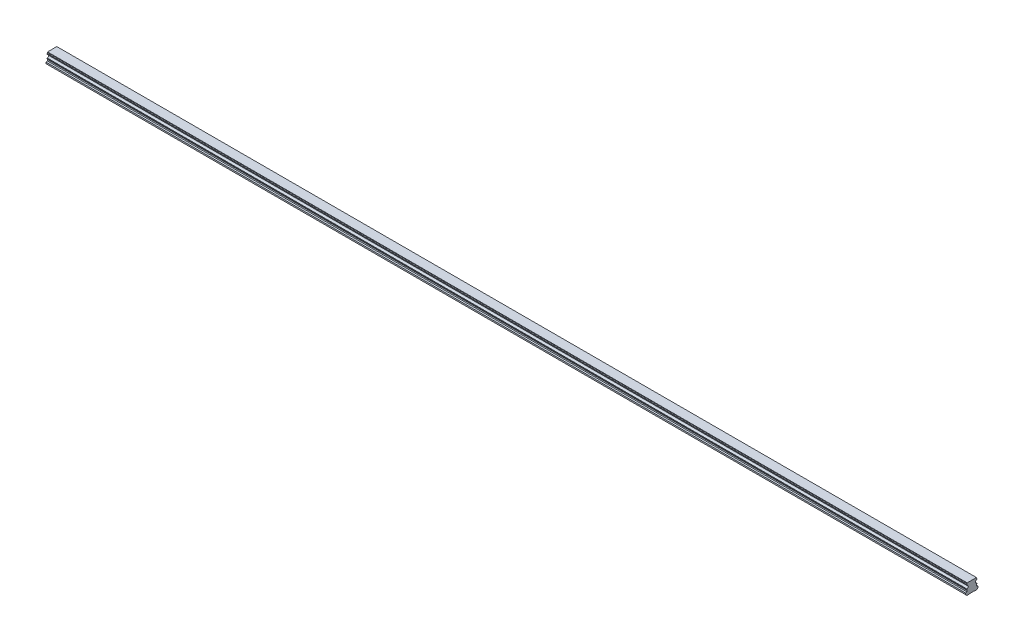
ISO-10303-21;
HEADER;
FILE_DESCRIPTION(('STEP AP214'),'2;1');
FILE_NAME('part.step','',(''),(''),'','','');
FILE_SCHEMA(('AUTOMOTIVE_DESIGN { 1 0 10303 214 1 1 1 1 }'));
ENDSEC;
DATA;
#1=APPLICATION_CONTEXT('core data for automotive mechanical design processes');
#2=APPLICATION_PROTOCOL_DEFINITION('international standard','automotive_design',2000,#1);
#3=PRODUCT_CONTEXT('',#1,'mechanical');
#4=PRODUCT('Part','Part','',(#3));
#5=PRODUCT_RELATED_PRODUCT_CATEGORY('part','',(#4));
#6=PRODUCT_DEFINITION_FORMATION('','',#4);
#7=PRODUCT_DEFINITION_CONTEXT('part definition',#1,'design');
#8=PRODUCT_DEFINITION('design','',#6,#7);
#9=PRODUCT_DEFINITION_SHAPE('','',#8);
#10=(LENGTH_UNIT() NAMED_UNIT(*) SI_UNIT(.MILLI.,.METRE.));
#11=(NAMED_UNIT(*) PLANE_ANGLE_UNIT() SI_UNIT($,.RADIAN.));
#12=(NAMED_UNIT(*) SI_UNIT($,.STERADIAN.) SOLID_ANGLE_UNIT());
#13=UNCERTAINTY_MEASURE_WITH_UNIT(LENGTH_MEASURE(1.E-05),#10,'distance_accuracy_value','');
#14=(GEOMETRIC_REPRESENTATION_CONTEXT(3) GLOBAL_UNCERTAINTY_ASSIGNED_CONTEXT((#13)) GLOBAL_UNIT_ASSIGNED_CONTEXT((#10,
#11,#12)) REPRESENTATION_CONTEXT('',''));
#15=CARTESIAN_POINT('',(0.,0.,0.));
#16=DIRECTION('',(0.,0.,1.));
#17=DIRECTION('',(1.,0.,0.));
#18=AXIS2_PLACEMENT_3D('',#15,#16,#17);
#19=CARTESIAN_POINT('',(1830.,0.499999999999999,0.));
#20=DIRECTION('',(0.,-1.,0.));
#21=DIRECTION('',(0.,0.,-1.));
#22=AXIS2_PLACEMENT_3D('',#19,#20,#21);
#23=CONICAL_SURFACE('',#22,3.5,0.785398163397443);
#24=CARTESIAN_POINT('',(1830.,1.00000000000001,0.));
#25=DIRECTION('',(0.,1.,0.));
#26=DIRECTION('',(0.,0.,1.));
#27=AXIS2_PLACEMENT_3D('',#24,#25,#26);
#28=CIRCLE('',#27,3.);
#29=CARTESIAN_POINT('',(1830.,1.00000000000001,3.));
#30=VERTEX_POINT('',#29);
#31=EDGE_CURVE('E11',#30,#30,#28,.F.);
#32=ORIENTED_EDGE('',*,*,#31,.F.);
#33=EDGE_LOOP('',(#32));
#34=FACE_BOUND('',#33,.T.);
#35=CARTESIAN_POINT('',(1830.,0.499999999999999,0.));
#36=DIRECTION('',(0.,1.,0.));
#37=DIRECTION('',(0.,0.,1.));
#38=AXIS2_PLACEMENT_3D('',#35,#36,#37);
#39=CIRCLE('',#38,3.5);
#40=CARTESIAN_POINT('',(1830.,0.5,3.5));
#41=VERTEX_POINT('',#40);
#42=EDGE_CURVE('E771',#41,#41,#39,.T.);
#43=ORIENTED_EDGE('',*,*,#42,.F.);
#44=EDGE_LOOP('',(#43));
#45=FACE_BOUND('',#44,.T.);
#46=ADVANCED_FACE('F39',(#34,#45),#23,.F.);
#47=CARTESIAN_POINT('',(1830.,12.,0.));
#48=DIRECTION('',(0.,-1.,0.));
#49=DIRECTION('',(0.,0.,-1.));
#50=AXIS2_PLACEMENT_3D('',#47,#48,#49);
#51=CYLINDRICAL_SURFACE('',#50,3.);
#52=ORIENTED_EDGE('',*,*,#31,.T.);
#53=EDGE_LOOP('',(#52));
#54=FACE_BOUND('',#53,.T.);
#55=CARTESIAN_POINT('',(1830.,12.,0.));
#56=DIRECTION('',(0.,-1.,0.));
#57=DIRECTION('',(0.,0.,-1.));
#58=AXIS2_PLACEMENT_3D('',#55,#56,#57);
#59=CIRCLE('',#58,3.);
#60=CARTESIAN_POINT('',(1830.,12.,-3.));
#61=VERTEX_POINT('',#60);
#62=EDGE_CURVE('E49',#61,#61,#59,.T.);
#63=ORIENTED_EDGE('',*,*,#62,.F.);
#64=EDGE_LOOP('',(#63));
#65=FACE_BOUND('',#64,.T.);
#66=ADVANCED_FACE('F1106',(#54,#65),#51,.F.);
#67=CARTESIAN_POINT('',(1830.,12.,0.));
#68=DIRECTION('',(0.,-1.,0.));
#69=DIRECTION('',(0.,0.,-1.));
#70=AXIS2_PLACEMENT_3D('',#67,#68,#69);
#71=PLANE('',#70);
#72=CARTESIAN_POINT('',(1830.,12.,0.));
#73=DIRECTION('',(0.,-1.,0.));
#74=DIRECTION('',(0.,0.,-1.));
#75=AXIS2_PLACEMENT_3D('',#72,#73,#74);
#76=CIRCLE('',#75,2.5);
#77=CARTESIAN_POINT('',(1830.,12.,-2.5));
#78=VERTEX_POINT('',#77);
#79=EDGE_CURVE('E42',#78,#78,#76,.T.);
#80=ORIENTED_EDGE('',*,*,#79,.F.);
#81=EDGE_LOOP('',(#80));
#82=FACE_BOUND('',#81,.T.);
#83=ORIENTED_EDGE('',*,*,#62,.T.);
#84=EDGE_LOOP('',(#83));
#85=FACE_BOUND('',#84,.T.);
#86=ADVANCED_FACE('F1111',(#82,#85),#71,.T.);
#87=CARTESIAN_POINT('',(1770.,0.499999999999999,0.));
#88=DIRECTION('',(0.,-1.,0.));
#89=DIRECTION('',(0.,0.,-1.));
#90=AXIS2_PLACEMENT_3D('',#87,#88,#89);
#91=CONICAL_SURFACE('',#90,3.5,0.785398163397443);
#92=CARTESIAN_POINT('',(1770.,1.00000000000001,0.));
#93=DIRECTION('',(0.,1.,0.));
#94=DIRECTION('',(0.,0.,1.));
#95=AXIS2_PLACEMENT_3D('',#92,#93,#94);
#96=CIRCLE('',#95,3.);
#97=CARTESIAN_POINT('',(1770.,1.00000000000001,3.));
#98=VERTEX_POINT('',#97);
#99=EDGE_CURVE('E767',#98,#98,#96,.F.);
#100=ORIENTED_EDGE('',*,*,#99,.F.);
#101=EDGE_LOOP('',(#100));
#102=FACE_BOUND('',#101,.T.);
#103=CARTESIAN_POINT('',(1770.,0.499999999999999,0.));
#104=DIRECTION('',(0.,1.,0.));
#105=DIRECTION('',(0.,0.,1.));
#106=AXIS2_PLACEMENT_3D('',#103,#104,#105);
#107=CIRCLE('',#106,3.5);
#108=CARTESIAN_POINT('',(1770.,0.5,3.5));
#109=VERTEX_POINT('',#108);
#110=EDGE_CURVE('E759',#109,#109,#107,.T.);
#111=ORIENTED_EDGE('',*,*,#110,.F.);
#112=EDGE_LOOP('',(#111));
#113=FACE_BOUND('',#112,.T.);
#114=ADVANCED_FACE('F1522',(#102,#113),#91,.F.);
#115=CARTESIAN_POINT('',(1770.,12.,0.));
#116=DIRECTION('',(0.,-1.,0.));
#117=DIRECTION('',(0.,0.,-1.));
#118=AXIS2_PLACEMENT_3D('',#115,#116,#117);
#119=CYLINDRICAL_SURFACE('',#118,3.);
#120=ORIENTED_EDGE('',*,*,#99,.T.);
#121=EDGE_LOOP('',(#120));
#122=FACE_BOUND('',#121,.T.);
#123=CARTESIAN_POINT('',(1770.,12.,0.));
#124=DIRECTION('',(0.,-1.,0.));
#125=DIRECTION('',(0.,0.,-1.));
#126=AXIS2_PLACEMENT_3D('',#123,#124,#125);
#127=CIRCLE('',#126,3.);
#128=CARTESIAN_POINT('',(1770.,12.,-3.));
#129=VERTEX_POINT('',#128);
#130=EDGE_CURVE('E763',#129,#129,#127,.T.);
#131=ORIENTED_EDGE('',*,*,#130,.F.);
#132=EDGE_LOOP('',(#131));
#133=FACE_BOUND('',#132,.T.);
#134=ADVANCED_FACE('F1518',(#122,#133),#119,.F.);
#135=CARTESIAN_POINT('',(1770.,12.,0.));
#136=DIRECTION('',(0.,-1.,0.));
#137=DIRECTION('',(0.,0.,-1.));
#138=AXIS2_PLACEMENT_3D('',#135,#136,#137);
#139=PLANE('',#138);
#140=CARTESIAN_POINT('',(1770.,12.,0.));
#141=DIRECTION('',(0.,-1.,0.));
#142=DIRECTION('',(0.,0.,-1.));
#143=AXIS2_PLACEMENT_3D('',#140,#141,#142);
#144=CIRCLE('',#143,2.5);
#145=CARTESIAN_POINT('',(1770.,12.,-2.5));
#146=VERTEX_POINT('',#145);
#147=EDGE_CURVE('E890',#146,#146,#144,.T.);
#148=ORIENTED_EDGE('',*,*,#147,.F.);
#149=EDGE_LOOP('',(#148));
#150=FACE_BOUND('',#149,.T.);
#151=ORIENTED_EDGE('',*,*,#130,.T.);
#152=EDGE_LOOP('',(#151));
#153=FACE_BOUND('',#152,.T.);
#154=ADVANCED_FACE('F1514',(#150,#153),#139,.T.);
#155=CARTESIAN_POINT('',(1710.,0.499999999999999,0.));
#156=DIRECTION('',(0.,-1.,0.));
#157=DIRECTION('',(0.,0.,-1.));
#158=AXIS2_PLACEMENT_3D('',#155,#156,#157);
#159=CONICAL_SURFACE('',#158,3.5,0.785398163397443);
#160=CARTESIAN_POINT('',(1710.,1.00000000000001,0.));
#161=DIRECTION('',(0.,1.,0.));
#162=DIRECTION('',(0.,0.,1.));
#163=AXIS2_PLACEMENT_3D('',#160,#161,#162);
#164=CIRCLE('',#163,3.);
#165=CARTESIAN_POINT('',(1710.,1.00000000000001,3.));
#166=VERTEX_POINT('',#165);
#167=EDGE_CURVE('E755',#166,#166,#164,.F.);
#168=ORIENTED_EDGE('',*,*,#167,.F.);
#169=EDGE_LOOP('',(#168));
#170=FACE_BOUND('',#169,.T.);
#171=CARTESIAN_POINT('',(1710.,0.499999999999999,0.));
#172=DIRECTION('',(0.,1.,0.));
#173=DIRECTION('',(0.,0.,1.));
#174=AXIS2_PLACEMENT_3D('',#171,#172,#173);
#175=CIRCLE('',#174,3.5);
#176=CARTESIAN_POINT('',(1710.,0.5,3.5));
#177=VERTEX_POINT('',#176);
#178=EDGE_CURVE('E747',#177,#177,#175,.T.);
#179=ORIENTED_EDGE('',*,*,#178,.F.);
#180=EDGE_LOOP('',(#179));
#181=FACE_BOUND('',#180,.T.);
#182=ADVANCED_FACE('F1510',(#170,#181),#159,.F.);
#183=CARTESIAN_POINT('',(1710.,12.,0.));
#184=DIRECTION('',(0.,-1.,0.));
#185=DIRECTION('',(0.,0.,-1.));
#186=AXIS2_PLACEMENT_3D('',#183,#184,#185);
#187=CYLINDRICAL_SURFACE('',#186,3.);
#188=ORIENTED_EDGE('',*,*,#167,.T.);
#189=EDGE_LOOP('',(#188));
#190=FACE_BOUND('',#189,.T.);
#191=CARTESIAN_POINT('',(1710.,12.,0.));
#192=DIRECTION('',(0.,-1.,0.));
#193=DIRECTION('',(0.,0.,-1.));
#194=AXIS2_PLACEMENT_3D('',#191,#192,#193);
#195=CIRCLE('',#194,3.);
#196=CARTESIAN_POINT('',(1710.,12.,-3.));
#197=VERTEX_POINT('',#196);
#198=EDGE_CURVE('E751',#197,#197,#195,.T.);
#199=ORIENTED_EDGE('',*,*,#198,.F.);
#200=EDGE_LOOP('',(#199));
#201=FACE_BOUND('',#200,.T.);
#202=ADVANCED_FACE('F1506',(#190,#201),#187,.F.);
#203=CARTESIAN_POINT('',(1710.,12.,0.));
#204=DIRECTION('',(0.,-1.,0.));
#205=DIRECTION('',(0.,0.,-1.));
#206=AXIS2_PLACEMENT_3D('',#203,#204,#205);
#207=PLANE('',#206);
#208=CARTESIAN_POINT('',(1710.,12.,0.));
#209=DIRECTION('',(0.,-1.,0.));
#210=DIRECTION('',(0.,0.,-1.));
#211=AXIS2_PLACEMENT_3D('',#208,#209,#210);
#212=CIRCLE('',#211,2.5);
#213=CARTESIAN_POINT('',(1710.,12.,-2.5));
#214=VERTEX_POINT('',#213);
#215=EDGE_CURVE('E887',#214,#214,#212,.T.);
#216=ORIENTED_EDGE('',*,*,#215,.F.);
#217=EDGE_LOOP('',(#216));
#218=FACE_BOUND('',#217,.T.);
#219=ORIENTED_EDGE('',*,*,#198,.T.);
#220=EDGE_LOOP('',(#219));
#221=FACE_BOUND('',#220,.T.);
#222=ADVANCED_FACE('F1502',(#218,#221),#207,.T.);
#223=CARTESIAN_POINT('',(1650.,0.499999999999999,0.));
#224=DIRECTION('',(0.,-1.,0.));
#225=DIRECTION('',(0.,0.,-1.));
#226=AXIS2_PLACEMENT_3D('',#223,#224,#225);
#227=CONICAL_SURFACE('',#226,3.5,0.785398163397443);
#228=CARTESIAN_POINT('',(1650.,1.00000000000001,0.));
#229=DIRECTION('',(0.,1.,0.));
#230=DIRECTION('',(0.,0.,1.));
#231=AXIS2_PLACEMENT_3D('',#228,#229,#230);
#232=CIRCLE('',#231,3.);
#233=CARTESIAN_POINT('',(1650.,1.00000000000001,3.));
#234=VERTEX_POINT('',#233);
#235=EDGE_CURVE('E743',#234,#234,#232,.F.);
#236=ORIENTED_EDGE('',*,*,#235,.F.);
#237=EDGE_LOOP('',(#236));
#238=FACE_BOUND('',#237,.T.);
#239=CARTESIAN_POINT('',(1650.,0.499999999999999,0.));
#240=DIRECTION('',(0.,1.,0.));
#241=DIRECTION('',(0.,0.,1.));
#242=AXIS2_PLACEMENT_3D('',#239,#240,#241);
#243=CIRCLE('',#242,3.5);
#244=CARTESIAN_POINT('',(1650.,0.5,3.5));
#245=VERTEX_POINT('',#244);
#246=EDGE_CURVE('E735',#245,#245,#243,.T.);
#247=ORIENTED_EDGE('',*,*,#246,.F.);
#248=EDGE_LOOP('',(#247));
#249=FACE_BOUND('',#248,.T.);
#250=ADVANCED_FACE('F1498',(#238,#249),#227,.F.);
#251=CARTESIAN_POINT('',(1650.,12.,0.));
#252=DIRECTION('',(0.,-1.,0.));
#253=DIRECTION('',(0.,0.,-1.));
#254=AXIS2_PLACEMENT_3D('',#251,#252,#253);
#255=CYLINDRICAL_SURFACE('',#254,3.);
#256=ORIENTED_EDGE('',*,*,#235,.T.);
#257=EDGE_LOOP('',(#256));
#258=FACE_BOUND('',#257,.T.);
#259=CARTESIAN_POINT('',(1650.,12.,0.));
#260=DIRECTION('',(0.,-1.,0.));
#261=DIRECTION('',(0.,0.,-1.));
#262=AXIS2_PLACEMENT_3D('',#259,#260,#261);
#263=CIRCLE('',#262,3.);
#264=CARTESIAN_POINT('',(1650.,12.,-3.));
#265=VERTEX_POINT('',#264);
#266=EDGE_CURVE('E739',#265,#265,#263,.T.);
#267=ORIENTED_EDGE('',*,*,#266,.F.);
#268=EDGE_LOOP('',(#267));
#269=FACE_BOUND('',#268,.T.);
#270=ADVANCED_FACE('F1494',(#258,#269),#255,.F.);
#271=CARTESIAN_POINT('',(1650.,12.,0.));
#272=DIRECTION('',(0.,-1.,0.));
#273=DIRECTION('',(0.,0.,-1.));
#274=AXIS2_PLACEMENT_3D('',#271,#272,#273);
#275=PLANE('',#274);
#276=CARTESIAN_POINT('',(1650.,12.,0.));
#277=DIRECTION('',(0.,-1.,0.));
#278=DIRECTION('',(0.,0.,-1.));
#279=AXIS2_PLACEMENT_3D('',#276,#277,#278);
#280=CIRCLE('',#279,2.5);
#281=CARTESIAN_POINT('',(1650.,12.,-2.5));
#282=VERTEX_POINT('',#281);
#283=EDGE_CURVE('E883',#282,#282,#280,.T.);
#284=ORIENTED_EDGE('',*,*,#283,.F.);
#285=EDGE_LOOP('',(#284));
#286=FACE_BOUND('',#285,.T.);
#287=ORIENTED_EDGE('',*,*,#266,.T.);
#288=EDGE_LOOP('',(#287));
#289=FACE_BOUND('',#288,.T.);
#290=ADVANCED_FACE('F1490',(#286,#289),#275,.T.);
#291=CARTESIAN_POINT('',(1590.,0.499999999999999,0.));
#292=DIRECTION('',(0.,-1.,0.));
#293=DIRECTION('',(0.,0.,-1.));
#294=AXIS2_PLACEMENT_3D('',#291,#292,#293);
#295=CONICAL_SURFACE('',#294,3.5,0.785398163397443);
#296=CARTESIAN_POINT('',(1590.,1.00000000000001,0.));
#297=DIRECTION('',(0.,1.,0.));
#298=DIRECTION('',(0.,0.,1.));
#299=AXIS2_PLACEMENT_3D('',#296,#297,#298);
#300=CIRCLE('',#299,3.);
#301=CARTESIAN_POINT('',(1590.,1.00000000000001,3.));
#302=VERTEX_POINT('',#301);
#303=EDGE_CURVE('E731',#302,#302,#300,.F.);
#304=ORIENTED_EDGE('',*,*,#303,.F.);
#305=EDGE_LOOP('',(#304));
#306=FACE_BOUND('',#305,.T.);
#307=CARTESIAN_POINT('',(1590.,0.499999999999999,0.));
#308=DIRECTION('',(0.,1.,0.));
#309=DIRECTION('',(0.,0.,1.));
#310=AXIS2_PLACEMENT_3D('',#307,#308,#309);
#311=CIRCLE('',#310,3.5);
#312=CARTESIAN_POINT('',(1590.,0.5,3.5));
#313=VERTEX_POINT('',#312);
#314=EDGE_CURVE('E723',#313,#313,#311,.T.);
#315=ORIENTED_EDGE('',*,*,#314,.F.);
#316=EDGE_LOOP('',(#315));
#317=FACE_BOUND('',#316,.T.);
#318=ADVANCED_FACE('F1486',(#306,#317),#295,.F.);
#319=CARTESIAN_POINT('',(1590.,12.,0.));
#320=DIRECTION('',(0.,-1.,0.));
#321=DIRECTION('',(0.,0.,-1.));
#322=AXIS2_PLACEMENT_3D('',#319,#320,#321);
#323=CYLINDRICAL_SURFACE('',#322,3.);
#324=ORIENTED_EDGE('',*,*,#303,.T.);
#325=EDGE_LOOP('',(#324));
#326=FACE_BOUND('',#325,.T.);
#327=CARTESIAN_POINT('',(1590.,12.,0.));
#328=DIRECTION('',(0.,-1.,0.));
#329=DIRECTION('',(0.,0.,-1.));
#330=AXIS2_PLACEMENT_3D('',#327,#328,#329);
#331=CIRCLE('',#330,3.);
#332=CARTESIAN_POINT('',(1590.,12.,-3.));
#333=VERTEX_POINT('',#332);
#334=EDGE_CURVE('E727',#333,#333,#331,.T.);
#335=ORIENTED_EDGE('',*,*,#334,.F.);
#336=EDGE_LOOP('',(#335));
#337=FACE_BOUND('',#336,.T.);
#338=ADVANCED_FACE('F1482',(#326,#337),#323,.F.);
#339=CARTESIAN_POINT('',(1590.,12.,0.));
#340=DIRECTION('',(0.,-1.,0.));
#341=DIRECTION('',(0.,0.,-1.));
#342=AXIS2_PLACEMENT_3D('',#339,#340,#341);
#343=PLANE('',#342);
#344=CARTESIAN_POINT('',(1590.,12.,0.));
#345=DIRECTION('',(0.,-1.,0.));
#346=DIRECTION('',(0.,0.,-1.));
#347=AXIS2_PLACEMENT_3D('',#344,#345,#346);
#348=CIRCLE('',#347,2.5);
#349=CARTESIAN_POINT('',(1590.,12.,-2.5));
#350=VERTEX_POINT('',#349);
#351=EDGE_CURVE('E879',#350,#350,#348,.T.);
#352=ORIENTED_EDGE('',*,*,#351,.F.);
#353=EDGE_LOOP('',(#352));
#354=FACE_BOUND('',#353,.T.);
#355=ORIENTED_EDGE('',*,*,#334,.T.);
#356=EDGE_LOOP('',(#355));
#357=FACE_BOUND('',#356,.T.);
#358=ADVANCED_FACE('F1478',(#354,#357),#343,.T.);
#359=CARTESIAN_POINT('',(1530.,0.499999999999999,0.));
#360=DIRECTION('',(0.,-1.,0.));
#361=DIRECTION('',(0.,0.,-1.));
#362=AXIS2_PLACEMENT_3D('',#359,#360,#361);
#363=CONICAL_SURFACE('',#362,3.5,0.785398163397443);
#364=CARTESIAN_POINT('',(1530.,1.00000000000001,0.));
#365=DIRECTION('',(0.,1.,0.));
#366=DIRECTION('',(0.,0.,1.));
#367=AXIS2_PLACEMENT_3D('',#364,#365,#366);
#368=CIRCLE('',#367,3.);
#369=CARTESIAN_POINT('',(1530.,1.00000000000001,3.));
#370=VERTEX_POINT('',#369);
#371=EDGE_CURVE('E719',#370,#370,#368,.F.);
#372=ORIENTED_EDGE('',*,*,#371,.F.);
#373=EDGE_LOOP('',(#372));
#374=FACE_BOUND('',#373,.T.);
#375=CARTESIAN_POINT('',(1530.,0.499999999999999,0.));
#376=DIRECTION('',(0.,1.,0.));
#377=DIRECTION('',(0.,0.,1.));
#378=AXIS2_PLACEMENT_3D('',#375,#376,#377);
#379=CIRCLE('',#378,3.5);
#380=CARTESIAN_POINT('',(1530.,0.5,3.5));
#381=VERTEX_POINT('',#380);
#382=EDGE_CURVE('E711',#381,#381,#379,.T.);
#383=ORIENTED_EDGE('',*,*,#382,.F.);
#384=EDGE_LOOP('',(#383));
#385=FACE_BOUND('',#384,.T.);
#386=ADVANCED_FACE('F1474',(#374,#385),#363,.F.);
#387=CARTESIAN_POINT('',(1530.,12.,0.));
#388=DIRECTION('',(0.,-1.,0.));
#389=DIRECTION('',(0.,0.,-1.));
#390=AXIS2_PLACEMENT_3D('',#387,#388,#389);
#391=CYLINDRICAL_SURFACE('',#390,3.);
#392=ORIENTED_EDGE('',*,*,#371,.T.);
#393=EDGE_LOOP('',(#392));
#394=FACE_BOUND('',#393,.T.);
#395=CARTESIAN_POINT('',(1530.,12.,0.));
#396=DIRECTION('',(0.,-1.,0.));
#397=DIRECTION('',(0.,0.,-1.));
#398=AXIS2_PLACEMENT_3D('',#395,#396,#397);
#399=CIRCLE('',#398,3.);
#400=CARTESIAN_POINT('',(1530.,12.,-3.));
#401=VERTEX_POINT('',#400);
#402=EDGE_CURVE('E715',#401,#401,#399,.T.);
#403=ORIENTED_EDGE('',*,*,#402,.F.);
#404=EDGE_LOOP('',(#403));
#405=FACE_BOUND('',#404,.T.);
#406=ADVANCED_FACE('F1470',(#394,#405),#391,.F.);
#407=CARTESIAN_POINT('',(1530.,12.,0.));
#408=DIRECTION('',(0.,-1.,0.));
#409=DIRECTION('',(0.,0.,-1.));
#410=AXIS2_PLACEMENT_3D('',#407,#408,#409);
#411=PLANE('',#410);
#412=CARTESIAN_POINT('',(1530.,12.,0.));
#413=DIRECTION('',(0.,-1.,0.));
#414=DIRECTION('',(0.,0.,-1.));
#415=AXIS2_PLACEMENT_3D('',#412,#413,#414);
#416=CIRCLE('',#415,2.5);
#417=CARTESIAN_POINT('',(1530.,12.,-2.5));
#418=VERTEX_POINT('',#417);
#419=EDGE_CURVE('E875',#418,#418,#416,.T.);
#420=ORIENTED_EDGE('',*,*,#419,.F.);
#421=EDGE_LOOP('',(#420));
#422=FACE_BOUND('',#421,.T.);
#423=ORIENTED_EDGE('',*,*,#402,.T.);
#424=EDGE_LOOP('',(#423));
#425=FACE_BOUND('',#424,.T.);
#426=ADVANCED_FACE('F1466',(#422,#425),#411,.T.);
#427=CARTESIAN_POINT('',(1470.,0.499999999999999,0.));
#428=DIRECTION('',(0.,-1.,0.));
#429=DIRECTION('',(0.,0.,-1.));
#430=AXIS2_PLACEMENT_3D('',#427,#428,#429);
#431=CONICAL_SURFACE('',#430,3.5,0.785398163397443);
#432=CARTESIAN_POINT('',(1470.,1.00000000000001,0.));
#433=DIRECTION('',(0.,1.,0.));
#434=DIRECTION('',(0.,0.,1.));
#435=AXIS2_PLACEMENT_3D('',#432,#433,#434);
#436=CIRCLE('',#435,3.);
#437=CARTESIAN_POINT('',(1470.,1.00000000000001,3.));
#438=VERTEX_POINT('',#437);
#439=EDGE_CURVE('E707',#438,#438,#436,.F.);
#440=ORIENTED_EDGE('',*,*,#439,.F.);
#441=EDGE_LOOP('',(#440));
#442=FACE_BOUND('',#441,.T.);
#443=CARTESIAN_POINT('',(1470.,0.499999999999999,0.));
#444=DIRECTION('',(0.,1.,0.));
#445=DIRECTION('',(0.,0.,1.));
#446=AXIS2_PLACEMENT_3D('',#443,#444,#445);
#447=CIRCLE('',#446,3.5);
#448=CARTESIAN_POINT('',(1470.,0.5,3.5));
#449=VERTEX_POINT('',#448);
#450=EDGE_CURVE('E699',#449,#449,#447,.T.);
#451=ORIENTED_EDGE('',*,*,#450,.F.);
#452=EDGE_LOOP('',(#451));
#453=FACE_BOUND('',#452,.T.);
#454=ADVANCED_FACE('F1462',(#442,#453),#431,.F.);
#455=CARTESIAN_POINT('',(1470.,12.,0.));
#456=DIRECTION('',(0.,-1.,0.));
#457=DIRECTION('',(0.,0.,-1.));
#458=AXIS2_PLACEMENT_3D('',#455,#456,#457);
#459=CYLINDRICAL_SURFACE('',#458,3.);
#460=ORIENTED_EDGE('',*,*,#439,.T.);
#461=EDGE_LOOP('',(#460));
#462=FACE_BOUND('',#461,.T.);
#463=CARTESIAN_POINT('',(1470.,12.,0.));
#464=DIRECTION('',(0.,-1.,0.));
#465=DIRECTION('',(0.,0.,-1.));
#466=AXIS2_PLACEMENT_3D('',#463,#464,#465);
#467=CIRCLE('',#466,3.);
#468=CARTESIAN_POINT('',(1470.,12.,-3.));
#469=VERTEX_POINT('',#468);
#470=EDGE_CURVE('E703',#469,#469,#467,.T.);
#471=ORIENTED_EDGE('',*,*,#470,.F.);
#472=EDGE_LOOP('',(#471));
#473=FACE_BOUND('',#472,.T.);
#474=ADVANCED_FACE('F1458',(#462,#473),#459,.F.);
#475=CARTESIAN_POINT('',(1470.,12.,0.));
#476=DIRECTION('',(0.,-1.,0.));
#477=DIRECTION('',(0.,0.,-1.));
#478=AXIS2_PLACEMENT_3D('',#475,#476,#477);
#479=PLANE('',#478);
#480=CARTESIAN_POINT('',(1470.,12.,0.));
#481=DIRECTION('',(0.,-1.,0.));
#482=DIRECTION('',(0.,0.,-1.));
#483=AXIS2_PLACEMENT_3D('',#480,#481,#482);
#484=CIRCLE('',#483,2.5);
#485=CARTESIAN_POINT('',(1470.,12.,-2.5));
#486=VERTEX_POINT('',#485);
#487=EDGE_CURVE('E871',#486,#486,#484,.T.);
#488=ORIENTED_EDGE('',*,*,#487,.F.);
#489=EDGE_LOOP('',(#488));
#490=FACE_BOUND('',#489,.T.);
#491=ORIENTED_EDGE('',*,*,#470,.T.);
#492=EDGE_LOOP('',(#491));
#493=FACE_BOUND('',#492,.T.);
#494=ADVANCED_FACE('F1454',(#490,#493),#479,.T.);
#495=CARTESIAN_POINT('',(1410.,0.499999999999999,0.));
#496=DIRECTION('',(0.,-1.,0.));
#497=DIRECTION('',(0.,0.,-1.));
#498=AXIS2_PLACEMENT_3D('',#495,#496,#497);
#499=CONICAL_SURFACE('',#498,3.5,0.785398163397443);
#500=CARTESIAN_POINT('',(1410.,1.00000000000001,0.));
#501=DIRECTION('',(0.,1.,0.));
#502=DIRECTION('',(0.,0.,1.));
#503=AXIS2_PLACEMENT_3D('',#500,#501,#502);
#504=CIRCLE('',#503,3.);
#505=CARTESIAN_POINT('',(1410.,1.00000000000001,3.));
#506=VERTEX_POINT('',#505);
#507=EDGE_CURVE('E695',#506,#506,#504,.F.);
#508=ORIENTED_EDGE('',*,*,#507,.F.);
#509=EDGE_LOOP('',(#508));
#510=FACE_BOUND('',#509,.T.);
#511=CARTESIAN_POINT('',(1410.,0.499999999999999,0.));
#512=DIRECTION('',(0.,1.,0.));
#513=DIRECTION('',(0.,0.,1.));
#514=AXIS2_PLACEMENT_3D('',#511,#512,#513);
#515=CIRCLE('',#514,3.5);
#516=CARTESIAN_POINT('',(1410.,0.5,3.5));
#517=VERTEX_POINT('',#516);
#518=EDGE_CURVE('E687',#517,#517,#515,.T.);
#519=ORIENTED_EDGE('',*,*,#518,.F.);
#520=EDGE_LOOP('',(#519));
#521=FACE_BOUND('',#520,.T.);
#522=ADVANCED_FACE('F1450',(#510,#521),#499,.F.);
#523=CARTESIAN_POINT('',(1410.,12.,0.));
#524=DIRECTION('',(0.,-1.,0.));
#525=DIRECTION('',(0.,0.,-1.));
#526=AXIS2_PLACEMENT_3D('',#523,#524,#525);
#527=CYLINDRICAL_SURFACE('',#526,3.);
#528=ORIENTED_EDGE('',*,*,#507,.T.);
#529=EDGE_LOOP('',(#528));
#530=FACE_BOUND('',#529,.T.);
#531=CARTESIAN_POINT('',(1410.,12.,0.));
#532=DIRECTION('',(0.,-1.,0.));
#533=DIRECTION('',(0.,0.,-1.));
#534=AXIS2_PLACEMENT_3D('',#531,#532,#533);
#535=CIRCLE('',#534,3.);
#536=CARTESIAN_POINT('',(1410.,12.,-3.));
#537=VERTEX_POINT('',#536);
#538=EDGE_CURVE('E691',#537,#537,#535,.T.);
#539=ORIENTED_EDGE('',*,*,#538,.F.);
#540=EDGE_LOOP('',(#539));
#541=FACE_BOUND('',#540,.T.);
#542=ADVANCED_FACE('F1446',(#530,#541),#527,.F.);
#543=CARTESIAN_POINT('',(1410.,12.,0.));
#544=DIRECTION('',(0.,-1.,0.));
#545=DIRECTION('',(0.,0.,-1.));
#546=AXIS2_PLACEMENT_3D('',#543,#544,#545);
#547=PLANE('',#546);
#548=CARTESIAN_POINT('',(1410.,12.,0.));
#549=DIRECTION('',(0.,-1.,0.));
#550=DIRECTION('',(0.,0.,-1.));
#551=AXIS2_PLACEMENT_3D('',#548,#549,#550);
#552=CIRCLE('',#551,2.5);
#553=CARTESIAN_POINT('',(1410.,12.,-2.5));
#554=VERTEX_POINT('',#553);
#555=EDGE_CURVE('E867',#554,#554,#552,.T.);
#556=ORIENTED_EDGE('',*,*,#555,.F.);
#557=EDGE_LOOP('',(#556));
#558=FACE_BOUND('',#557,.T.);
#559=ORIENTED_EDGE('',*,*,#538,.T.);
#560=EDGE_LOOP('',(#559));
#561=FACE_BOUND('',#560,.T.);
#562=ADVANCED_FACE('F1442',(#558,#561),#547,.T.);
#563=CARTESIAN_POINT('',(1350.,0.499999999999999,0.));
#564=DIRECTION('',(0.,-1.,0.));
#565=DIRECTION('',(0.,0.,-1.));
#566=AXIS2_PLACEMENT_3D('',#563,#564,#565);
#567=CONICAL_SURFACE('',#566,3.5,0.785398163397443);
#568=CARTESIAN_POINT('',(1350.,1.00000000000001,0.));
#569=DIRECTION('',(0.,1.,0.));
#570=DIRECTION('',(0.,0.,1.));
#571=AXIS2_PLACEMENT_3D('',#568,#569,#570);
#572=CIRCLE('',#571,3.);
#573=CARTESIAN_POINT('',(1350.,1.00000000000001,3.));
#574=VERTEX_POINT('',#573);
#575=EDGE_CURVE('E683',#574,#574,#572,.F.);
#576=ORIENTED_EDGE('',*,*,#575,.F.);
#577=EDGE_LOOP('',(#576));
#578=FACE_BOUND('',#577,.T.);
#579=CARTESIAN_POINT('',(1350.,0.499999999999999,0.));
#580=DIRECTION('',(0.,1.,0.));
#581=DIRECTION('',(0.,0.,1.));
#582=AXIS2_PLACEMENT_3D('',#579,#580,#581);
#583=CIRCLE('',#582,3.5);
#584=CARTESIAN_POINT('',(1350.,0.5,3.5));
#585=VERTEX_POINT('',#584);
#586=EDGE_CURVE('E675',#585,#585,#583,.T.);
#587=ORIENTED_EDGE('',*,*,#586,.F.);
#588=EDGE_LOOP('',(#587));
#589=FACE_BOUND('',#588,.T.);
#590=ADVANCED_FACE('F1438',(#578,#589),#567,.F.);
#591=CARTESIAN_POINT('',(1350.,12.,0.));
#592=DIRECTION('',(0.,-1.,0.));
#593=DIRECTION('',(0.,0.,-1.));
#594=AXIS2_PLACEMENT_3D('',#591,#592,#593);
#595=CYLINDRICAL_SURFACE('',#594,3.);
#596=ORIENTED_EDGE('',*,*,#575,.T.);
#597=EDGE_LOOP('',(#596));
#598=FACE_BOUND('',#597,.T.);
#599=CARTESIAN_POINT('',(1350.,12.,0.));
#600=DIRECTION('',(0.,-1.,0.));
#601=DIRECTION('',(0.,0.,-1.));
#602=AXIS2_PLACEMENT_3D('',#599,#600,#601);
#603=CIRCLE('',#602,3.);
#604=CARTESIAN_POINT('',(1350.,12.,-3.));
#605=VERTEX_POINT('',#604);
#606=EDGE_CURVE('E679',#605,#605,#603,.T.);
#607=ORIENTED_EDGE('',*,*,#606,.F.);
#608=EDGE_LOOP('',(#607));
#609=FACE_BOUND('',#608,.T.);
#610=ADVANCED_FACE('F1434',(#598,#609),#595,.F.);
#611=CARTESIAN_POINT('',(1350.,12.,0.));
#612=DIRECTION('',(0.,-1.,0.));
#613=DIRECTION('',(0.,0.,-1.));
#614=AXIS2_PLACEMENT_3D('',#611,#612,#613);
#615=PLANE('',#614);
#616=CARTESIAN_POINT('',(1350.,12.,0.));
#617=DIRECTION('',(0.,-1.,0.));
#618=DIRECTION('',(0.,0.,-1.));
#619=AXIS2_PLACEMENT_3D('',#616,#617,#618);
#620=CIRCLE('',#619,2.5);
#621=CARTESIAN_POINT('',(1350.,12.,-2.5));
#622=VERTEX_POINT('',#621);
#623=EDGE_CURVE('E863',#622,#622,#620,.T.);
#624=ORIENTED_EDGE('',*,*,#623,.F.);
#625=EDGE_LOOP('',(#624));
#626=FACE_BOUND('',#625,.T.);
#627=ORIENTED_EDGE('',*,*,#606,.T.);
#628=EDGE_LOOP('',(#627));
#629=FACE_BOUND('',#628,.T.);
#630=ADVANCED_FACE('F1430',(#626,#629),#615,.T.);
#631=CARTESIAN_POINT('',(1290.,0.499999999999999,0.));
#632=DIRECTION('',(0.,-1.,0.));
#633=DIRECTION('',(0.,0.,-1.));
#634=AXIS2_PLACEMENT_3D('',#631,#632,#633);
#635=CONICAL_SURFACE('',#634,3.5,0.785398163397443);
#636=CARTESIAN_POINT('',(1290.,1.00000000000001,0.));
#637=DIRECTION('',(0.,1.,0.));
#638=DIRECTION('',(0.,0.,1.));
#639=AXIS2_PLACEMENT_3D('',#636,#637,#638);
#640=CIRCLE('',#639,3.);
#641=CARTESIAN_POINT('',(1290.,1.00000000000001,3.));
#642=VERTEX_POINT('',#641);
#643=EDGE_CURVE('E671',#642,#642,#640,.F.);
#644=ORIENTED_EDGE('',*,*,#643,.F.);
#645=EDGE_LOOP('',(#644));
#646=FACE_BOUND('',#645,.T.);
#647=CARTESIAN_POINT('',(1290.,0.499999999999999,0.));
#648=DIRECTION('',(0.,1.,0.));
#649=DIRECTION('',(0.,0.,1.));
#650=AXIS2_PLACEMENT_3D('',#647,#648,#649);
#651=CIRCLE('',#650,3.5);
#652=CARTESIAN_POINT('',(1290.,0.5,3.5));
#653=VERTEX_POINT('',#652);
#654=EDGE_CURVE('E663',#653,#653,#651,.T.);
#655=ORIENTED_EDGE('',*,*,#654,.F.);
#656=EDGE_LOOP('',(#655));
#657=FACE_BOUND('',#656,.T.);
#658=ADVANCED_FACE('F1426',(#646,#657),#635,.F.);
#659=CARTESIAN_POINT('',(1290.,12.,0.));
#660=DIRECTION('',(0.,-1.,0.));
#661=DIRECTION('',(0.,0.,-1.));
#662=AXIS2_PLACEMENT_3D('',#659,#660,#661);
#663=CYLINDRICAL_SURFACE('',#662,3.);
#664=ORIENTED_EDGE('',*,*,#643,.T.);
#665=EDGE_LOOP('',(#664));
#666=FACE_BOUND('',#665,.T.);
#667=CARTESIAN_POINT('',(1290.,12.,0.));
#668=DIRECTION('',(0.,-1.,0.));
#669=DIRECTION('',(0.,0.,-1.));
#670=AXIS2_PLACEMENT_3D('',#667,#668,#669);
#671=CIRCLE('',#670,3.);
#672=CARTESIAN_POINT('',(1290.,12.,-3.));
#673=VERTEX_POINT('',#672);
#674=EDGE_CURVE('E667',#673,#673,#671,.T.);
#675=ORIENTED_EDGE('',*,*,#674,.F.);
#676=EDGE_LOOP('',(#675));
#677=FACE_BOUND('',#676,.T.);
#678=ADVANCED_FACE('F1422',(#666,#677),#663,.F.);
#679=CARTESIAN_POINT('',(1290.,12.,0.));
#680=DIRECTION('',(0.,-1.,0.));
#681=DIRECTION('',(0.,0.,-1.));
#682=AXIS2_PLACEMENT_3D('',#679,#680,#681);
#683=PLANE('',#682);
#684=CARTESIAN_POINT('',(1290.,12.,0.));
#685=DIRECTION('',(0.,-1.,0.));
#686=DIRECTION('',(0.,0.,-1.));
#687=AXIS2_PLACEMENT_3D('',#684,#685,#686);
#688=CIRCLE('',#687,2.5);
#689=CARTESIAN_POINT('',(1290.,12.,-2.5));
#690=VERTEX_POINT('',#689);
#691=EDGE_CURVE('E859',#690,#690,#688,.T.);
#692=ORIENTED_EDGE('',*,*,#691,.F.);
#693=EDGE_LOOP('',(#692));
#694=FACE_BOUND('',#693,.T.);
#695=ORIENTED_EDGE('',*,*,#674,.T.);
#696=EDGE_LOOP('',(#695));
#697=FACE_BOUND('',#696,.T.);
#698=ADVANCED_FACE('F1418',(#694,#697),#683,.T.);
#699=CARTESIAN_POINT('',(1230.,0.499999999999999,0.));
#700=DIRECTION('',(0.,-1.,0.));
#701=DIRECTION('',(0.,0.,-1.));
#702=AXIS2_PLACEMENT_3D('',#699,#700,#701);
#703=CONICAL_SURFACE('',#702,3.5,0.785398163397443);
#704=CARTESIAN_POINT('',(1230.,1.00000000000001,0.));
#705=DIRECTION('',(0.,1.,0.));
#706=DIRECTION('',(0.,0.,1.));
#707=AXIS2_PLACEMENT_3D('',#704,#705,#706);
#708=CIRCLE('',#707,3.);
#709=CARTESIAN_POINT('',(1230.,1.00000000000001,3.));
#710=VERTEX_POINT('',#709);
#711=EDGE_CURVE('E659',#710,#710,#708,.F.);
#712=ORIENTED_EDGE('',*,*,#711,.F.);
#713=EDGE_LOOP('',(#712));
#714=FACE_BOUND('',#713,.T.);
#715=CARTESIAN_POINT('',(1230.,0.499999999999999,0.));
#716=DIRECTION('',(0.,1.,0.));
#717=DIRECTION('',(0.,0.,1.));
#718=AXIS2_PLACEMENT_3D('',#715,#716,#717);
#719=CIRCLE('',#718,3.5);
#720=CARTESIAN_POINT('',(1230.,0.5,3.5));
#721=VERTEX_POINT('',#720);
#722=EDGE_CURVE('E651',#721,#721,#719,.T.);
#723=ORIENTED_EDGE('',*,*,#722,.F.);
#724=EDGE_LOOP('',(#723));
#725=FACE_BOUND('',#724,.T.);
#726=ADVANCED_FACE('F1414',(#714,#725),#703,.F.);
#727=CARTESIAN_POINT('',(1230.,12.,0.));
#728=DIRECTION('',(0.,-1.,0.));
#729=DIRECTION('',(0.,0.,-1.));
#730=AXIS2_PLACEMENT_3D('',#727,#728,#729);
#731=CYLINDRICAL_SURFACE('',#730,3.);
#732=ORIENTED_EDGE('',*,*,#711,.T.);
#733=EDGE_LOOP('',(#732));
#734=FACE_BOUND('',#733,.T.);
#735=CARTESIAN_POINT('',(1230.,12.,0.));
#736=DIRECTION('',(0.,-1.,0.));
#737=DIRECTION('',(0.,0.,-1.));
#738=AXIS2_PLACEMENT_3D('',#735,#736,#737);
#739=CIRCLE('',#738,3.);
#740=CARTESIAN_POINT('',(1230.,12.,-3.));
#741=VERTEX_POINT('',#740);
#742=EDGE_CURVE('E655',#741,#741,#739,.T.);
#743=ORIENTED_EDGE('',*,*,#742,.F.);
#744=EDGE_LOOP('',(#743));
#745=FACE_BOUND('',#744,.T.);
#746=ADVANCED_FACE('F1410',(#734,#745),#731,.F.);
#747=CARTESIAN_POINT('',(1230.,12.,0.));
#748=DIRECTION('',(0.,-1.,0.));
#749=DIRECTION('',(0.,0.,-1.));
#750=AXIS2_PLACEMENT_3D('',#747,#748,#749);
#751=PLANE('',#750);
#752=CARTESIAN_POINT('',(1230.,12.,0.));
#753=DIRECTION('',(0.,-1.,0.));
#754=DIRECTION('',(0.,0.,-1.));
#755=AXIS2_PLACEMENT_3D('',#752,#753,#754);
#756=CIRCLE('',#755,2.5);
#757=CARTESIAN_POINT('',(1230.,12.,-2.5));
#758=VERTEX_POINT('',#757);
#759=EDGE_CURVE('E855',#758,#758,#756,.T.);
#760=ORIENTED_EDGE('',*,*,#759,.F.);
#761=EDGE_LOOP('',(#760));
#762=FACE_BOUND('',#761,.T.);
#763=ORIENTED_EDGE('',*,*,#742,.T.);
#764=EDGE_LOOP('',(#763));
#765=FACE_BOUND('',#764,.T.);
#766=ADVANCED_FACE('F1406',(#762,#765),#751,.T.);
#767=CARTESIAN_POINT('',(1170.,0.499999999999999,0.));
#768=DIRECTION('',(0.,-1.,0.));
#769=DIRECTION('',(0.,0.,-1.));
#770=AXIS2_PLACEMENT_3D('',#767,#768,#769);
#771=CONICAL_SURFACE('',#770,3.5,0.785398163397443);
#772=CARTESIAN_POINT('',(1170.,1.00000000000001,0.));
#773=DIRECTION('',(0.,1.,0.));
#774=DIRECTION('',(0.,0.,1.));
#775=AXIS2_PLACEMENT_3D('',#772,#773,#774);
#776=CIRCLE('',#775,3.);
#777=CARTESIAN_POINT('',(1170.,1.00000000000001,3.));
#778=VERTEX_POINT('',#777);
#779=EDGE_CURVE('E647',#778,#778,#776,.F.);
#780=ORIENTED_EDGE('',*,*,#779,.F.);
#781=EDGE_LOOP('',(#780));
#782=FACE_BOUND('',#781,.T.);
#783=CARTESIAN_POINT('',(1170.,0.499999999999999,0.));
#784=DIRECTION('',(0.,1.,0.));
#785=DIRECTION('',(0.,0.,1.));
#786=AXIS2_PLACEMENT_3D('',#783,#784,#785);
#787=CIRCLE('',#786,3.5);
#788=CARTESIAN_POINT('',(1170.,0.5,3.5));
#789=VERTEX_POINT('',#788);
#790=EDGE_CURVE('E639',#789,#789,#787,.T.);
#791=ORIENTED_EDGE('',*,*,#790,.F.);
#792=EDGE_LOOP('',(#791));
#793=FACE_BOUND('',#792,.T.);
#794=ADVANCED_FACE('F1402',(#782,#793),#771,.F.);
#795=CARTESIAN_POINT('',(1170.,12.,0.));
#796=DIRECTION('',(0.,-1.,0.));
#797=DIRECTION('',(0.,0.,-1.));
#798=AXIS2_PLACEMENT_3D('',#795,#796,#797);
#799=CYLINDRICAL_SURFACE('',#798,3.);
#800=ORIENTED_EDGE('',*,*,#779,.T.);
#801=EDGE_LOOP('',(#800));
#802=FACE_BOUND('',#801,.T.);
#803=CARTESIAN_POINT('',(1170.,12.,0.));
#804=DIRECTION('',(0.,-1.,0.));
#805=DIRECTION('',(0.,0.,-1.));
#806=AXIS2_PLACEMENT_3D('',#803,#804,#805);
#807=CIRCLE('',#806,3.);
#808=CARTESIAN_POINT('',(1170.,12.,-3.));
#809=VERTEX_POINT('',#808);
#810=EDGE_CURVE('E643',#809,#809,#807,.T.);
#811=ORIENTED_EDGE('',*,*,#810,.F.);
#812=EDGE_LOOP('',(#811));
#813=FACE_BOUND('',#812,.T.);
#814=ADVANCED_FACE('F1398',(#802,#813),#799,.F.);
#815=CARTESIAN_POINT('',(1170.,12.,0.));
#816=DIRECTION('',(0.,-1.,0.));
#817=DIRECTION('',(0.,0.,-1.));
#818=AXIS2_PLACEMENT_3D('',#815,#816,#817);
#819=PLANE('',#818);
#820=CARTESIAN_POINT('',(1170.,12.,0.));
#821=DIRECTION('',(0.,-1.,0.));
#822=DIRECTION('',(0.,0.,-1.));
#823=AXIS2_PLACEMENT_3D('',#820,#821,#822);
#824=CIRCLE('',#823,2.5);
#825=CARTESIAN_POINT('',(1170.,12.,-2.5));
#826=VERTEX_POINT('',#825);
#827=EDGE_CURVE('E851',#826,#826,#824,.T.);
#828=ORIENTED_EDGE('',*,*,#827,.F.);
#829=EDGE_LOOP('',(#828));
#830=FACE_BOUND('',#829,.T.);
#831=ORIENTED_EDGE('',*,*,#810,.T.);
#832=EDGE_LOOP('',(#831));
#833=FACE_BOUND('',#832,.T.);
#834=ADVANCED_FACE('F1394',(#830,#833),#819,.T.);
#835=CARTESIAN_POINT('',(1110.,0.499999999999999,0.));
#836=DIRECTION('',(0.,-1.,0.));
#837=DIRECTION('',(0.,0.,-1.));
#838=AXIS2_PLACEMENT_3D('',#835,#836,#837);
#839=CONICAL_SURFACE('',#838,3.5,0.785398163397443);
#840=CARTESIAN_POINT('',(1110.,1.00000000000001,0.));
#841=DIRECTION('',(0.,1.,0.));
#842=DIRECTION('',(0.,0.,1.));
#843=AXIS2_PLACEMENT_3D('',#840,#841,#842);
#844=CIRCLE('',#843,3.);
#845=CARTESIAN_POINT('',(1110.,1.00000000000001,3.));
#846=VERTEX_POINT('',#845);
#847=EDGE_CURVE('E635',#846,#846,#844,.F.);
#848=ORIENTED_EDGE('',*,*,#847,.F.);
#849=EDGE_LOOP('',(#848));
#850=FACE_BOUND('',#849,.T.);
#851=CARTESIAN_POINT('',(1110.,0.499999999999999,0.));
#852=DIRECTION('',(0.,1.,0.));
#853=DIRECTION('',(0.,0.,1.));
#854=AXIS2_PLACEMENT_3D('',#851,#852,#853);
#855=CIRCLE('',#854,3.5);
#856=CARTESIAN_POINT('',(1110.,0.5,3.5));
#857=VERTEX_POINT('',#856);
#858=EDGE_CURVE('E627',#857,#857,#855,.T.);
#859=ORIENTED_EDGE('',*,*,#858,.F.);
#860=EDGE_LOOP('',(#859));
#861=FACE_BOUND('',#860,.T.);
#862=ADVANCED_FACE('F1390',(#850,#861),#839,.F.);
#863=CARTESIAN_POINT('',(1110.,12.,0.));
#864=DIRECTION('',(0.,-1.,0.));
#865=DIRECTION('',(0.,0.,-1.));
#866=AXIS2_PLACEMENT_3D('',#863,#864,#865);
#867=CYLINDRICAL_SURFACE('',#866,3.);
#868=ORIENTED_EDGE('',*,*,#847,.T.);
#869=EDGE_LOOP('',(#868));
#870=FACE_BOUND('',#869,.T.);
#871=CARTESIAN_POINT('',(1110.,12.,0.));
#872=DIRECTION('',(0.,-1.,0.));
#873=DIRECTION('',(0.,0.,-1.));
#874=AXIS2_PLACEMENT_3D('',#871,#872,#873);
#875=CIRCLE('',#874,3.);
#876=CARTESIAN_POINT('',(1110.,12.,-3.));
#877=VERTEX_POINT('',#876);
#878=EDGE_CURVE('E631',#877,#877,#875,.T.);
#879=ORIENTED_EDGE('',*,*,#878,.F.);
#880=EDGE_LOOP('',(#879));
#881=FACE_BOUND('',#880,.T.);
#882=ADVANCED_FACE('F1386',(#870,#881),#867,.F.);
#883=CARTESIAN_POINT('',(1110.,12.,0.));
#884=DIRECTION('',(0.,-1.,0.));
#885=DIRECTION('',(0.,0.,-1.));
#886=AXIS2_PLACEMENT_3D('',#883,#884,#885);
#887=PLANE('',#886);
#888=CARTESIAN_POINT('',(1110.,12.,0.));
#889=DIRECTION('',(0.,-1.,0.));
#890=DIRECTION('',(0.,0.,-1.));
#891=AXIS2_PLACEMENT_3D('',#888,#889,#890);
#892=CIRCLE('',#891,2.5);
#893=CARTESIAN_POINT('',(1110.,12.,-2.5));
#894=VERTEX_POINT('',#893);
#895=EDGE_CURVE('E847',#894,#894,#892,.T.);
#896=ORIENTED_EDGE('',*,*,#895,.F.);
#897=EDGE_LOOP('',(#896));
#898=FACE_BOUND('',#897,.T.);
#899=ORIENTED_EDGE('',*,*,#878,.T.);
#900=EDGE_LOOP('',(#899));
#901=FACE_BOUND('',#900,.T.);
#902=ADVANCED_FACE('F1382',(#898,#901),#887,.T.);
#903=CARTESIAN_POINT('',(1050.,0.499999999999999,0.));
#904=DIRECTION('',(0.,-1.,0.));
#905=DIRECTION('',(0.,0.,-1.));
#906=AXIS2_PLACEMENT_3D('',#903,#904,#905);
#907=CONICAL_SURFACE('',#906,3.5,0.785398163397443);
#908=CARTESIAN_POINT('',(1050.,1.00000000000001,0.));
#909=DIRECTION('',(0.,1.,0.));
#910=DIRECTION('',(0.,0.,1.));
#911=AXIS2_PLACEMENT_3D('',#908,#909,#910);
#912=CIRCLE('',#911,3.);
#913=CARTESIAN_POINT('',(1050.,1.00000000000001,3.));
#914=VERTEX_POINT('',#913);
#915=EDGE_CURVE('E623',#914,#914,#912,.F.);
#916=ORIENTED_EDGE('',*,*,#915,.F.);
#917=EDGE_LOOP('',(#916));
#918=FACE_BOUND('',#917,.T.);
#919=CARTESIAN_POINT('',(1050.,0.499999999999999,0.));
#920=DIRECTION('',(0.,1.,0.));
#921=DIRECTION('',(0.,0.,1.));
#922=AXIS2_PLACEMENT_3D('',#919,#920,#921);
#923=CIRCLE('',#922,3.5);
#924=CARTESIAN_POINT('',(1050.,0.5,3.5));
#925=VERTEX_POINT('',#924);
#926=EDGE_CURVE('E615',#925,#925,#923,.T.);
#927=ORIENTED_EDGE('',*,*,#926,.F.);
#928=EDGE_LOOP('',(#927));
#929=FACE_BOUND('',#928,.T.);
#930=ADVANCED_FACE('F1378',(#918,#929),#907,.F.);
#931=CARTESIAN_POINT('',(1050.,12.,0.));
#932=DIRECTION('',(0.,-1.,0.));
#933=DIRECTION('',(0.,0.,-1.));
#934=AXIS2_PLACEMENT_3D('',#931,#932,#933);
#935=CYLINDRICAL_SURFACE('',#934,3.);
#936=ORIENTED_EDGE('',*,*,#915,.T.);
#937=EDGE_LOOP('',(#936));
#938=FACE_BOUND('',#937,.T.);
#939=CARTESIAN_POINT('',(1050.,12.,0.));
#940=DIRECTION('',(0.,-1.,0.));
#941=DIRECTION('',(0.,0.,-1.));
#942=AXIS2_PLACEMENT_3D('',#939,#940,#941);
#943=CIRCLE('',#942,3.);
#944=CARTESIAN_POINT('',(1050.,12.,-3.));
#945=VERTEX_POINT('',#944);
#946=EDGE_CURVE('E619',#945,#945,#943,.T.);
#947=ORIENTED_EDGE('',*,*,#946,.F.);
#948=EDGE_LOOP('',(#947));
#949=FACE_BOUND('',#948,.T.);
#950=ADVANCED_FACE('F1374',(#938,#949),#935,.F.);
#951=CARTESIAN_POINT('',(1050.,12.,0.));
#952=DIRECTION('',(0.,-1.,0.));
#953=DIRECTION('',(0.,0.,-1.));
#954=AXIS2_PLACEMENT_3D('',#951,#952,#953);
#955=PLANE('',#954);
#956=CARTESIAN_POINT('',(1050.,12.,0.));
#957=DIRECTION('',(0.,-1.,0.));
#958=DIRECTION('',(0.,0.,-1.));
#959=AXIS2_PLACEMENT_3D('',#956,#957,#958);
#960=CIRCLE('',#959,2.5);
#961=CARTESIAN_POINT('',(1050.,12.,-2.5));
#962=VERTEX_POINT('',#961);
#963=EDGE_CURVE('E843',#962,#962,#960,.T.);
#964=ORIENTED_EDGE('',*,*,#963,.F.);
#965=EDGE_LOOP('',(#964));
#966=FACE_BOUND('',#965,.T.);
#967=ORIENTED_EDGE('',*,*,#946,.T.);
#968=EDGE_LOOP('',(#967));
#969=FACE_BOUND('',#968,.T.);
#970=ADVANCED_FACE('F1370',(#966,#969),#955,.T.);
#971=CARTESIAN_POINT('',(990.,0.499999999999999,0.));
#972=DIRECTION('',(0.,-1.,0.));
#973=DIRECTION('',(0.,0.,-1.));
#974=AXIS2_PLACEMENT_3D('',#971,#972,#973);
#975=CONICAL_SURFACE('',#974,3.5,0.785398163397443);
#976=CARTESIAN_POINT('',(990.,1.00000000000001,0.));
#977=DIRECTION('',(0.,1.,0.));
#978=DIRECTION('',(0.,0.,1.));
#979=AXIS2_PLACEMENT_3D('',#976,#977,#978);
#980=CIRCLE('',#979,3.);
#981=CARTESIAN_POINT('',(990.,1.00000000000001,3.));
#982=VERTEX_POINT('',#981);
#983=EDGE_CURVE('E611',#982,#982,#980,.F.);
#984=ORIENTED_EDGE('',*,*,#983,.F.);
#985=EDGE_LOOP('',(#984));
#986=FACE_BOUND('',#985,.T.);
#987=CARTESIAN_POINT('',(990.,0.499999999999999,0.));
#988=DIRECTION('',(0.,1.,0.));
#989=DIRECTION('',(0.,0.,1.));
#990=AXIS2_PLACEMENT_3D('',#987,#988,#989);
#991=CIRCLE('',#990,3.5);
#992=CARTESIAN_POINT('',(990.,0.5,3.5));
#993=VERTEX_POINT('',#992);
#994=EDGE_CURVE('E603',#993,#993,#991,.T.);
#995=ORIENTED_EDGE('',*,*,#994,.F.);
#996=EDGE_LOOP('',(#995));
#997=FACE_BOUND('',#996,.T.);
#998=ADVANCED_FACE('F1366',(#986,#997),#975,.F.);
#999=CARTESIAN_POINT('',(990.,12.,0.));
#1000=DIRECTION('',(0.,-1.,0.));
#1001=DIRECTION('',(0.,0.,-1.));
#1002=AXIS2_PLACEMENT_3D('',#999,#1000,#1001);
#1003=CYLINDRICAL_SURFACE('',#1002,3.);
#1004=ORIENTED_EDGE('',*,*,#983,.T.);
#1005=EDGE_LOOP('',(#1004));
#1006=FACE_BOUND('',#1005,.T.);
#1007=CARTESIAN_POINT('',(990.,12.,0.));
#1008=DIRECTION('',(0.,-1.,0.));
#1009=DIRECTION('',(0.,0.,-1.));
#1010=AXIS2_PLACEMENT_3D('',#1007,#1008,#1009);
#1011=CIRCLE('',#1010,3.);
#1012=CARTESIAN_POINT('',(990.,12.,-3.));
#1013=VERTEX_POINT('',#1012);
#1014=EDGE_CURVE('E607',#1013,#1013,#1011,.T.);
#1015=ORIENTED_EDGE('',*,*,#1014,.F.);
#1016=EDGE_LOOP('',(#1015));
#1017=FACE_BOUND('',#1016,.T.);
#1018=ADVANCED_FACE('F1362',(#1006,#1017),#1003,.F.);
#1019=CARTESIAN_POINT('',(990.,12.,0.));
#1020=DIRECTION('',(0.,-1.,0.));
#1021=DIRECTION('',(0.,0.,-1.));
#1022=AXIS2_PLACEMENT_3D('',#1019,#1020,#1021);
#1023=PLANE('',#1022);
#1024=CARTESIAN_POINT('',(990.,12.,0.));
#1025=DIRECTION('',(0.,-1.,0.));
#1026=DIRECTION('',(0.,0.,-1.));
#1027=AXIS2_PLACEMENT_3D('',#1024,#1025,#1026);
#1028=CIRCLE('',#1027,2.5);
#1029=CARTESIAN_POINT('',(990.,12.,-2.5));
#1030=VERTEX_POINT('',#1029);
#1031=EDGE_CURVE('E839',#1030,#1030,#1028,.T.);
#1032=ORIENTED_EDGE('',*,*,#1031,.F.);
#1033=EDGE_LOOP('',(#1032));
#1034=FACE_BOUND('',#1033,.T.);
#1035=ORIENTED_EDGE('',*,*,#1014,.T.);
#1036=EDGE_LOOP('',(#1035));
#1037=FACE_BOUND('',#1036,.T.);
#1038=ADVANCED_FACE('F1358',(#1034,#1037),#1023,.T.);
#1039=CARTESIAN_POINT('',(930.,0.499999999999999,0.));
#1040=DIRECTION('',(0.,-1.,0.));
#1041=DIRECTION('',(0.,0.,-1.));
#1042=AXIS2_PLACEMENT_3D('',#1039,#1040,#1041);
#1043=CONICAL_SURFACE('',#1042,3.5,0.785398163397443);
#1044=CARTESIAN_POINT('',(930.,1.00000000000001,0.));
#1045=DIRECTION('',(0.,1.,0.));
#1046=DIRECTION('',(0.,0.,1.));
#1047=AXIS2_PLACEMENT_3D('',#1044,#1045,#1046);
#1048=CIRCLE('',#1047,3.);
#1049=CARTESIAN_POINT('',(930.,1.00000000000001,3.));
#1050=VERTEX_POINT('',#1049);
#1051=EDGE_CURVE('E599',#1050,#1050,#1048,.F.);
#1052=ORIENTED_EDGE('',*,*,#1051,.F.);
#1053=EDGE_LOOP('',(#1052));
#1054=FACE_BOUND('',#1053,.T.);
#1055=CARTESIAN_POINT('',(930.,0.499999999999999,0.));
#1056=DIRECTION('',(0.,1.,0.));
#1057=DIRECTION('',(0.,0.,1.));
#1058=AXIS2_PLACEMENT_3D('',#1055,#1056,#1057);
#1059=CIRCLE('',#1058,3.5);
#1060=CARTESIAN_POINT('',(930.,0.5,3.5));
#1061=VERTEX_POINT('',#1060);
#1062=EDGE_CURVE('E591',#1061,#1061,#1059,.T.);
#1063=ORIENTED_EDGE('',*,*,#1062,.F.);
#1064=EDGE_LOOP('',(#1063));
#1065=FACE_BOUND('',#1064,.T.);
#1066=ADVANCED_FACE('F1354',(#1054,#1065),#1043,.F.);
#1067=CARTESIAN_POINT('',(930.,12.,0.));
#1068=DIRECTION('',(0.,-1.,0.));
#1069=DIRECTION('',(0.,0.,-1.));
#1070=AXIS2_PLACEMENT_3D('',#1067,#1068,#1069);
#1071=CYLINDRICAL_SURFACE('',#1070,3.);
#1072=ORIENTED_EDGE('',*,*,#1051,.T.);
#1073=EDGE_LOOP('',(#1072));
#1074=FACE_BOUND('',#1073,.T.);
#1075=CARTESIAN_POINT('',(930.,12.,0.));
#1076=DIRECTION('',(0.,-1.,0.));
#1077=DIRECTION('',(0.,0.,-1.));
#1078=AXIS2_PLACEMENT_3D('',#1075,#1076,#1077);
#1079=CIRCLE('',#1078,3.);
#1080=CARTESIAN_POINT('',(930.,12.,-3.));
#1081=VERTEX_POINT('',#1080);
#1082=EDGE_CURVE('E595',#1081,#1081,#1079,.T.);
#1083=ORIENTED_EDGE('',*,*,#1082,.F.);
#1084=EDGE_LOOP('',(#1083));
#1085=FACE_BOUND('',#1084,.T.);
#1086=ADVANCED_FACE('F1350',(#1074,#1085),#1071,.F.);
#1087=CARTESIAN_POINT('',(930.,12.,0.));
#1088=DIRECTION('',(0.,-1.,0.));
#1089=DIRECTION('',(0.,0.,-1.));
#1090=AXIS2_PLACEMENT_3D('',#1087,#1088,#1089);
#1091=PLANE('',#1090);
#1092=CARTESIAN_POINT('',(930.,12.,0.));
#1093=DIRECTION('',(0.,-1.,0.));
#1094=DIRECTION('',(0.,0.,-1.));
#1095=AXIS2_PLACEMENT_3D('',#1092,#1093,#1094);
#1096=CIRCLE('',#1095,2.5);
#1097=CARTESIAN_POINT('',(930.,12.,-2.5));
#1098=VERTEX_POINT('',#1097);
#1099=EDGE_CURVE('E835',#1098,#1098,#1096,.T.);
#1100=ORIENTED_EDGE('',*,*,#1099,.F.);
#1101=EDGE_LOOP('',(#1100));
#1102=FACE_BOUND('',#1101,.T.);
#1103=ORIENTED_EDGE('',*,*,#1082,.T.);
#1104=EDGE_LOOP('',(#1103));
#1105=FACE_BOUND('',#1104,.T.);
#1106=ADVANCED_FACE('F1346',(#1102,#1105),#1091,.T.);
#1107=CARTESIAN_POINT('',(870.,0.499999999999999,0.));
#1108=DIRECTION('',(0.,-1.,0.));
#1109=DIRECTION('',(0.,0.,-1.));
#1110=AXIS2_PLACEMENT_3D('',#1107,#1108,#1109);
#1111=CONICAL_SURFACE('',#1110,3.5,0.785398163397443);
#1112=CARTESIAN_POINT('',(870.,1.00000000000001,0.));
#1113=DIRECTION('',(0.,1.,0.));
#1114=DIRECTION('',(0.,0.,1.));
#1115=AXIS2_PLACEMENT_3D('',#1112,#1113,#1114);
#1116=CIRCLE('',#1115,3.);
#1117=CARTESIAN_POINT('',(870.,1.00000000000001,3.));
#1118=VERTEX_POINT('',#1117);
#1119=EDGE_CURVE('E587',#1118,#1118,#1116,.F.);
#1120=ORIENTED_EDGE('',*,*,#1119,.F.);
#1121=EDGE_LOOP('',(#1120));
#1122=FACE_BOUND('',#1121,.T.);
#1123=CARTESIAN_POINT('',(870.,0.499999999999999,0.));
#1124=DIRECTION('',(0.,1.,0.));
#1125=DIRECTION('',(0.,0.,1.));
#1126=AXIS2_PLACEMENT_3D('',#1123,#1124,#1125);
#1127=CIRCLE('',#1126,3.5);
#1128=CARTESIAN_POINT('',(870.,0.5,3.5));
#1129=VERTEX_POINT('',#1128);
#1130=EDGE_CURVE('E579',#1129,#1129,#1127,.T.);
#1131=ORIENTED_EDGE('',*,*,#1130,.F.);
#1132=EDGE_LOOP('',(#1131));
#1133=FACE_BOUND('',#1132,.T.);
#1134=ADVANCED_FACE('F1342',(#1122,#1133),#1111,.F.);
#1135=CARTESIAN_POINT('',(870.,12.,0.));
#1136=DIRECTION('',(0.,-1.,0.));
#1137=DIRECTION('',(0.,0.,-1.));
#1138=AXIS2_PLACEMENT_3D('',#1135,#1136,#1137);
#1139=CYLINDRICAL_SURFACE('',#1138,3.);
#1140=ORIENTED_EDGE('',*,*,#1119,.T.);
#1141=EDGE_LOOP('',(#1140));
#1142=FACE_BOUND('',#1141,.T.);
#1143=CARTESIAN_POINT('',(870.,12.,0.));
#1144=DIRECTION('',(0.,-1.,0.));
#1145=DIRECTION('',(0.,0.,-1.));
#1146=AXIS2_PLACEMENT_3D('',#1143,#1144,#1145);
#1147=CIRCLE('',#1146,3.);
#1148=CARTESIAN_POINT('',(870.,12.,-3.));
#1149=VERTEX_POINT('',#1148);
#1150=EDGE_CURVE('E583',#1149,#1149,#1147,.T.);
#1151=ORIENTED_EDGE('',*,*,#1150,.F.);
#1152=EDGE_LOOP('',(#1151));
#1153=FACE_BOUND('',#1152,.T.);
#1154=ADVANCED_FACE('F1338',(#1142,#1153),#1139,.F.);
#1155=CARTESIAN_POINT('',(870.,12.,0.));
#1156=DIRECTION('',(0.,-1.,0.));
#1157=DIRECTION('',(0.,0.,-1.));
#1158=AXIS2_PLACEMENT_3D('',#1155,#1156,#1157);
#1159=PLANE('',#1158);
#1160=CARTESIAN_POINT('',(870.,12.,0.));
#1161=DIRECTION('',(0.,-1.,0.));
#1162=DIRECTION('',(0.,0.,-1.));
#1163=AXIS2_PLACEMENT_3D('',#1160,#1161,#1162);
#1164=CIRCLE('',#1163,2.5);
#1165=CARTESIAN_POINT('',(870.,12.,-2.5));
#1166=VERTEX_POINT('',#1165);
#1167=EDGE_CURVE('E831',#1166,#1166,#1164,.T.);
#1168=ORIENTED_EDGE('',*,*,#1167,.F.);
#1169=EDGE_LOOP('',(#1168));
#1170=FACE_BOUND('',#1169,.T.);
#1171=ORIENTED_EDGE('',*,*,#1150,.T.);
#1172=EDGE_LOOP('',(#1171));
#1173=FACE_BOUND('',#1172,.T.);
#1174=ADVANCED_FACE('F1334',(#1170,#1173),#1159,.T.);
#1175=CARTESIAN_POINT('',(810.,0.499999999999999,0.));
#1176=DIRECTION('',(0.,-1.,0.));
#1177=DIRECTION('',(0.,0.,-1.));
#1178=AXIS2_PLACEMENT_3D('',#1175,#1176,#1177);
#1179=CONICAL_SURFACE('',#1178,3.5,0.785398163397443);
#1180=CARTESIAN_POINT('',(810.,1.00000000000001,0.));
#1181=DIRECTION('',(0.,1.,0.));
#1182=DIRECTION('',(0.,0.,1.));
#1183=AXIS2_PLACEMENT_3D('',#1180,#1181,#1182);
#1184=CIRCLE('',#1183,3.);
#1185=CARTESIAN_POINT('',(810.,1.00000000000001,3.));
#1186=VERTEX_POINT('',#1185);
#1187=EDGE_CURVE('E575',#1186,#1186,#1184,.F.);
#1188=ORIENTED_EDGE('',*,*,#1187,.F.);
#1189=EDGE_LOOP('',(#1188));
#1190=FACE_BOUND('',#1189,.T.);
#1191=CARTESIAN_POINT('',(810.,0.499999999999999,0.));
#1192=DIRECTION('',(0.,1.,0.));
#1193=DIRECTION('',(0.,0.,1.));
#1194=AXIS2_PLACEMENT_3D('',#1191,#1192,#1193);
#1195=CIRCLE('',#1194,3.5);
#1196=CARTESIAN_POINT('',(810.,0.5,3.5));
#1197=VERTEX_POINT('',#1196);
#1198=EDGE_CURVE('E567',#1197,#1197,#1195,.T.);
#1199=ORIENTED_EDGE('',*,*,#1198,.F.);
#1200=EDGE_LOOP('',(#1199));
#1201=FACE_BOUND('',#1200,.T.);
#1202=ADVANCED_FACE('F1330',(#1190,#1201),#1179,.F.);
#1203=CARTESIAN_POINT('',(810.,12.,0.));
#1204=DIRECTION('',(0.,-1.,0.));
#1205=DIRECTION('',(0.,0.,-1.));
#1206=AXIS2_PLACEMENT_3D('',#1203,#1204,#1205);
#1207=CYLINDRICAL_SURFACE('',#1206,3.);
#1208=ORIENTED_EDGE('',*,*,#1187,.T.);
#1209=EDGE_LOOP('',(#1208));
#1210=FACE_BOUND('',#1209,.T.);
#1211=CARTESIAN_POINT('',(810.,12.,0.));
#1212=DIRECTION('',(0.,-1.,0.));
#1213=DIRECTION('',(0.,0.,-1.));
#1214=AXIS2_PLACEMENT_3D('',#1211,#1212,#1213);
#1215=CIRCLE('',#1214,3.);
#1216=CARTESIAN_POINT('',(810.,12.,-3.));
#1217=VERTEX_POINT('',#1216);
#1218=EDGE_CURVE('E571',#1217,#1217,#1215,.T.);
#1219=ORIENTED_EDGE('',*,*,#1218,.F.);
#1220=EDGE_LOOP('',(#1219));
#1221=FACE_BOUND('',#1220,.T.);
#1222=ADVANCED_FACE('F1326',(#1210,#1221),#1207,.F.);
#1223=CARTESIAN_POINT('',(810.,12.,0.));
#1224=DIRECTION('',(0.,-1.,0.));
#1225=DIRECTION('',(0.,0.,-1.));
#1226=AXIS2_PLACEMENT_3D('',#1223,#1224,#1225);
#1227=PLANE('',#1226);
#1228=CARTESIAN_POINT('',(810.,12.,0.));
#1229=DIRECTION('',(0.,-1.,0.));
#1230=DIRECTION('',(0.,0.,-1.));
#1231=AXIS2_PLACEMENT_3D('',#1228,#1229,#1230);
#1232=CIRCLE('',#1231,2.5);
#1233=CARTESIAN_POINT('',(810.,12.,-2.5));
#1234=VERTEX_POINT('',#1233);
#1235=EDGE_CURVE('E827',#1234,#1234,#1232,.T.);
#1236=ORIENTED_EDGE('',*,*,#1235,.F.);
#1237=EDGE_LOOP('',(#1236));
#1238=FACE_BOUND('',#1237,.T.);
#1239=ORIENTED_EDGE('',*,*,#1218,.T.);
#1240=EDGE_LOOP('',(#1239));
#1241=FACE_BOUND('',#1240,.T.);
#1242=ADVANCED_FACE('F1322',(#1238,#1241),#1227,.T.);
#1243=CARTESIAN_POINT('',(750.,0.499999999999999,0.));
#1244=DIRECTION('',(0.,-1.,0.));
#1245=DIRECTION('',(0.,0.,-1.));
#1246=AXIS2_PLACEMENT_3D('',#1243,#1244,#1245);
#1247=CONICAL_SURFACE('',#1246,3.5,0.785398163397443);
#1248=CARTESIAN_POINT('',(750.,1.00000000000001,0.));
#1249=DIRECTION('',(0.,1.,0.));
#1250=DIRECTION('',(0.,0.,1.));
#1251=AXIS2_PLACEMENT_3D('',#1248,#1249,#1250);
#1252=CIRCLE('',#1251,3.);
#1253=CARTESIAN_POINT('',(750.,1.00000000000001,3.));
#1254=VERTEX_POINT('',#1253);
#1255=EDGE_CURVE('E563',#1254,#1254,#1252,.F.);
#1256=ORIENTED_EDGE('',*,*,#1255,.F.);
#1257=EDGE_LOOP('',(#1256));
#1258=FACE_BOUND('',#1257,.T.);
#1259=CARTESIAN_POINT('',(750.,0.499999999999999,0.));
#1260=DIRECTION('',(0.,1.,0.));
#1261=DIRECTION('',(0.,0.,1.));
#1262=AXIS2_PLACEMENT_3D('',#1259,#1260,#1261);
#1263=CIRCLE('',#1262,3.5);
#1264=CARTESIAN_POINT('',(750.,0.5,3.5));
#1265=VERTEX_POINT('',#1264);
#1266=EDGE_CURVE('E555',#1265,#1265,#1263,.T.);
#1267=ORIENTED_EDGE('',*,*,#1266,.F.);
#1268=EDGE_LOOP('',(#1267));
#1269=FACE_BOUND('',#1268,.T.);
#1270=ADVANCED_FACE('F1318',(#1258,#1269),#1247,.F.);
#1271=CARTESIAN_POINT('',(750.,12.,0.));
#1272=DIRECTION('',(0.,-1.,0.));
#1273=DIRECTION('',(0.,0.,-1.));
#1274=AXIS2_PLACEMENT_3D('',#1271,#1272,#1273);
#1275=CYLINDRICAL_SURFACE('',#1274,3.);
#1276=ORIENTED_EDGE('',*,*,#1255,.T.);
#1277=EDGE_LOOP('',(#1276));
#1278=FACE_BOUND('',#1277,.T.);
#1279=CARTESIAN_POINT('',(750.,12.,0.));
#1280=DIRECTION('',(0.,-1.,0.));
#1281=DIRECTION('',(0.,0.,-1.));
#1282=AXIS2_PLACEMENT_3D('',#1279,#1280,#1281);
#1283=CIRCLE('',#1282,3.);
#1284=CARTESIAN_POINT('',(750.,12.,-3.));
#1285=VERTEX_POINT('',#1284);
#1286=EDGE_CURVE('E559',#1285,#1285,#1283,.T.);
#1287=ORIENTED_EDGE('',*,*,#1286,.F.);
#1288=EDGE_LOOP('',(#1287));
#1289=FACE_BOUND('',#1288,.T.);
#1290=ADVANCED_FACE('F1314',(#1278,#1289),#1275,.F.);
#1291=CARTESIAN_POINT('',(750.,12.,0.));
#1292=DIRECTION('',(0.,-1.,0.));
#1293=DIRECTION('',(0.,0.,-1.));
#1294=AXIS2_PLACEMENT_3D('',#1291,#1292,#1293);
#1295=PLANE('',#1294);
#1296=CARTESIAN_POINT('',(750.,12.,0.));
#1297=DIRECTION('',(0.,-1.,0.));
#1298=DIRECTION('',(0.,0.,-1.));
#1299=AXIS2_PLACEMENT_3D('',#1296,#1297,#1298);
#1300=CIRCLE('',#1299,2.5);
#1301=CARTESIAN_POINT('',(750.,12.,-2.5));
#1302=VERTEX_POINT('',#1301);
#1303=EDGE_CURVE('E823',#1302,#1302,#1300,.T.);
#1304=ORIENTED_EDGE('',*,*,#1303,.F.);
#1305=EDGE_LOOP('',(#1304));
#1306=FACE_BOUND('',#1305,.T.);
#1307=ORIENTED_EDGE('',*,*,#1286,.T.);
#1308=EDGE_LOOP('',(#1307));
#1309=FACE_BOUND('',#1308,.T.);
#1310=ADVANCED_FACE('F1310',(#1306,#1309),#1295,.T.);
#1311=CARTESIAN_POINT('',(690.,0.499999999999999,0.));
#1312=DIRECTION('',(0.,-1.,0.));
#1313=DIRECTION('',(0.,0.,-1.));
#1314=AXIS2_PLACEMENT_3D('',#1311,#1312,#1313);
#1315=CONICAL_SURFACE('',#1314,3.5,0.785398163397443);
#1316=CARTESIAN_POINT('',(690.,1.00000000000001,0.));
#1317=DIRECTION('',(0.,1.,0.));
#1318=DIRECTION('',(0.,0.,1.));
#1319=AXIS2_PLACEMENT_3D('',#1316,#1317,#1318);
#1320=CIRCLE('',#1319,3.);
#1321=CARTESIAN_POINT('',(690.,1.00000000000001,3.));
#1322=VERTEX_POINT('',#1321);
#1323=EDGE_CURVE('E551',#1322,#1322,#1320,.F.);
#1324=ORIENTED_EDGE('',*,*,#1323,.F.);
#1325=EDGE_LOOP('',(#1324));
#1326=FACE_BOUND('',#1325,.T.);
#1327=CARTESIAN_POINT('',(690.,0.499999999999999,0.));
#1328=DIRECTION('',(0.,1.,0.));
#1329=DIRECTION('',(0.,0.,1.));
#1330=AXIS2_PLACEMENT_3D('',#1327,#1328,#1329);
#1331=CIRCLE('',#1330,3.5);
#1332=CARTESIAN_POINT('',(690.,0.5,3.5));
#1333=VERTEX_POINT('',#1332);
#1334=EDGE_CURVE('E543',#1333,#1333,#1331,.T.);
#1335=ORIENTED_EDGE('',*,*,#1334,.F.);
#1336=EDGE_LOOP('',(#1335));
#1337=FACE_BOUND('',#1336,.T.);
#1338=ADVANCED_FACE('F1306',(#1326,#1337),#1315,.F.);
#1339=CARTESIAN_POINT('',(690.,12.,0.));
#1340=DIRECTION('',(0.,-1.,0.));
#1341=DIRECTION('',(0.,0.,-1.));
#1342=AXIS2_PLACEMENT_3D('',#1339,#1340,#1341);
#1343=CYLINDRICAL_SURFACE('',#1342,3.);
#1344=ORIENTED_EDGE('',*,*,#1323,.T.);
#1345=EDGE_LOOP('',(#1344));
#1346=FACE_BOUND('',#1345,.T.);
#1347=CARTESIAN_POINT('',(690.,12.,0.));
#1348=DIRECTION('',(0.,-1.,0.));
#1349=DIRECTION('',(0.,0.,-1.));
#1350=AXIS2_PLACEMENT_3D('',#1347,#1348,#1349);
#1351=CIRCLE('',#1350,3.);
#1352=CARTESIAN_POINT('',(690.,12.,-3.));
#1353=VERTEX_POINT('',#1352);
#1354=EDGE_CURVE('E547',#1353,#1353,#1351,.T.);
#1355=ORIENTED_EDGE('',*,*,#1354,.F.);
#1356=EDGE_LOOP('',(#1355));
#1357=FACE_BOUND('',#1356,.T.);
#1358=ADVANCED_FACE('F1302',(#1346,#1357),#1343,.F.);
#1359=CARTESIAN_POINT('',(690.,12.,0.));
#1360=DIRECTION('',(0.,-1.,0.));
#1361=DIRECTION('',(0.,0.,-1.));
#1362=AXIS2_PLACEMENT_3D('',#1359,#1360,#1361);
#1363=PLANE('',#1362);
#1364=CARTESIAN_POINT('',(690.,12.,0.));
#1365=DIRECTION('',(0.,-1.,0.));
#1366=DIRECTION('',(0.,0.,-1.));
#1367=AXIS2_PLACEMENT_3D('',#1364,#1365,#1366);
#1368=CIRCLE('',#1367,2.5);
#1369=CARTESIAN_POINT('',(690.,12.,-2.5));
#1370=VERTEX_POINT('',#1369);
#1371=EDGE_CURVE('E819',#1370,#1370,#1368,.T.);
#1372=ORIENTED_EDGE('',*,*,#1371,.F.);
#1373=EDGE_LOOP('',(#1372));
#1374=FACE_BOUND('',#1373,.T.);
#1375=ORIENTED_EDGE('',*,*,#1354,.T.);
#1376=EDGE_LOOP('',(#1375));
#1377=FACE_BOUND('',#1376,.T.);
#1378=ADVANCED_FACE('F1298',(#1374,#1377),#1363,.T.);
#1379=CARTESIAN_POINT('',(630.,0.499999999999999,0.));
#1380=DIRECTION('',(0.,-1.,0.));
#1381=DIRECTION('',(0.,0.,-1.));
#1382=AXIS2_PLACEMENT_3D('',#1379,#1380,#1381);
#1383=CONICAL_SURFACE('',#1382,3.5,0.785398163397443);
#1384=CARTESIAN_POINT('',(630.,1.00000000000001,0.));
#1385=DIRECTION('',(0.,1.,0.));
#1386=DIRECTION('',(0.,0.,1.));
#1387=AXIS2_PLACEMENT_3D('',#1384,#1385,#1386);
#1388=CIRCLE('',#1387,3.);
#1389=CARTESIAN_POINT('',(630.,1.00000000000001,3.));
#1390=VERTEX_POINT('',#1389);
#1391=EDGE_CURVE('E539',#1390,#1390,#1388,.F.);
#1392=ORIENTED_EDGE('',*,*,#1391,.F.);
#1393=EDGE_LOOP('',(#1392));
#1394=FACE_BOUND('',#1393,.T.);
#1395=CARTESIAN_POINT('',(630.,0.499999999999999,0.));
#1396=DIRECTION('',(0.,1.,0.));
#1397=DIRECTION('',(0.,0.,1.));
#1398=AXIS2_PLACEMENT_3D('',#1395,#1396,#1397);
#1399=CIRCLE('',#1398,3.5);
#1400=CARTESIAN_POINT('',(630.,0.5,3.5));
#1401=VERTEX_POINT('',#1400);
#1402=EDGE_CURVE('E531',#1401,#1401,#1399,.T.);
#1403=ORIENTED_EDGE('',*,*,#1402,.F.);
#1404=EDGE_LOOP('',(#1403));
#1405=FACE_BOUND('',#1404,.T.);
#1406=ADVANCED_FACE('F1294',(#1394,#1405),#1383,.F.);
#1407=CARTESIAN_POINT('',(630.,12.,0.));
#1408=DIRECTION('',(0.,-1.,0.));
#1409=DIRECTION('',(0.,0.,-1.));
#1410=AXIS2_PLACEMENT_3D('',#1407,#1408,#1409);
#1411=CYLINDRICAL_SURFACE('',#1410,3.);
#1412=ORIENTED_EDGE('',*,*,#1391,.T.);
#1413=EDGE_LOOP('',(#1412));
#1414=FACE_BOUND('',#1413,.T.);
#1415=CARTESIAN_POINT('',(630.,12.,0.));
#1416=DIRECTION('',(0.,-1.,0.));
#1417=DIRECTION('',(0.,0.,-1.));
#1418=AXIS2_PLACEMENT_3D('',#1415,#1416,#1417);
#1419=CIRCLE('',#1418,3.);
#1420=CARTESIAN_POINT('',(630.,12.,-3.));
#1421=VERTEX_POINT('',#1420);
#1422=EDGE_CURVE('E535',#1421,#1421,#1419,.T.);
#1423=ORIENTED_EDGE('',*,*,#1422,.F.);
#1424=EDGE_LOOP('',(#1423));
#1425=FACE_BOUND('',#1424,.T.);
#1426=ADVANCED_FACE('F1290',(#1414,#1425),#1411,.F.);
#1427=CARTESIAN_POINT('',(630.,12.,0.));
#1428=DIRECTION('',(0.,-1.,0.));
#1429=DIRECTION('',(0.,0.,-1.));
#1430=AXIS2_PLACEMENT_3D('',#1427,#1428,#1429);
#1431=PLANE('',#1430);
#1432=CARTESIAN_POINT('',(630.,12.,0.));
#1433=DIRECTION('',(0.,-1.,0.));
#1434=DIRECTION('',(0.,0.,-1.));
#1435=AXIS2_PLACEMENT_3D('',#1432,#1433,#1434);
#1436=CIRCLE('',#1435,2.5);
#1437=CARTESIAN_POINT('',(630.,12.,-2.5));
#1438=VERTEX_POINT('',#1437);
#1439=EDGE_CURVE('E815',#1438,#1438,#1436,.T.);
#1440=ORIENTED_EDGE('',*,*,#1439,.F.);
#1441=EDGE_LOOP('',(#1440));
#1442=FACE_BOUND('',#1441,.T.);
#1443=ORIENTED_EDGE('',*,*,#1422,.T.);
#1444=EDGE_LOOP('',(#1443));
#1445=FACE_BOUND('',#1444,.T.);
#1446=ADVANCED_FACE('F1286',(#1442,#1445),#1431,.T.);
#1447=CARTESIAN_POINT('',(570.,0.499999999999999,0.));
#1448=DIRECTION('',(0.,-1.,0.));
#1449=DIRECTION('',(0.,0.,-1.));
#1450=AXIS2_PLACEMENT_3D('',#1447,#1448,#1449);
#1451=CONICAL_SURFACE('',#1450,3.5,0.785398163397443);
#1452=CARTESIAN_POINT('',(570.,1.00000000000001,0.));
#1453=DIRECTION('',(0.,1.,0.));
#1454=DIRECTION('',(0.,0.,1.));
#1455=AXIS2_PLACEMENT_3D('',#1452,#1453,#1454);
#1456=CIRCLE('',#1455,3.);
#1457=CARTESIAN_POINT('',(570.,1.00000000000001,3.));
#1458=VERTEX_POINT('',#1457);
#1459=EDGE_CURVE('E527',#1458,#1458,#1456,.F.);
#1460=ORIENTED_EDGE('',*,*,#1459,.F.);
#1461=EDGE_LOOP('',(#1460));
#1462=FACE_BOUND('',#1461,.T.);
#1463=CARTESIAN_POINT('',(570.,0.499999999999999,0.));
#1464=DIRECTION('',(0.,1.,0.));
#1465=DIRECTION('',(0.,0.,1.));
#1466=AXIS2_PLACEMENT_3D('',#1463,#1464,#1465);
#1467=CIRCLE('',#1466,3.5);
#1468=CARTESIAN_POINT('',(570.,0.5,3.5));
#1469=VERTEX_POINT('',#1468);
#1470=EDGE_CURVE('E519',#1469,#1469,#1467,.T.);
#1471=ORIENTED_EDGE('',*,*,#1470,.F.);
#1472=EDGE_LOOP('',(#1471));
#1473=FACE_BOUND('',#1472,.T.);
#1474=ADVANCED_FACE('F1282',(#1462,#1473),#1451,.F.);
#1475=CARTESIAN_POINT('',(570.,12.,0.));
#1476=DIRECTION('',(0.,-1.,0.));
#1477=DIRECTION('',(0.,0.,-1.));
#1478=AXIS2_PLACEMENT_3D('',#1475,#1476,#1477);
#1479=CYLINDRICAL_SURFACE('',#1478,3.);
#1480=ORIENTED_EDGE('',*,*,#1459,.T.);
#1481=EDGE_LOOP('',(#1480));
#1482=FACE_BOUND('',#1481,.T.);
#1483=CARTESIAN_POINT('',(570.,12.,0.));
#1484=DIRECTION('',(0.,-1.,0.));
#1485=DIRECTION('',(0.,0.,-1.));
#1486=AXIS2_PLACEMENT_3D('',#1483,#1484,#1485);
#1487=CIRCLE('',#1486,3.);
#1488=CARTESIAN_POINT('',(570.,12.,-3.));
#1489=VERTEX_POINT('',#1488);
#1490=EDGE_CURVE('E523',#1489,#1489,#1487,.T.);
#1491=ORIENTED_EDGE('',*,*,#1490,.F.);
#1492=EDGE_LOOP('',(#1491));
#1493=FACE_BOUND('',#1492,.T.);
#1494=ADVANCED_FACE('F1278',(#1482,#1493),#1479,.F.);
#1495=CARTESIAN_POINT('',(570.,12.,0.));
#1496=DIRECTION('',(0.,-1.,0.));
#1497=DIRECTION('',(0.,0.,-1.));
#1498=AXIS2_PLACEMENT_3D('',#1495,#1496,#1497);
#1499=PLANE('',#1498);
#1500=CARTESIAN_POINT('',(570.,12.,0.));
#1501=DIRECTION('',(0.,-1.,0.));
#1502=DIRECTION('',(0.,0.,-1.));
#1503=AXIS2_PLACEMENT_3D('',#1500,#1501,#1502);
#1504=CIRCLE('',#1503,2.5);
#1505=CARTESIAN_POINT('',(570.,12.,-2.5));
#1506=VERTEX_POINT('',#1505);
#1507=EDGE_CURVE('E811',#1506,#1506,#1504,.T.);
#1508=ORIENTED_EDGE('',*,*,#1507,.F.);
#1509=EDGE_LOOP('',(#1508));
#1510=FACE_BOUND('',#1509,.T.);
#1511=ORIENTED_EDGE('',*,*,#1490,.T.);
#1512=EDGE_LOOP('',(#1511));
#1513=FACE_BOUND('',#1512,.T.);
#1514=ADVANCED_FACE('F1274',(#1510,#1513),#1499,.T.);
#1515=CARTESIAN_POINT('',(510.,0.499999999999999,0.));
#1516=DIRECTION('',(0.,-1.,0.));
#1517=DIRECTION('',(0.,0.,-1.));
#1518=AXIS2_PLACEMENT_3D('',#1515,#1516,#1517);
#1519=CONICAL_SURFACE('',#1518,3.5,0.785398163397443);
#1520=CARTESIAN_POINT('',(510.,1.00000000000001,0.));
#1521=DIRECTION('',(0.,1.,0.));
#1522=DIRECTION('',(0.,0.,1.));
#1523=AXIS2_PLACEMENT_3D('',#1520,#1521,#1522);
#1524=CIRCLE('',#1523,3.);
#1525=CARTESIAN_POINT('',(510.,1.00000000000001,3.));
#1526=VERTEX_POINT('',#1525);
#1527=EDGE_CURVE('E515',#1526,#1526,#1524,.F.);
#1528=ORIENTED_EDGE('',*,*,#1527,.F.);
#1529=EDGE_LOOP('',(#1528));
#1530=FACE_BOUND('',#1529,.T.);
#1531=CARTESIAN_POINT('',(510.,0.499999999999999,0.));
#1532=DIRECTION('',(0.,1.,0.));
#1533=DIRECTION('',(0.,0.,1.));
#1534=AXIS2_PLACEMENT_3D('',#1531,#1532,#1533);
#1535=CIRCLE('',#1534,3.5);
#1536=CARTESIAN_POINT('',(510.,0.5,3.5));
#1537=VERTEX_POINT('',#1536);
#1538=EDGE_CURVE('E507',#1537,#1537,#1535,.T.);
#1539=ORIENTED_EDGE('',*,*,#1538,.F.);
#1540=EDGE_LOOP('',(#1539));
#1541=FACE_BOUND('',#1540,.T.);
#1542=ADVANCED_FACE('F1270',(#1530,#1541),#1519,.F.);
#1543=CARTESIAN_POINT('',(510.,12.,0.));
#1544=DIRECTION('',(0.,-1.,0.));
#1545=DIRECTION('',(0.,0.,-1.));
#1546=AXIS2_PLACEMENT_3D('',#1543,#1544,#1545);
#1547=CYLINDRICAL_SURFACE('',#1546,3.);
#1548=ORIENTED_EDGE('',*,*,#1527,.T.);
#1549=EDGE_LOOP('',(#1548));
#1550=FACE_BOUND('',#1549,.T.);
#1551=CARTESIAN_POINT('',(510.,12.,0.));
#1552=DIRECTION('',(0.,-1.,0.));
#1553=DIRECTION('',(0.,0.,-1.));
#1554=AXIS2_PLACEMENT_3D('',#1551,#1552,#1553);
#1555=CIRCLE('',#1554,3.);
#1556=CARTESIAN_POINT('',(510.,12.,-3.));
#1557=VERTEX_POINT('',#1556);
#1558=EDGE_CURVE('E511',#1557,#1557,#1555,.T.);
#1559=ORIENTED_EDGE('',*,*,#1558,.F.);
#1560=EDGE_LOOP('',(#1559));
#1561=FACE_BOUND('',#1560,.T.);
#1562=ADVANCED_FACE('F1266',(#1550,#1561),#1547,.F.);
#1563=CARTESIAN_POINT('',(510.,12.,0.));
#1564=DIRECTION('',(0.,-1.,0.));
#1565=DIRECTION('',(0.,0.,-1.));
#1566=AXIS2_PLACEMENT_3D('',#1563,#1564,#1565);
#1567=PLANE('',#1566);
#1568=CARTESIAN_POINT('',(510.,12.,0.));
#1569=DIRECTION('',(0.,-1.,0.));
#1570=DIRECTION('',(0.,0.,-1.));
#1571=AXIS2_PLACEMENT_3D('',#1568,#1569,#1570);
#1572=CIRCLE('',#1571,2.5);
#1573=CARTESIAN_POINT('',(510.,12.,-2.5));
#1574=VERTEX_POINT('',#1573);
#1575=EDGE_CURVE('E807',#1574,#1574,#1572,.T.);
#1576=ORIENTED_EDGE('',*,*,#1575,.F.);
#1577=EDGE_LOOP('',(#1576));
#1578=FACE_BOUND('',#1577,.T.);
#1579=ORIENTED_EDGE('',*,*,#1558,.T.);
#1580=EDGE_LOOP('',(#1579));
#1581=FACE_BOUND('',#1580,.T.);
#1582=ADVANCED_FACE('F1262',(#1578,#1581),#1567,.T.);
#1583=CARTESIAN_POINT('',(450.,0.499999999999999,0.));
#1584=DIRECTION('',(0.,-1.,0.));
#1585=DIRECTION('',(0.,0.,-1.));
#1586=AXIS2_PLACEMENT_3D('',#1583,#1584,#1585);
#1587=CONICAL_SURFACE('',#1586,3.5,0.785398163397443);
#1588=CARTESIAN_POINT('',(450.,1.00000000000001,0.));
#1589=DIRECTION('',(0.,1.,0.));
#1590=DIRECTION('',(0.,0.,1.));
#1591=AXIS2_PLACEMENT_3D('',#1588,#1589,#1590);
#1592=CIRCLE('',#1591,3.);
#1593=CARTESIAN_POINT('',(450.,1.00000000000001,3.));
#1594=VERTEX_POINT('',#1593);
#1595=EDGE_CURVE('E503',#1594,#1594,#1592,.F.);
#1596=ORIENTED_EDGE('',*,*,#1595,.F.);
#1597=EDGE_LOOP('',(#1596));
#1598=FACE_BOUND('',#1597,.T.);
#1599=CARTESIAN_POINT('',(450.,0.499999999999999,0.));
#1600=DIRECTION('',(0.,1.,0.));
#1601=DIRECTION('',(0.,0.,1.));
#1602=AXIS2_PLACEMENT_3D('',#1599,#1600,#1601);
#1603=CIRCLE('',#1602,3.5);
#1604=CARTESIAN_POINT('',(450.,0.5,3.5));
#1605=VERTEX_POINT('',#1604);
#1606=EDGE_CURVE('E495',#1605,#1605,#1603,.T.);
#1607=ORIENTED_EDGE('',*,*,#1606,.F.);
#1608=EDGE_LOOP('',(#1607));
#1609=FACE_BOUND('',#1608,.T.);
#1610=ADVANCED_FACE('F1258',(#1598,#1609),#1587,.F.);
#1611=CARTESIAN_POINT('',(450.,12.,0.));
#1612=DIRECTION('',(0.,-1.,0.));
#1613=DIRECTION('',(0.,0.,-1.));
#1614=AXIS2_PLACEMENT_3D('',#1611,#1612,#1613);
#1615=CYLINDRICAL_SURFACE('',#1614,3.);
#1616=ORIENTED_EDGE('',*,*,#1595,.T.);
#1617=EDGE_LOOP('',(#1616));
#1618=FACE_BOUND('',#1617,.T.);
#1619=CARTESIAN_POINT('',(450.,12.,0.));
#1620=DIRECTION('',(0.,-1.,0.));
#1621=DIRECTION('',(0.,0.,-1.));
#1622=AXIS2_PLACEMENT_3D('',#1619,#1620,#1621);
#1623=CIRCLE('',#1622,3.);
#1624=CARTESIAN_POINT('',(450.,12.,-3.));
#1625=VERTEX_POINT('',#1624);
#1626=EDGE_CURVE('E499',#1625,#1625,#1623,.T.);
#1627=ORIENTED_EDGE('',*,*,#1626,.F.);
#1628=EDGE_LOOP('',(#1627));
#1629=FACE_BOUND('',#1628,.T.);
#1630=ADVANCED_FACE('F1254',(#1618,#1629),#1615,.F.);
#1631=CARTESIAN_POINT('',(450.,12.,0.));
#1632=DIRECTION('',(0.,-1.,0.));
#1633=DIRECTION('',(0.,0.,-1.));
#1634=AXIS2_PLACEMENT_3D('',#1631,#1632,#1633);
#1635=PLANE('',#1634);
#1636=CARTESIAN_POINT('',(450.,12.,0.));
#1637=DIRECTION('',(0.,-1.,0.));
#1638=DIRECTION('',(0.,0.,-1.));
#1639=AXIS2_PLACEMENT_3D('',#1636,#1637,#1638);
#1640=CIRCLE('',#1639,2.5);
#1641=CARTESIAN_POINT('',(450.,12.,-2.5));
#1642=VERTEX_POINT('',#1641);
#1643=EDGE_CURVE('E803',#1642,#1642,#1640,.T.);
#1644=ORIENTED_EDGE('',*,*,#1643,.F.);
#1645=EDGE_LOOP('',(#1644));
#1646=FACE_BOUND('',#1645,.T.);
#1647=ORIENTED_EDGE('',*,*,#1626,.T.);
#1648=EDGE_LOOP('',(#1647));
#1649=FACE_BOUND('',#1648,.T.);
#1650=ADVANCED_FACE('F1250',(#1646,#1649),#1635,.T.);
#1651=CARTESIAN_POINT('',(390.,0.499999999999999,0.));
#1652=DIRECTION('',(0.,-1.,0.));
#1653=DIRECTION('',(0.,0.,-1.));
#1654=AXIS2_PLACEMENT_3D('',#1651,#1652,#1653);
#1655=CONICAL_SURFACE('',#1654,3.5,0.785398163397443);
#1656=CARTESIAN_POINT('',(390.,1.00000000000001,0.));
#1657=DIRECTION('',(0.,1.,0.));
#1658=DIRECTION('',(0.,0.,1.));
#1659=AXIS2_PLACEMENT_3D('',#1656,#1657,#1658);
#1660=CIRCLE('',#1659,3.);
#1661=CARTESIAN_POINT('',(390.,1.00000000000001,3.));
#1662=VERTEX_POINT('',#1661);
#1663=EDGE_CURVE('E491',#1662,#1662,#1660,.F.);
#1664=ORIENTED_EDGE('',*,*,#1663,.F.);
#1665=EDGE_LOOP('',(#1664));
#1666=FACE_BOUND('',#1665,.T.);
#1667=CARTESIAN_POINT('',(390.,0.499999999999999,0.));
#1668=DIRECTION('',(0.,1.,0.));
#1669=DIRECTION('',(0.,0.,1.));
#1670=AXIS2_PLACEMENT_3D('',#1667,#1668,#1669);
#1671=CIRCLE('',#1670,3.5);
#1672=CARTESIAN_POINT('',(390.,0.5,3.5));
#1673=VERTEX_POINT('',#1672);
#1674=EDGE_CURVE('E483',#1673,#1673,#1671,.T.);
#1675=ORIENTED_EDGE('',*,*,#1674,.F.);
#1676=EDGE_LOOP('',(#1675));
#1677=FACE_BOUND('',#1676,.T.);
#1678=ADVANCED_FACE('F1246',(#1666,#1677),#1655,.F.);
#1679=CARTESIAN_POINT('',(390.,12.,0.));
#1680=DIRECTION('',(0.,-1.,0.));
#1681=DIRECTION('',(0.,0.,-1.));
#1682=AXIS2_PLACEMENT_3D('',#1679,#1680,#1681);
#1683=CYLINDRICAL_SURFACE('',#1682,3.);
#1684=ORIENTED_EDGE('',*,*,#1663,.T.);
#1685=EDGE_LOOP('',(#1684));
#1686=FACE_BOUND('',#1685,.T.);
#1687=CARTESIAN_POINT('',(390.,12.,0.));
#1688=DIRECTION('',(0.,-1.,0.));
#1689=DIRECTION('',(0.,0.,-1.));
#1690=AXIS2_PLACEMENT_3D('',#1687,#1688,#1689);
#1691=CIRCLE('',#1690,3.);
#1692=CARTESIAN_POINT('',(390.,12.,-3.));
#1693=VERTEX_POINT('',#1692);
#1694=EDGE_CURVE('E487',#1693,#1693,#1691,.T.);
#1695=ORIENTED_EDGE('',*,*,#1694,.F.);
#1696=EDGE_LOOP('',(#1695));
#1697=FACE_BOUND('',#1696,.T.);
#1698=ADVANCED_FACE('F1242',(#1686,#1697),#1683,.F.);
#1699=CARTESIAN_POINT('',(390.,12.,0.));
#1700=DIRECTION('',(0.,-1.,0.));
#1701=DIRECTION('',(0.,0.,-1.));
#1702=AXIS2_PLACEMENT_3D('',#1699,#1700,#1701);
#1703=PLANE('',#1702);
#1704=CARTESIAN_POINT('',(390.,12.,0.));
#1705=DIRECTION('',(0.,-1.,0.));
#1706=DIRECTION('',(0.,0.,-1.));
#1707=AXIS2_PLACEMENT_3D('',#1704,#1705,#1706);
#1708=CIRCLE('',#1707,2.5);
#1709=CARTESIAN_POINT('',(390.,12.,-2.5));
#1710=VERTEX_POINT('',#1709);
#1711=EDGE_CURVE('E799',#1710,#1710,#1708,.T.);
#1712=ORIENTED_EDGE('',*,*,#1711,.F.);
#1713=EDGE_LOOP('',(#1712));
#1714=FACE_BOUND('',#1713,.T.);
#1715=ORIENTED_EDGE('',*,*,#1694,.T.);
#1716=EDGE_LOOP('',(#1715));
#1717=FACE_BOUND('',#1716,.T.);
#1718=ADVANCED_FACE('F1238',(#1714,#1717),#1703,.T.);
#1719=CARTESIAN_POINT('',(330.,0.499999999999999,0.));
#1720=DIRECTION('',(0.,-1.,0.));
#1721=DIRECTION('',(0.,0.,-1.));
#1722=AXIS2_PLACEMENT_3D('',#1719,#1720,#1721);
#1723=CONICAL_SURFACE('',#1722,3.5,0.785398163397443);
#1724=CARTESIAN_POINT('',(330.,1.00000000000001,0.));
#1725=DIRECTION('',(0.,1.,0.));
#1726=DIRECTION('',(0.,0.,1.));
#1727=AXIS2_PLACEMENT_3D('',#1724,#1725,#1726);
#1728=CIRCLE('',#1727,3.);
#1729=CARTESIAN_POINT('',(330.,1.00000000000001,3.));
#1730=VERTEX_POINT('',#1729);
#1731=EDGE_CURVE('E479',#1730,#1730,#1728,.F.);
#1732=ORIENTED_EDGE('',*,*,#1731,.F.);
#1733=EDGE_LOOP('',(#1732));
#1734=FACE_BOUND('',#1733,.T.);
#1735=CARTESIAN_POINT('',(330.,0.499999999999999,0.));
#1736=DIRECTION('',(0.,1.,0.));
#1737=DIRECTION('',(0.,0.,1.));
#1738=AXIS2_PLACEMENT_3D('',#1735,#1736,#1737);
#1739=CIRCLE('',#1738,3.5);
#1740=CARTESIAN_POINT('',(330.,0.5,3.5));
#1741=VERTEX_POINT('',#1740);
#1742=EDGE_CURVE('E471',#1741,#1741,#1739,.T.);
#1743=ORIENTED_EDGE('',*,*,#1742,.F.);
#1744=EDGE_LOOP('',(#1743));
#1745=FACE_BOUND('',#1744,.T.);
#1746=ADVANCED_FACE('F1234',(#1734,#1745),#1723,.F.);
#1747=CARTESIAN_POINT('',(330.,12.,0.));
#1748=DIRECTION('',(0.,-1.,0.));
#1749=DIRECTION('',(0.,0.,-1.));
#1750=AXIS2_PLACEMENT_3D('',#1747,#1748,#1749);
#1751=CYLINDRICAL_SURFACE('',#1750,3.);
#1752=ORIENTED_EDGE('',*,*,#1731,.T.);
#1753=EDGE_LOOP('',(#1752));
#1754=FACE_BOUND('',#1753,.T.);
#1755=CARTESIAN_POINT('',(330.,12.,0.));
#1756=DIRECTION('',(0.,-1.,0.));
#1757=DIRECTION('',(0.,0.,-1.));
#1758=AXIS2_PLACEMENT_3D('',#1755,#1756,#1757);
#1759=CIRCLE('',#1758,3.);
#1760=CARTESIAN_POINT('',(330.,12.,-3.));
#1761=VERTEX_POINT('',#1760);
#1762=EDGE_CURVE('E475',#1761,#1761,#1759,.T.);
#1763=ORIENTED_EDGE('',*,*,#1762,.F.);
#1764=EDGE_LOOP('',(#1763));
#1765=FACE_BOUND('',#1764,.T.);
#1766=ADVANCED_FACE('F1230',(#1754,#1765),#1751,.F.);
#1767=CARTESIAN_POINT('',(330.,12.,0.));
#1768=DIRECTION('',(0.,-1.,0.));
#1769=DIRECTION('',(0.,0.,-1.));
#1770=AXIS2_PLACEMENT_3D('',#1767,#1768,#1769);
#1771=PLANE('',#1770);
#1772=CARTESIAN_POINT('',(330.,12.,0.));
#1773=DIRECTION('',(0.,-1.,0.));
#1774=DIRECTION('',(0.,0.,-1.));
#1775=AXIS2_PLACEMENT_3D('',#1772,#1773,#1774);
#1776=CIRCLE('',#1775,2.5);
#1777=CARTESIAN_POINT('',(330.,12.,-2.5));
#1778=VERTEX_POINT('',#1777);
#1779=EDGE_CURVE('E795',#1778,#1778,#1776,.T.);
#1780=ORIENTED_EDGE('',*,*,#1779,.F.);
#1781=EDGE_LOOP('',(#1780));
#1782=FACE_BOUND('',#1781,.T.);
#1783=ORIENTED_EDGE('',*,*,#1762,.T.);
#1784=EDGE_LOOP('',(#1783));
#1785=FACE_BOUND('',#1784,.T.);
#1786=ADVANCED_FACE('F1226',(#1782,#1785),#1771,.T.);
#1787=CARTESIAN_POINT('',(270.,0.499999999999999,0.));
#1788=DIRECTION('',(0.,-1.,0.));
#1789=DIRECTION('',(0.,0.,-1.));
#1790=AXIS2_PLACEMENT_3D('',#1787,#1788,#1789);
#1791=CONICAL_SURFACE('',#1790,3.5,0.785398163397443);
#1792=CARTESIAN_POINT('',(270.,1.00000000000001,0.));
#1793=DIRECTION('',(0.,1.,0.));
#1794=DIRECTION('',(0.,0.,1.));
#1795=AXIS2_PLACEMENT_3D('',#1792,#1793,#1794);
#1796=CIRCLE('',#1795,3.);
#1797=CARTESIAN_POINT('',(270.,1.00000000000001,3.));
#1798=VERTEX_POINT('',#1797);
#1799=EDGE_CURVE('E467',#1798,#1798,#1796,.F.);
#1800=ORIENTED_EDGE('',*,*,#1799,.F.);
#1801=EDGE_LOOP('',(#1800));
#1802=FACE_BOUND('',#1801,.T.);
#1803=CARTESIAN_POINT('',(270.,0.499999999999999,0.));
#1804=DIRECTION('',(0.,1.,0.));
#1805=DIRECTION('',(0.,0.,1.));
#1806=AXIS2_PLACEMENT_3D('',#1803,#1804,#1805);
#1807=CIRCLE('',#1806,3.5);
#1808=CARTESIAN_POINT('',(270.,0.5,3.5));
#1809=VERTEX_POINT('',#1808);
#1810=EDGE_CURVE('E459',#1809,#1809,#1807,.T.);
#1811=ORIENTED_EDGE('',*,*,#1810,.F.);
#1812=EDGE_LOOP('',(#1811));
#1813=FACE_BOUND('',#1812,.T.);
#1814=ADVANCED_FACE('F1222',(#1802,#1813),#1791,.F.);
#1815=CARTESIAN_POINT('',(270.,12.,0.));
#1816=DIRECTION('',(0.,-1.,0.));
#1817=DIRECTION('',(0.,0.,-1.));
#1818=AXIS2_PLACEMENT_3D('',#1815,#1816,#1817);
#1819=CYLINDRICAL_SURFACE('',#1818,3.);
#1820=ORIENTED_EDGE('',*,*,#1799,.T.);
#1821=EDGE_LOOP('',(#1820));
#1822=FACE_BOUND('',#1821,.T.);
#1823=CARTESIAN_POINT('',(270.,12.,0.));
#1824=DIRECTION('',(0.,-1.,0.));
#1825=DIRECTION('',(0.,0.,-1.));
#1826=AXIS2_PLACEMENT_3D('',#1823,#1824,#1825);
#1827=CIRCLE('',#1826,3.);
#1828=CARTESIAN_POINT('',(270.,12.,-3.));
#1829=VERTEX_POINT('',#1828);
#1830=EDGE_CURVE('E463',#1829,#1829,#1827,.T.);
#1831=ORIENTED_EDGE('',*,*,#1830,.F.);
#1832=EDGE_LOOP('',(#1831));
#1833=FACE_BOUND('',#1832,.T.);
#1834=ADVANCED_FACE('F1218',(#1822,#1833),#1819,.F.);
#1835=CARTESIAN_POINT('',(270.,12.,0.));
#1836=DIRECTION('',(0.,-1.,0.));
#1837=DIRECTION('',(0.,0.,-1.));
#1838=AXIS2_PLACEMENT_3D('',#1835,#1836,#1837);
#1839=PLANE('',#1838);
#1840=CARTESIAN_POINT('',(270.,12.,0.));
#1841=DIRECTION('',(0.,-1.,0.));
#1842=DIRECTION('',(0.,0.,-1.));
#1843=AXIS2_PLACEMENT_3D('',#1840,#1841,#1842);
#1844=CIRCLE('',#1843,2.5);
#1845=CARTESIAN_POINT('',(270.,12.,-2.5));
#1846=VERTEX_POINT('',#1845);
#1847=EDGE_CURVE('E791',#1846,#1846,#1844,.T.);
#1848=ORIENTED_EDGE('',*,*,#1847,.F.);
#1849=EDGE_LOOP('',(#1848));
#1850=FACE_BOUND('',#1849,.T.);
#1851=ORIENTED_EDGE('',*,*,#1830,.T.);
#1852=EDGE_LOOP('',(#1851));
#1853=FACE_BOUND('',#1852,.T.);
#1854=ADVANCED_FACE('F1214',(#1850,#1853),#1839,.T.);
#1855=CARTESIAN_POINT('',(210.,0.499999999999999,0.));
#1856=DIRECTION('',(0.,-1.,0.));
#1857=DIRECTION('',(0.,0.,-1.));
#1858=AXIS2_PLACEMENT_3D('',#1855,#1856,#1857);
#1859=CONICAL_SURFACE('',#1858,3.5,0.785398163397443);
#1860=CARTESIAN_POINT('',(210.,1.00000000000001,0.));
#1861=DIRECTION('',(0.,1.,0.));
#1862=DIRECTION('',(0.,0.,1.));
#1863=AXIS2_PLACEMENT_3D('',#1860,#1861,#1862);
#1864=CIRCLE('',#1863,3.);
#1865=CARTESIAN_POINT('',(210.,1.00000000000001,3.));
#1866=VERTEX_POINT('',#1865);
#1867=EDGE_CURVE('E455',#1866,#1866,#1864,.F.);
#1868=ORIENTED_EDGE('',*,*,#1867,.F.);
#1869=EDGE_LOOP('',(#1868));
#1870=FACE_BOUND('',#1869,.T.);
#1871=CARTESIAN_POINT('',(210.,0.499999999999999,0.));
#1872=DIRECTION('',(0.,1.,0.));
#1873=DIRECTION('',(0.,0.,1.));
#1874=AXIS2_PLACEMENT_3D('',#1871,#1872,#1873);
#1875=CIRCLE('',#1874,3.5);
#1876=CARTESIAN_POINT('',(210.,0.5,3.5));
#1877=VERTEX_POINT('',#1876);
#1878=EDGE_CURVE('E447',#1877,#1877,#1875,.T.);
#1879=ORIENTED_EDGE('',*,*,#1878,.F.);
#1880=EDGE_LOOP('',(#1879));
#1881=FACE_BOUND('',#1880,.T.);
#1882=ADVANCED_FACE('F1210',(#1870,#1881),#1859,.F.);
#1883=CARTESIAN_POINT('',(210.,12.,0.));
#1884=DIRECTION('',(0.,-1.,0.));
#1885=DIRECTION('',(0.,0.,-1.));
#1886=AXIS2_PLACEMENT_3D('',#1883,#1884,#1885);
#1887=CYLINDRICAL_SURFACE('',#1886,3.);
#1888=ORIENTED_EDGE('',*,*,#1867,.T.);
#1889=EDGE_LOOP('',(#1888));
#1890=FACE_BOUND('',#1889,.T.);
#1891=CARTESIAN_POINT('',(210.,12.,0.));
#1892=DIRECTION('',(0.,-1.,0.));
#1893=DIRECTION('',(0.,0.,-1.));
#1894=AXIS2_PLACEMENT_3D('',#1891,#1892,#1893);
#1895=CIRCLE('',#1894,3.);
#1896=CARTESIAN_POINT('',(210.,12.,-3.));
#1897=VERTEX_POINT('',#1896);
#1898=EDGE_CURVE('E451',#1897,#1897,#1895,.T.);
#1899=ORIENTED_EDGE('',*,*,#1898,.F.);
#1900=EDGE_LOOP('',(#1899));
#1901=FACE_BOUND('',#1900,.T.);
#1902=ADVANCED_FACE('F1206',(#1890,#1901),#1887,.F.);
#1903=CARTESIAN_POINT('',(210.,12.,0.));
#1904=DIRECTION('',(0.,-1.,0.));
#1905=DIRECTION('',(0.,0.,-1.));
#1906=AXIS2_PLACEMENT_3D('',#1903,#1904,#1905);
#1907=PLANE('',#1906);
#1908=CARTESIAN_POINT('',(210.,12.,0.));
#1909=DIRECTION('',(0.,-1.,0.));
#1910=DIRECTION('',(0.,0.,-1.));
#1911=AXIS2_PLACEMENT_3D('',#1908,#1909,#1910);
#1912=CIRCLE('',#1911,2.5);
#1913=CARTESIAN_POINT('',(210.,12.,-2.5));
#1914=VERTEX_POINT('',#1913);
#1915=EDGE_CURVE('E787',#1914,#1914,#1912,.T.);
#1916=ORIENTED_EDGE('',*,*,#1915,.F.);
#1917=EDGE_LOOP('',(#1916));
#1918=FACE_BOUND('',#1917,.T.);
#1919=ORIENTED_EDGE('',*,*,#1898,.T.);
#1920=EDGE_LOOP('',(#1919));
#1921=FACE_BOUND('',#1920,.T.);
#1922=ADVANCED_FACE('F1202',(#1918,#1921),#1907,.T.);
#1923=CARTESIAN_POINT('',(150.,0.499999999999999,0.));
#1924=DIRECTION('',(0.,-1.,0.));
#1925=DIRECTION('',(0.,0.,-1.));
#1926=AXIS2_PLACEMENT_3D('',#1923,#1924,#1925);
#1927=CONICAL_SURFACE('',#1926,3.5,0.785398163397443);
#1928=CARTESIAN_POINT('',(150.,1.00000000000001,0.));
#1929=DIRECTION('',(0.,1.,0.));
#1930=DIRECTION('',(0.,0.,1.));
#1931=AXIS2_PLACEMENT_3D('',#1928,#1929,#1930);
#1932=CIRCLE('',#1931,3.);
#1933=CARTESIAN_POINT('',(150.,1.00000000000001,3.));
#1934=VERTEX_POINT('',#1933);
#1935=EDGE_CURVE('E443',#1934,#1934,#1932,.F.);
#1936=ORIENTED_EDGE('',*,*,#1935,.F.);
#1937=EDGE_LOOP('',(#1936));
#1938=FACE_BOUND('',#1937,.T.);
#1939=CARTESIAN_POINT('',(150.,0.499999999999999,0.));
#1940=DIRECTION('',(0.,1.,0.));
#1941=DIRECTION('',(0.,0.,1.));
#1942=AXIS2_PLACEMENT_3D('',#1939,#1940,#1941);
#1943=CIRCLE('',#1942,3.5);
#1944=CARTESIAN_POINT('',(150.,0.5,3.5));
#1945=VERTEX_POINT('',#1944);
#1946=EDGE_CURVE('E435',#1945,#1945,#1943,.T.);
#1947=ORIENTED_EDGE('',*,*,#1946,.F.);
#1948=EDGE_LOOP('',(#1947));
#1949=FACE_BOUND('',#1948,.T.);
#1950=ADVANCED_FACE('F1198',(#1938,#1949),#1927,.F.);
#1951=CARTESIAN_POINT('',(150.,12.,0.));
#1952=DIRECTION('',(0.,-1.,0.));
#1953=DIRECTION('',(0.,0.,-1.));
#1954=AXIS2_PLACEMENT_3D('',#1951,#1952,#1953);
#1955=CYLINDRICAL_SURFACE('',#1954,3.);
#1956=ORIENTED_EDGE('',*,*,#1935,.T.);
#1957=EDGE_LOOP('',(#1956));
#1958=FACE_BOUND('',#1957,.T.);
#1959=CARTESIAN_POINT('',(150.,12.,0.));
#1960=DIRECTION('',(0.,-1.,0.));
#1961=DIRECTION('',(0.,0.,-1.));
#1962=AXIS2_PLACEMENT_3D('',#1959,#1960,#1961);
#1963=CIRCLE('',#1962,3.);
#1964=CARTESIAN_POINT('',(150.,12.,-3.));
#1965=VERTEX_POINT('',#1964);
#1966=EDGE_CURVE('E439',#1965,#1965,#1963,.T.);
#1967=ORIENTED_EDGE('',*,*,#1966,.F.);
#1968=EDGE_LOOP('',(#1967));
#1969=FACE_BOUND('',#1968,.T.);
#1970=ADVANCED_FACE('F1194',(#1958,#1969),#1955,.F.);
#1971=CARTESIAN_POINT('',(150.,12.,0.));
#1972=DIRECTION('',(0.,-1.,0.));
#1973=DIRECTION('',(0.,0.,-1.));
#1974=AXIS2_PLACEMENT_3D('',#1971,#1972,#1973);
#1975=PLANE('',#1974);
#1976=CARTESIAN_POINT('',(150.,12.,0.));
#1977=DIRECTION('',(0.,-1.,0.));
#1978=DIRECTION('',(0.,0.,-1.));
#1979=AXIS2_PLACEMENT_3D('',#1976,#1977,#1978);
#1980=CIRCLE('',#1979,2.5);
#1981=CARTESIAN_POINT('',(150.,12.,-2.5));
#1982=VERTEX_POINT('',#1981);
#1983=EDGE_CURVE('E782',#1982,#1982,#1980,.T.);
#1984=ORIENTED_EDGE('',*,*,#1983,.F.);
#1985=EDGE_LOOP('',(#1984));
#1986=FACE_BOUND('',#1985,.T.);
#1987=ORIENTED_EDGE('',*,*,#1966,.T.);
#1988=EDGE_LOOP('',(#1987));
#1989=FACE_BOUND('',#1988,.T.);
#1990=ADVANCED_FACE('F1184',(#1986,#1989),#1975,.T.);
#1991=CARTESIAN_POINT('',(1860.,21.8,-9.375));
#1992=DIRECTION('',(0.,0.,1.));
#1993=DIRECTION('',(0.,-1.,0.));
#1994=AXIS2_PLACEMENT_3D('',#1991,#1992,#1993);
#1995=PLANE('',#1994);
#1996=DIRECTION('',(0.,1.,0.));
#1997=VECTOR('',#1996,1.);
#1998=CARTESIAN_POINT('',(0.,21.8,-9.375));
#1999=LINE('',#1998,#1997);
#2000=CARTESIAN_POINT('',(0.,20.756,-9.375));
#2001=VERTEX_POINT('',#2000);
#2002=CARTESIAN_POINT('',(0.,21.8,-9.375));
#2003=VERTEX_POINT('',#2002);
#2004=EDGE_CURVE('E256',#2001,#2003,#1999,.T.);
#2005=ORIENTED_EDGE('',*,*,#2004,.T.);
#2006=DIRECTION('',(-1.,0.,0.));
#2007=VECTOR('',#2006,1.);
#2008=CARTESIAN_POINT('',(1860.,21.8,-9.375));
#2009=LINE('',#2008,#2007);
#2010=CARTESIAN_POINT('',(1860.,21.8,-9.375));
#2011=VERTEX_POINT('',#2010);
#2012=EDGE_CURVE('E424',#2011,#2003,#2009,.T.);
#2013=ORIENTED_EDGE('',*,*,#2012,.F.);
#2014=DIRECTION('',(0.,1.,0.));
#2015=VECTOR('',#2014,1.);
#2016=CARTESIAN_POINT('',(1860.,21.8,-9.375));
#2017=LINE('',#2016,#2015);
#2018=CARTESIAN_POINT('',(1860.,20.756,-9.375));
#2019=VERTEX_POINT('',#2018);
#2020=EDGE_CURVE('E333',#2019,#2011,#2017,.T.);
#2021=ORIENTED_EDGE('',*,*,#2020,.F.);
#2022=DIRECTION('',(-1.,0.,0.));
#2023=VECTOR('',#2022,1.);
#2024=CARTESIAN_POINT('',(1860.,20.756,-9.375));
#2025=LINE('',#2024,#2023);
#2026=EDGE_CURVE('E252',#2019,#2001,#2025,.T.);
#2027=ORIENTED_EDGE('',*,*,#2026,.T.);
#2028=EDGE_LOOP('',(#2005,#2013,#2021,#2027));
#2029=FACE_BOUND('',#2028,.T.);
#2030=ADVANCED_FACE('F1181',(#2029),#1995,.F.);
#2031=CARTESIAN_POINT('',(1860.,21.8,-9.375));
#2032=DIRECTION('',(0.,-1.,0.));
#2033=DIRECTION('',(0.,0.,-1.));
#2034=AXIS2_PLACEMENT_3D('',#2031,#2032,#2033);
#2035=PLANE('',#2034);
#2036=DIRECTION('',(0.,0.,1.));
#2037=VECTOR('',#2036,1.);
#2038=CARTESIAN_POINT('',(0.,21.8,-9.375));
#2039=LINE('',#2038,#2037);
#2040=CARTESIAN_POINT('',(0.,21.8,9.375));
#2041=VERTEX_POINT('',#2040);
#2042=EDGE_CURVE('E260',#2003,#2041,#2039,.T.);
#2043=ORIENTED_EDGE('',*,*,#2042,.T.);
#2044=DIRECTION('',(-1.,0.,0.));
#2045=VECTOR('',#2044,1.);
#2046=CARTESIAN_POINT('',(1860.,21.8,9.375));
#2047=LINE('',#2046,#2045);
#2048=CARTESIAN_POINT('',(1860.,21.8,9.375));
#2049=VERTEX_POINT('',#2048);
#2050=EDGE_CURVE('E420',#2049,#2041,#2047,.T.);
#2051=ORIENTED_EDGE('',*,*,#2050,.F.);
#2052=DIRECTION('',(0.,0.,1.));
#2053=VECTOR('',#2052,1.);
#2054=CARTESIAN_POINT('',(1860.,21.8,-9.375));
#2055=LINE('',#2054,#2053);
#2056=EDGE_CURVE('E157',#2011,#2049,#2055,.T.);
#2057=ORIENTED_EDGE('',*,*,#2056,.F.);
#2058=ORIENTED_EDGE('',*,*,#2012,.T.);
#2059=EDGE_LOOP('',(#2043,#2051,#2057,#2058));
#2060=FACE_BOUND('',#2059,.T.);
#2061=ADVANCED_FACE('F1177',(#2060),#2035,.F.);
#2062=CARTESIAN_POINT('',(1860.,21.8,9.375));
#2063=DIRECTION('',(0.,0.,-1.));
#2064=DIRECTION('',(0.,1.,0.));
#2065=AXIS2_PLACEMENT_3D('',#2062,#2063,#2064);
#2066=PLANE('',#2065);
#2067=DIRECTION('',(0.,-1.,0.));
#2068=VECTOR('',#2067,1.);
#2069=CARTESIAN_POINT('',(0.,21.8,9.375));
#2070=LINE('',#2069,#2068);
#2071=CARTESIAN_POINT('',(0.,20.756,9.37499999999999));
#2072=VERTEX_POINT('',#2071);
#2073=EDGE_CURVE('E264',#2041,#2072,#2070,.T.);
#2074=ORIENTED_EDGE('',*,*,#2073,.T.);
#2075=DIRECTION('',(-1.,0.,0.));
#2076=VECTOR('',#2075,1.);
#2077=CARTESIAN_POINT('',(1860.,20.756,9.37499999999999));
#2078=LINE('',#2077,#2076);
#2079=CARTESIAN_POINT('',(1860.,20.756,9.37499999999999));
#2080=VERTEX_POINT('',#2079);
#2081=EDGE_CURVE('E416',#2080,#2072,#2078,.T.);
#2082=ORIENTED_EDGE('',*,*,#2081,.F.);
#2083=DIRECTION('',(0.,-1.,0.));
#2084=VECTOR('',#2083,1.);
#2085=CARTESIAN_POINT('',(1860.,21.8,9.375));
#2086=LINE('',#2085,#2084);
#2087=EDGE_CURVE('E933',#2049,#2080,#2086,.T.);
#2088=ORIENTED_EDGE('',*,*,#2087,.F.);
#2089=ORIENTED_EDGE('',*,*,#2050,.T.);
#2090=EDGE_LOOP('',(#2074,#2082,#2088,#2089));
#2091=FACE_BOUND('',#2090,.T.);
#2092=ADVANCED_FACE('F1173',(#2091),#2066,.F.);
#2093=CARTESIAN_POINT('',(1860.,20.756,9.37499999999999));
#2094=DIRECTION('',(0.,-0.422618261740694,-0.906307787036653));
#2095=DIRECTION('',(0.,0.906307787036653,-0.422618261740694));
#2096=AXIS2_PLACEMENT_3D('',#2093,#2094,#2095);
#2097=PLANE('',#2096);
#2098=DIRECTION('',(0.,-0.906307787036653,0.422618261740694));
#2099=VECTOR('',#2098,1.);
#2100=CARTESIAN_POINT('',(0.,20.756,9.37499999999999));
#2101=LINE('',#2100,#2099);
#2102=CARTESIAN_POINT('',(0.,19.4156831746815,10.));
#2103=VERTEX_POINT('',#2102);
#2104=EDGE_CURVE('E267',#2072,#2103,#2101,.T.);
#2105=ORIENTED_EDGE('',*,*,#2104,.T.);
#2106=DIRECTION('',(-1.,0.,0.));
#2107=VECTOR('',#2106,1.);
#2108=CARTESIAN_POINT('',(1860.,19.4156831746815,10.));
#2109=LINE('',#2108,#2107);
#2110=CARTESIAN_POINT('',(1860.,19.4156831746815,10.));
#2111=VERTEX_POINT('',#2110);
#2112=EDGE_CURVE('E412',#2111,#2103,#2109,.T.);
#2113=ORIENTED_EDGE('',*,*,#2112,.F.);
#2114=DIRECTION('',(0.,-0.906307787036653,0.422618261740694));
#2115=VECTOR('',#2114,1.);
#2116=CARTESIAN_POINT('',(1860.,20.756,9.37499999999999));
#2117=LINE('',#2116,#2115);
#2118=EDGE_CURVE('E936',#2080,#2111,#2117,.T.);
#2119=ORIENTED_EDGE('',*,*,#2118,.F.);
#2120=ORIENTED_EDGE('',*,*,#2081,.T.);
#2121=EDGE_LOOP('',(#2105,#2113,#2119,#2120));
#2122=FACE_BOUND('',#2121,.T.);
#2123=ADVANCED_FACE('F1169',(#2122),#2097,.F.);
#2124=CARTESIAN_POINT('',(1860.,19.4156831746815,10.));
#2125=DIRECTION('',(0.,0.,-1.));
#2126=DIRECTION('',(-1.,0.,0.));
#2127=AXIS2_PLACEMENT_3D('',#2124,#2125,#2126);
#2128=PLANE('',#2127);
#2129=DIRECTION('',(0.,-1.,0.));
#2130=VECTOR('',#2129,1.);
#2131=CARTESIAN_POINT('',(0.,19.4156831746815,10.));
#2132=LINE('',#2131,#2130);
#2133=CARTESIAN_POINT('',(0.,17.6854497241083,10.));
#2134=VERTEX_POINT('',#2133);
#2135=EDGE_CURVE('E270',#2103,#2134,#2132,.T.);
#2136=ORIENTED_EDGE('',*,*,#2135,.T.);
#2137=DIRECTION('',(-1.,0.,0.));
#2138=VECTOR('',#2137,1.);
#2139=CARTESIAN_POINT('',(1860.,17.6854497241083,10.));
#2140=LINE('',#2139,#2138);
#2141=CARTESIAN_POINT('',(1860.,17.6854497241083,10.));
#2142=VERTEX_POINT('',#2141);
#2143=EDGE_CURVE('E408',#2142,#2134,#2140,.T.);
#2144=ORIENTED_EDGE('',*,*,#2143,.F.);
#2145=DIRECTION('',(0.,-1.,0.));
#2146=VECTOR('',#2145,1.);
#2147=CARTESIAN_POINT('',(1860.,19.4156831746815,10.));
#2148=LINE('',#2147,#2146);
#2149=EDGE_CURVE('E939',#2111,#2142,#2148,.T.);
#2150=ORIENTED_EDGE('',*,*,#2149,.F.);
#2151=ORIENTED_EDGE('',*,*,#2112,.T.);
#2152=EDGE_LOOP('',(#2136,#2144,#2150,#2151));
#2153=FACE_BOUND('',#2152,.T.);
#2154=ADVANCED_FACE('F1165',(#2153),#2128,.F.);
#2155=CARTESIAN_POINT('',(1860.,14.6,10.3));
#2156=DIRECTION('',(-1.,0.,0.));
#2157=DIRECTION('',(0.,0.,1.));
#2158=AXIS2_PLACEMENT_3D('',#2155,#2156,#2157);
#2159=CYLINDRICAL_SURFACE('',#2158,3.1);
#2160=CARTESIAN_POINT('',(0.,14.6,10.3));
#2161=DIRECTION('',(-1.,0.,0.));
#2162=DIRECTION('',(0.,0.,-1.));
#2163=AXIS2_PLACEMENT_3D('',#2160,#2161,#2162);
#2164=CIRCLE('',#2163,3.1);
#2165=CARTESIAN_POINT('',(0.,11.5145502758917,10.));
#2166=VERTEX_POINT('',#2165);
#2167=EDGE_CURVE('E273',#2134,#2166,#2164,.T.);
#2168=ORIENTED_EDGE('',*,*,#2167,.T.);
#2169=DIRECTION('',(-1.,0.,0.));
#2170=VECTOR('',#2169,1.);
#2171=CARTESIAN_POINT('',(1860.,11.5145502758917,10.));
#2172=LINE('',#2171,#2170);
#2173=CARTESIAN_POINT('',(1860.,11.5145502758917,10.));
#2174=VERTEX_POINT('',#2173);
#2175=EDGE_CURVE('E404',#2174,#2166,#2172,.T.);
#2176=ORIENTED_EDGE('',*,*,#2175,.F.);
#2177=CARTESIAN_POINT('',(1860.,14.6,10.3));
#2178=DIRECTION('',(-1.,0.,0.));
#2179=DIRECTION('',(0.,0.,-1.));
#2180=AXIS2_PLACEMENT_3D('',#2177,#2178,#2179);
#2181=CIRCLE('',#2180,3.1);
#2182=EDGE_CURVE('E942',#2142,#2174,#2181,.T.);
#2183=ORIENTED_EDGE('',*,*,#2182,.F.);
#2184=ORIENTED_EDGE('',*,*,#2143,.T.);
#2185=EDGE_LOOP('',(#2168,#2176,#2183,#2184));
#2186=FACE_BOUND('',#2185,.T.);
#2187=ADVANCED_FACE('F1161',(#2186),#2159,.F.);
#2188=CARTESIAN_POINT('',(1860.,9.78431682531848,10.));
#2189=DIRECTION('',(0.,0.,-1.));
#2190=DIRECTION('',(0.,1.,0.));
#2191=AXIS2_PLACEMENT_3D('',#2188,#2189,#2190);
#2192=PLANE('',#2191);
#2193=DIRECTION('',(0.,-1.,0.));
#2194=VECTOR('',#2193,1.);
#2195=CARTESIAN_POINT('',(0.,9.78431682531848,10.));
#2196=LINE('',#2195,#2194);
#2197=CARTESIAN_POINT('',(0.,9.78431682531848,10.));
#2198=VERTEX_POINT('',#2197);
#2199=EDGE_CURVE('E276',#2166,#2198,#2196,.T.);
#2200=ORIENTED_EDGE('',*,*,#2199,.T.);
#2201=DIRECTION('',(-1.,0.,0.));
#2202=VECTOR('',#2201,1.);
#2203=CARTESIAN_POINT('',(1860.,9.78431682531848,10.));
#2204=LINE('',#2203,#2202);
#2205=CARTESIAN_POINT('',(1860.,9.78431682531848,10.));
#2206=VERTEX_POINT('',#2205);
#2207=EDGE_CURVE('E400',#2206,#2198,#2204,.T.);
#2208=ORIENTED_EDGE('',*,*,#2207,.F.);
#2209=DIRECTION('',(0.,-1.,0.));
#2210=VECTOR('',#2209,1.);
#2211=CARTESIAN_POINT('',(1860.,9.78431682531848,10.));
#2212=LINE('',#2211,#2210);
#2213=EDGE_CURVE('E945',#2174,#2206,#2212,.T.);
#2214=ORIENTED_EDGE('',*,*,#2213,.F.);
#2215=ORIENTED_EDGE('',*,*,#2175,.T.);
#2216=EDGE_LOOP('',(#2200,#2208,#2214,#2215));
#2217=FACE_BOUND('',#2216,.T.);
#2218=ADVANCED_FACE('F1157',(#2217),#2192,.F.);
#2219=CARTESIAN_POINT('',(1860.,8.44400000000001,9.375));
#2220=DIRECTION('',(0.,0.4226182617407,-0.90630778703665));
#2221=DIRECTION('',(0.,0.90630778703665,0.4226182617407));
#2222=AXIS2_PLACEMENT_3D('',#2219,#2220,#2221);
#2223=PLANE('',#2222);
#2224=DIRECTION('',(0.,-0.90630778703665,-0.4226182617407));
#2225=VECTOR('',#2224,1.);
#2226=CARTESIAN_POINT('',(0.,8.44400000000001,9.375));
#2227=LINE('',#2226,#2225);
#2228=CARTESIAN_POINT('',(0.,8.44400000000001,9.375));
#2229=VERTEX_POINT('',#2228);
#2230=EDGE_CURVE('E279',#2198,#2229,#2227,.T.);
#2231=ORIENTED_EDGE('',*,*,#2230,.T.);
#2232=DIRECTION('',(-1.,0.,0.));
#2233=VECTOR('',#2232,1.);
#2234=CARTESIAN_POINT('',(1860.,8.44400000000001,9.375));
#2235=LINE('',#2234,#2233);
#2236=CARTESIAN_POINT('',(1860.,8.44400000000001,9.375));
#2237=VERTEX_POINT('',#2236);
#2238=EDGE_CURVE('E396',#2237,#2229,#2235,.T.);
#2239=ORIENTED_EDGE('',*,*,#2238,.F.);
#2240=DIRECTION('',(0.,-0.90630778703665,-0.4226182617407));
#2241=VECTOR('',#2240,1.);
#2242=CARTESIAN_POINT('',(1860.,8.44400000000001,9.375));
#2243=LINE('',#2242,#2241);
#2244=EDGE_CURVE('E948',#2206,#2237,#2243,.T.);
#2245=ORIENTED_EDGE('',*,*,#2244,.F.);
#2246=ORIENTED_EDGE('',*,*,#2207,.T.);
#2247=EDGE_LOOP('',(#2231,#2239,#2245,#2246));
#2248=FACE_BOUND('',#2247,.T.);
#2249=ADVANCED_FACE('F1153',(#2248),#2223,.F.);
#2250=CARTESIAN_POINT('',(1860.,6.4,9.92268814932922));
#2251=DIRECTION('',(0.,-0.258819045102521,-0.965925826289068));
#2252=DIRECTION('',(0.,0.965925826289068,-0.258819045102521));
#2253=AXIS2_PLACEMENT_3D('',#2250,#2251,#2252);
#2254=PLANE('',#2253);
#2255=DIRECTION('',(0.,-0.965925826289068,0.258819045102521));
#2256=VECTOR('',#2255,1.);
#2257=CARTESIAN_POINT('',(0.,6.4,9.92268814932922));
#2258=LINE('',#2257,#2256);
#2259=CARTESIAN_POINT('',(0.,6.4,9.92268814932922));
#2260=VERTEX_POINT('',#2259);
#2261=EDGE_CURVE('E282',#2229,#2260,#2258,.T.);
#2262=ORIENTED_EDGE('',*,*,#2261,.T.);
#2263=DIRECTION('',(-1.,0.,0.));
#2264=VECTOR('',#2263,1.);
#2265=CARTESIAN_POINT('',(1860.,6.4,9.92268814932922));
#2266=LINE('',#2265,#2264);
#2267=CARTESIAN_POINT('',(1860.,6.4,9.92268814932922));
#2268=VERTEX_POINT('',#2267);
#2269=EDGE_CURVE('E392',#2268,#2260,#2266,.T.);
#2270=ORIENTED_EDGE('',*,*,#2269,.F.);
#2271=DIRECTION('',(0.,-0.965925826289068,0.258819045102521));
#2272=VECTOR('',#2271,1.);
#2273=CARTESIAN_POINT('',(1860.,6.4,9.92268814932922));
#2274=LINE('',#2273,#2272);
#2275=EDGE_CURVE('E951',#2237,#2268,#2274,.T.);
#2276=ORIENTED_EDGE('',*,*,#2275,.F.);
#2277=ORIENTED_EDGE('',*,*,#2238,.T.);
#2278=EDGE_LOOP('',(#2262,#2270,#2276,#2277));
#2279=FACE_BOUND('',#2278,.T.);
#2280=ADVANCED_FACE('F1149',(#2279),#2254,.F.);
#2281=CARTESIAN_POINT('',(1860.,5.48933857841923,12.5));
#2282=DIRECTION('',(0.,-0.942872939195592,-0.333152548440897));
#2283=DIRECTION('',(0.,0.333152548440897,-0.942872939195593));
#2284=AXIS2_PLACEMENT_3D('',#2281,#2282,#2283);
#2285=PLANE('',#2284);
#2286=DIRECTION('',(0.,-0.333152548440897,0.942872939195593));
#2287=VECTOR('',#2286,1.);
#2288=CARTESIAN_POINT('',(0.,5.48933857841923,12.5));
#2289=LINE('',#2288,#2287);
#2290=CARTESIAN_POINT('',(0.,5.48933857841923,12.5));
#2291=VERTEX_POINT('',#2290);
#2292=EDGE_CURVE('E285',#2260,#2291,#2289,.T.);
#2293=ORIENTED_EDGE('',*,*,#2292,.T.);
#2294=DIRECTION('',(-1.,0.,0.));
#2295=VECTOR('',#2294,1.);
#2296=CARTESIAN_POINT('',(1860.,5.48933857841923,12.5));
#2297=LINE('',#2296,#2295);
#2298=CARTESIAN_POINT('',(1860.,5.48933857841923,12.5));
#2299=VERTEX_POINT('',#2298);
#2300=EDGE_CURVE('E388',#2299,#2291,#2297,.T.);
#2301=ORIENTED_EDGE('',*,*,#2300,.F.);
#2302=DIRECTION('',(0.,-0.333152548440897,0.942872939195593));
#2303=VECTOR('',#2302,1.);
#2304=CARTESIAN_POINT('',(1860.,5.48933857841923,12.5));
#2305=LINE('',#2304,#2303);
#2306=EDGE_CURVE('E954',#2268,#2299,#2305,.T.);
#2307=ORIENTED_EDGE('',*,*,#2306,.F.);
#2308=ORIENTED_EDGE('',*,*,#2269,.T.);
#2309=EDGE_LOOP('',(#2293,#2301,#2307,#2308));
#2310=FACE_BOUND('',#2309,.T.);
#2311=ADVANCED_FACE('F1145',(#2310),#2285,.F.);
#2312=CARTESIAN_POINT('',(1860.,2.65,12.5));
#2313=DIRECTION('',(0.,0.,-1.));
#2314=DIRECTION('',(0.,1.,0.));
#2315=AXIS2_PLACEMENT_3D('',#2312,#2313,#2314);
#2316=PLANE('',#2315);
#2317=DIRECTION('',(0.,-1.,0.));
#2318=VECTOR('',#2317,1.);
#2319=CARTESIAN_POINT('',(0.,2.65,12.5));
#2320=LINE('',#2319,#2318);
#2321=CARTESIAN_POINT('',(0.,2.65,12.5));
#2322=VERTEX_POINT('',#2321);
#2323=EDGE_CURVE('E288',#2291,#2322,#2320,.T.);
#2324=ORIENTED_EDGE('',*,*,#2323,.T.);
#2325=DIRECTION('',(-1.,0.,0.));
#2326=VECTOR('',#2325,1.);
#2327=CARTESIAN_POINT('',(1860.,2.65,12.5));
#2328=LINE('',#2327,#2326);
#2329=CARTESIAN_POINT('',(1860.,2.65,12.5));
#2330=VERTEX_POINT('',#2329);
#2331=EDGE_CURVE('E384',#2330,#2322,#2328,.T.);
#2332=ORIENTED_EDGE('',*,*,#2331,.F.);
#2333=DIRECTION('',(0.,-1.,0.));
#2334=VECTOR('',#2333,1.);
#2335=CARTESIAN_POINT('',(1860.,2.65,12.5));
#2336=LINE('',#2335,#2334);
#2337=EDGE_CURVE('E957',#2299,#2330,#2336,.T.);
#2338=ORIENTED_EDGE('',*,*,#2337,.F.);
#2339=ORIENTED_EDGE('',*,*,#2300,.T.);
#2340=EDGE_LOOP('',(#2324,#2332,#2338,#2339));
#2341=FACE_BOUND('',#2340,.T.);
#2342=ADVANCED_FACE('F1141',(#2341),#2316,.F.);
#2343=CARTESIAN_POINT('',(1860.,0.,9.85));
#2344=DIRECTION('',(0.,0.707106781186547,-0.707106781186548));
#2345=DIRECTION('',(0.,0.707106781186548,0.707106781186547));
#2346=AXIS2_PLACEMENT_3D('',#2343,#2344,#2345);
#2347=PLANE('',#2346);
#2348=DIRECTION('',(0.,-0.707106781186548,-0.707106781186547));
#2349=VECTOR('',#2348,1.);
#2350=CARTESIAN_POINT('',(0.,0.,9.85));
#2351=LINE('',#2350,#2349);
#2352=CARTESIAN_POINT('',(0.,0.,9.85));
#2353=VERTEX_POINT('',#2352);
#2354=EDGE_CURVE('E291',#2322,#2353,#2351,.T.);
#2355=ORIENTED_EDGE('',*,*,#2354,.T.);
#2356=DIRECTION('',(-1.,0.,0.));
#2357=VECTOR('',#2356,1.);
#2358=CARTESIAN_POINT('',(1860.,0.,9.85));
#2359=LINE('',#2358,#2357);
#2360=CARTESIAN_POINT('',(1860.,0.,9.85));
#2361=VERTEX_POINT('',#2360);
#2362=EDGE_CURVE('E380',#2361,#2353,#2359,.T.);
#2363=ORIENTED_EDGE('',*,*,#2362,.F.);
#2364=DIRECTION('',(0.,-0.707106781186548,-0.707106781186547));
#2365=VECTOR('',#2364,1.);
#2366=CARTESIAN_POINT('',(1860.,0.,9.85));
#2367=LINE('',#2366,#2365);
#2368=EDGE_CURVE('E960',#2330,#2361,#2367,.T.);
#2369=ORIENTED_EDGE('',*,*,#2368,.F.);
#2370=ORIENTED_EDGE('',*,*,#2331,.T.);
#2371=EDGE_LOOP('',(#2355,#2363,#2369,#2370));
#2372=FACE_BOUND('',#2371,.T.);
#2373=ADVANCED_FACE('F1137',(#2372),#2347,.F.);
#2374=CARTESIAN_POINT('',(1860.,0.,5.5));
#2375=DIRECTION('',(0.,1.,0.));
#2376=DIRECTION('',(0.,0.,1.));
#2377=AXIS2_PLACEMENT_3D('',#2374,#2375,#2376);
#2378=PLANE('',#2377);
#2379=DIRECTION('',(0.,0.,-1.));
#2380=VECTOR('',#2379,1.);
#2381=CARTESIAN_POINT('',(0.,0.,5.5));
#2382=LINE('',#2381,#2380);
#2383=CARTESIAN_POINT('',(0.,0.,5.5));
#2384=VERTEX_POINT('',#2383);
#2385=EDGE_CURVE('E294',#2353,#2384,#2382,.T.);
#2386=ORIENTED_EDGE('',*,*,#2385,.T.);
#2387=DIRECTION('',(-1.,0.,0.));
#2388=VECTOR('',#2387,1.);
#2389=CARTESIAN_POINT('',(1860.,0.,5.5));
#2390=LINE('',#2389,#2388);
#2391=CARTESIAN_POINT('',(1860.,0.,5.5));
#2392=VERTEX_POINT('',#2391);
#2393=EDGE_CURVE('E376',#2392,#2384,#2390,.T.);
#2394=ORIENTED_EDGE('',*,*,#2393,.F.);
#2395=DIRECTION('',(0.,0.,-1.));
#2396=VECTOR('',#2395,1.);
#2397=CARTESIAN_POINT('',(1860.,0.,5.5));
#2398=LINE('',#2397,#2396);
#2399=EDGE_CURVE('E963',#2361,#2392,#2398,.T.);
#2400=ORIENTED_EDGE('',*,*,#2399,.F.);
#2401=ORIENTED_EDGE('',*,*,#2362,.T.);
#2402=EDGE_LOOP('',(#2386,#2394,#2400,#2401));
#2403=FACE_BOUND('',#2402,.T.);
#2404=ADVANCED_FACE('F1129',(#2403),#2378,.F.);
#2405=CARTESIAN_POINT('',(1860.,0.5,5.));
#2406=DIRECTION('',(0.,0.707106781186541,0.707106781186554));
#2407=DIRECTION('',(0.,-0.707106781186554,0.707106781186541));
#2408=AXIS2_PLACEMENT_3D('',#2405,#2406,#2407);
#2409=PLANE('',#2408);
#2410=DIRECTION('',(0.,0.707106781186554,-0.707106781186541));
#2411=VECTOR('',#2410,1.);
#2412=CARTESIAN_POINT('',(0.,0.5,5.));
#2413=LINE('',#2412,#2411);
#2414=CARTESIAN_POINT('',(0.,0.5,5.));
#2415=VERTEX_POINT('',#2414);
#2416=EDGE_CURVE('E297',#2384,#2415,#2413,.T.);
#2417=ORIENTED_EDGE('',*,*,#2416,.T.);
#2418=DIRECTION('',(-1.,0.,0.));
#2419=VECTOR('',#2418,1.);
#2420=CARTESIAN_POINT('',(1860.,0.5,5.));
#2421=LINE('',#2420,#2419);
#2422=CARTESIAN_POINT('',(1860.,0.5,5.));
#2423=VERTEX_POINT('',#2422);
#2424=EDGE_CURVE('E372',#2423,#2415,#2421,.T.);
#2425=ORIENTED_EDGE('',*,*,#2424,.F.);
#2426=DIRECTION('',(0.,0.707106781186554,-0.707106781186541));
#2427=VECTOR('',#2426,1.);
#2428=CARTESIAN_POINT('',(1860.,0.5,5.));
#2429=LINE('',#2428,#2427);
#2430=EDGE_CURVE('E966',#2392,#2423,#2429,.T.);
#2431=ORIENTED_EDGE('',*,*,#2430,.F.);
#2432=ORIENTED_EDGE('',*,*,#2393,.T.);
#2433=EDGE_LOOP('',(#2417,#2425,#2431,#2432));
#2434=FACE_BOUND('',#2433,.T.);
#2435=ADVANCED_FACE('F1120',(#2434),#2409,.F.);
#2436=CARTESIAN_POINT('',(1860.,0.499999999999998,-5.));
#2437=DIRECTION('',(0.,1.,0.));
#2438=DIRECTION('',(0.,0.,1.));
#2439=AXIS2_PLACEMENT_3D('',#2436,#2437,#2438);
#2440=PLANE('',#2439);
#2441=CARTESIAN_POINT('',(90.,0.499999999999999,0.));
#2442=DIRECTION('',(0.,1.,0.));
#2443=DIRECTION('',(0.,0.,1.));
#2444=AXIS2_PLACEMENT_3D('',#2441,#2442,#2443);
#2445=CIRCLE('',#2444,3.5);
#2446=CARTESIAN_POINT('',(90.,0.5,3.5));
#2447=VERTEX_POINT('',#2446);
#2448=EDGE_CURVE('E898',#2447,#2447,#2445,.T.);
#2449=ORIENTED_EDGE('',*,*,#2448,.T.);
#2450=EDGE_LOOP('',(#2449));
#2451=FACE_BOUND('',#2450,.T.);
#2452=CARTESIAN_POINT('',(30.,0.499999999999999,0.));
#2453=DIRECTION('',(0.,1.,0.));
#2454=DIRECTION('',(0.,0.,1.));
#2455=AXIS2_PLACEMENT_3D('',#2452,#2453,#2454);
#2456=CIRCLE('',#2455,3.5);
#2457=CARTESIAN_POINT('',(30.,0.5,3.5));
#2458=VERTEX_POINT('',#2457);
#2459=EDGE_CURVE('E427',#2458,#2458,#2456,.T.);
#2460=ORIENTED_EDGE('',*,*,#2459,.T.);
#2461=EDGE_LOOP('',(#2460));
#2462=FACE_BOUND('',#2461,.T.);
#2463=DIRECTION('',(0.,0.,-1.));
#2464=VECTOR('',#2463,1.);
#2465=CARTESIAN_POINT('',(0.,0.499999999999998,-5.));
#2466=LINE('',#2465,#2464);
#2467=CARTESIAN_POINT('',(0.,0.499999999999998,-5.));
#2468=VERTEX_POINT('',#2467);
#2469=EDGE_CURVE('E300',#2415,#2468,#2466,.T.);
#2470=ORIENTED_EDGE('',*,*,#2469,.T.);
#2471=DIRECTION('',(-1.,0.,0.));
#2472=VECTOR('',#2471,1.);
#2473=CARTESIAN_POINT('',(1860.,0.499999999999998,-5.));
#2474=LINE('',#2473,#2472);
#2475=CARTESIAN_POINT('',(1860.,0.499999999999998,-5.));
#2476=VERTEX_POINT('',#2475);
#2477=EDGE_CURVE('E368',#2476,#2468,#2474,.T.);
#2478=ORIENTED_EDGE('',*,*,#2477,.F.);
#2479=DIRECTION('',(0.,0.,-1.));
#2480=VECTOR('',#2479,1.);
#2481=CARTESIAN_POINT('',(1860.,0.499999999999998,-5.));
#2482=LINE('',#2481,#2480);
#2483=EDGE_CURVE('E969',#2423,#2476,#2482,.T.);
#2484=ORIENTED_EDGE('',*,*,#2483,.F.);
#2485=ORIENTED_EDGE('',*,*,#2424,.T.);
#2486=EDGE_LOOP('',(#2470,#2478,#2484,#2485));
#2487=FACE_BOUND('',#2486,.T.);
#2488=ORIENTED_EDGE('',*,*,#1946,.T.);
#2489=EDGE_LOOP('',(#2488));
#2490=FACE_BOUND('',#2489,.T.);
#2491=ORIENTED_EDGE('',*,*,#1878,.T.);
#2492=EDGE_LOOP('',(#2491));
#2493=FACE_BOUND('',#2492,.T.);
#2494=ORIENTED_EDGE('',*,*,#1810,.T.);
#2495=EDGE_LOOP('',(#2494));
#2496=FACE_BOUND('',#2495,.T.);
#2497=ORIENTED_EDGE('',*,*,#1742,.T.);
#2498=EDGE_LOOP('',(#2497));
#2499=FACE_BOUND('',#2498,.T.);
#2500=ORIENTED_EDGE('',*,*,#1674,.T.);
#2501=EDGE_LOOP('',(#2500));
#2502=FACE_BOUND('',#2501,.T.);
#2503=ORIENTED_EDGE('',*,*,#1606,.T.);
#2504=EDGE_LOOP('',(#2503));
#2505=FACE_BOUND('',#2504,.T.);
#2506=ORIENTED_EDGE('',*,*,#1538,.T.);
#2507=EDGE_LOOP('',(#2506));
#2508=FACE_BOUND('',#2507,.T.);
#2509=ORIENTED_EDGE('',*,*,#1470,.T.);
#2510=EDGE_LOOP('',(#2509));
#2511=FACE_BOUND('',#2510,.T.);
#2512=ORIENTED_EDGE('',*,*,#1402,.T.);
#2513=EDGE_LOOP('',(#2512));
#2514=FACE_BOUND('',#2513,.T.);
#2515=ORIENTED_EDGE('',*,*,#1334,.T.);
#2516=EDGE_LOOP('',(#2515));
#2517=FACE_BOUND('',#2516,.T.);
#2518=ORIENTED_EDGE('',*,*,#1266,.T.);
#2519=EDGE_LOOP('',(#2518));
#2520=FACE_BOUND('',#2519,.T.);
#2521=ORIENTED_EDGE('',*,*,#1198,.T.);
#2522=EDGE_LOOP('',(#2521));
#2523=FACE_BOUND('',#2522,.T.);
#2524=ORIENTED_EDGE('',*,*,#1130,.T.);
#2525=EDGE_LOOP('',(#2524));
#2526=FACE_BOUND('',#2525,.T.);
#2527=ORIENTED_EDGE('',*,*,#1062,.T.);
#2528=EDGE_LOOP('',(#2527));
#2529=FACE_BOUND('',#2528,.T.);
#2530=ORIENTED_EDGE('',*,*,#994,.T.);
#2531=EDGE_LOOP('',(#2530));
#2532=FACE_BOUND('',#2531,.T.);
#2533=ORIENTED_EDGE('',*,*,#926,.T.);
#2534=EDGE_LOOP('',(#2533));
#2535=FACE_BOUND('',#2534,.T.);
#2536=ORIENTED_EDGE('',*,*,#858,.T.);
#2537=EDGE_LOOP('',(#2536));
#2538=FACE_BOUND('',#2537,.T.);
#2539=ORIENTED_EDGE('',*,*,#790,.T.);
#2540=EDGE_LOOP('',(#2539));
#2541=FACE_BOUND('',#2540,.T.);
#2542=ORIENTED_EDGE('',*,*,#722,.T.);
#2543=EDGE_LOOP('',(#2542));
#2544=FACE_BOUND('',#2543,.T.);
#2545=ORIENTED_EDGE('',*,*,#654,.T.);
#2546=EDGE_LOOP('',(#2545));
#2547=FACE_BOUND('',#2546,.T.);
#2548=ORIENTED_EDGE('',*,*,#586,.T.);
#2549=EDGE_LOOP('',(#2548));
#2550=FACE_BOUND('',#2549,.T.);
#2551=ORIENTED_EDGE('',*,*,#518,.T.);
#2552=EDGE_LOOP('',(#2551));
#2553=FACE_BOUND('',#2552,.T.);
#2554=ORIENTED_EDGE('',*,*,#450,.T.);
#2555=EDGE_LOOP('',(#2554));
#2556=FACE_BOUND('',#2555,.T.);
#2557=ORIENTED_EDGE('',*,*,#382,.T.);
#2558=EDGE_LOOP('',(#2557));
#2559=FACE_BOUND('',#2558,.T.);
#2560=ORIENTED_EDGE('',*,*,#314,.T.);
#2561=EDGE_LOOP('',(#2560));
#2562=FACE_BOUND('',#2561,.T.);
#2563=ORIENTED_EDGE('',*,*,#246,.T.);
#2564=EDGE_LOOP('',(#2563));
#2565=FACE_BOUND('',#2564,.T.);
#2566=ORIENTED_EDGE('',*,*,#178,.T.);
#2567=EDGE_LOOP('',(#2566));
#2568=FACE_BOUND('',#2567,.T.);
#2569=ORIENTED_EDGE('',*,*,#110,.T.);
#2570=EDGE_LOOP('',(#2569));
#2571=FACE_BOUND('',#2570,.T.);
#2572=ORIENTED_EDGE('',*,*,#42,.T.);
#2573=EDGE_LOOP('',(#2572));
#2574=FACE_BOUND('',#2573,.T.);
#2575=ADVANCED_FACE('F1117',(#2451,#2462,#2487,#2490,#2493,#2496,#2499,#2502,#2505,#2508,#2511,
#2514,#2517,#2520,#2523,#2526,#2529,#2532,#2535,#2538,#2541,#2544,#2547,#2550,#2553,#2556,#2559,
#2562,#2565,#2568,#2571,#2574),#2440,.F.);
#2576=CARTESIAN_POINT('',(1860.,0.,-5.5));
#2577=DIRECTION('',(0.,0.707106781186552,-0.707106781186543));
#2578=DIRECTION('',(0.,0.707106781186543,0.707106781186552));
#2579=AXIS2_PLACEMENT_3D('',#2576,#2577,#2578);
#2580=PLANE('',#2579);
#2581=DIRECTION('',(0.,-0.707106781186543,-0.707106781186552));
#2582=VECTOR('',#2581,1.);
#2583=CARTESIAN_POINT('',(0.,0.,-5.5));
#2584=LINE('',#2583,#2582);
#2585=CARTESIAN_POINT('',(0.,0.,-5.5));
#2586=VERTEX_POINT('',#2585);
#2587=EDGE_CURVE('E303',#2468,#2586,#2584,.T.);
#2588=ORIENTED_EDGE('',*,*,#2587,.T.);
#2589=DIRECTION('',(-1.,0.,0.));
#2590=VECTOR('',#2589,1.);
#2591=CARTESIAN_POINT('',(1860.,0.,-5.5));
#2592=LINE('',#2591,#2590);
#2593=CARTESIAN_POINT('',(1860.,0.,-5.5));
#2594=VERTEX_POINT('',#2593);
#2595=EDGE_CURVE('E364',#2594,#2586,#2592,.T.);
#2596=ORIENTED_EDGE('',*,*,#2595,.F.);
#2597=DIRECTION('',(0.,-0.707106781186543,-0.707106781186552));
#2598=VECTOR('',#2597,1.);
#2599=CARTESIAN_POINT('',(1860.,0.,-5.5));
#2600=LINE('',#2599,#2598);
#2601=EDGE_CURVE('E972',#2476,#2594,#2600,.T.);
#2602=ORIENTED_EDGE('',*,*,#2601,.F.);
#2603=ORIENTED_EDGE('',*,*,#2477,.T.);
#2604=EDGE_LOOP('',(#2588,#2596,#2602,#2603));
#2605=FACE_BOUND('',#2604,.T.);
#2606=ADVANCED_FACE('F1119',(#2605),#2580,.F.);
#2607=CARTESIAN_POINT('',(1860.,0.,-9.85));
#2608=DIRECTION('',(0.,1.,0.));
#2609=DIRECTION('',(0.,0.,1.));
#2610=AXIS2_PLACEMENT_3D('',#2607,#2608,#2609);
#2611=PLANE('',#2610);
#2612=DIRECTION('',(0.,0.,-1.));
#2613=VECTOR('',#2612,1.);
#2614=CARTESIAN_POINT('',(0.,0.,-9.85));
#2615=LINE('',#2614,#2613);
#2616=CARTESIAN_POINT('',(0.,0.,-9.85));
#2617=VERTEX_POINT('',#2616);
#2618=EDGE_CURVE('E306',#2586,#2617,#2615,.T.);
#2619=ORIENTED_EDGE('',*,*,#2618,.T.);
#2620=DIRECTION('',(-1.,0.,0.));
#2621=VECTOR('',#2620,1.);
#2622=CARTESIAN_POINT('',(1860.,0.,-9.85));
#2623=LINE('',#2622,#2621);
#2624=CARTESIAN_POINT('',(1860.,0.,-9.85));
#2625=VERTEX_POINT('',#2624);
#2626=EDGE_CURVE('E360',#2625,#2617,#2623,.T.);
#2627=ORIENTED_EDGE('',*,*,#2626,.F.);
#2628=DIRECTION('',(0.,0.,-1.));
#2629=VECTOR('',#2628,1.);
#2630=CARTESIAN_POINT('',(1860.,0.,-9.85));
#2631=LINE('',#2630,#2629);
#2632=EDGE_CURVE('E975',#2594,#2625,#2631,.T.);
#2633=ORIENTED_EDGE('',*,*,#2632,.F.);
#2634=ORIENTED_EDGE('',*,*,#2595,.T.);
#2635=EDGE_LOOP('',(#2619,#2627,#2633,#2634));
#2636=FACE_BOUND('',#2635,.T.);
#2637=ADVANCED_FACE('F1126',(#2636),#2611,.F.);
#2638=CARTESIAN_POINT('',(1860.,2.65,-12.5));
#2639=DIRECTION('',(0.,0.707106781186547,0.707106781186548));
#2640=DIRECTION('',(0.,-0.707106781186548,0.707106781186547));
#2641=AXIS2_PLACEMENT_3D('',#2638,#2639,#2640);
#2642=PLANE('',#2641);
#2643=DIRECTION('',(0.,0.707106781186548,-0.707106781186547));
#2644=VECTOR('',#2643,1.);
#2645=CARTESIAN_POINT('',(0.,2.65,-12.5));
#2646=LINE('',#2645,#2644);
#2647=CARTESIAN_POINT('',(0.,2.65,-12.5));
#2648=VERTEX_POINT('',#2647);
#2649=EDGE_CURVE('E309',#2617,#2648,#2646,.T.);
#2650=ORIENTED_EDGE('',*,*,#2649,.T.);
#2651=DIRECTION('',(-1.,0.,0.));
#2652=VECTOR('',#2651,1.);
#2653=CARTESIAN_POINT('',(1860.,2.65,-12.5));
#2654=LINE('',#2653,#2652);
#2655=CARTESIAN_POINT('',(1860.,2.65,-12.5));
#2656=VERTEX_POINT('',#2655);
#2657=EDGE_CURVE('E356',#2656,#2648,#2654,.T.);
#2658=ORIENTED_EDGE('',*,*,#2657,.F.);
#2659=DIRECTION('',(0.,0.707106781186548,-0.707106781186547));
#2660=VECTOR('',#2659,1.);
#2661=CARTESIAN_POINT('',(1860.,2.65,-12.5));
#2662=LINE('',#2661,#2660);
#2663=EDGE_CURVE('E978',#2625,#2656,#2662,.T.);
#2664=ORIENTED_EDGE('',*,*,#2663,.F.);
#2665=ORIENTED_EDGE('',*,*,#2626,.T.);
#2666=EDGE_LOOP('',(#2650,#2658,#2664,#2665));
#2667=FACE_BOUND('',#2666,.T.);
#2668=ADVANCED_FACE('F1846',(#2667),#2642,.F.);
#2669=CARTESIAN_POINT('',(1860.,5.48933857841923,-12.5));
#2670=DIRECTION('',(0.,0.,1.));
#2671=DIRECTION('',(0.,-1.,0.));
#2672=AXIS2_PLACEMENT_3D('',#2669,#2670,#2671);
#2673=PLANE('',#2672);
#2674=DIRECTION('',(0.,1.,0.));
#2675=VECTOR('',#2674,1.);
#2676=CARTESIAN_POINT('',(0.,5.48933857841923,-12.5));
#2677=LINE('',#2676,#2675);
#2678=CARTESIAN_POINT('',(0.,5.48933857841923,-12.5));
#2679=VERTEX_POINT('',#2678);
#2680=EDGE_CURVE('E312',#2648,#2679,#2677,.T.);
#2681=ORIENTED_EDGE('',*,*,#2680,.T.);
#2682=DIRECTION('',(-1.,0.,0.));
#2683=VECTOR('',#2682,1.);
#2684=CARTESIAN_POINT('',(1860.,5.48933857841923,-12.5));
#2685=LINE('',#2684,#2683);
#2686=CARTESIAN_POINT('',(1860.,5.48933857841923,-12.5));
#2687=VERTEX_POINT('',#2686);
#2688=EDGE_CURVE('E352',#2687,#2679,#2685,.T.);
#2689=ORIENTED_EDGE('',*,*,#2688,.F.);
#2690=DIRECTION('',(0.,1.,0.));
#2691=VECTOR('',#2690,1.);
#2692=CARTESIAN_POINT('',(1860.,5.48933857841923,-12.5));
#2693=LINE('',#2692,#2691);
#2694=EDGE_CURVE('E981',#2656,#2687,#2693,.T.);
#2695=ORIENTED_EDGE('',*,*,#2694,.F.);
#2696=ORIENTED_EDGE('',*,*,#2657,.T.);
#2697=EDGE_LOOP('',(#2681,#2689,#2695,#2696));
#2698=FACE_BOUND('',#2697,.T.);
#2699=ADVANCED_FACE('F1854',(#2698),#2673,.F.);
#2700=CARTESIAN_POINT('',(1860.,6.39999999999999,-9.92268814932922));
#2701=DIRECTION('',(0.,-0.942872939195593,0.333152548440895));
#2702=DIRECTION('',(0.,-0.333152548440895,-0.942872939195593));
#2703=AXIS2_PLACEMENT_3D('',#2700,#2701,#2702);
#2704=PLANE('',#2703);
#2705=DIRECTION('',(0.,0.333152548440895,0.942872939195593));
#2706=VECTOR('',#2705,1.);
#2707=CARTESIAN_POINT('',(0.,6.39999999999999,-9.92268814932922));
#2708=LINE('',#2707,#2706);
#2709=CARTESIAN_POINT('',(0.,6.39999999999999,-9.92268814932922));
#2710=VERTEX_POINT('',#2709);
#2711=EDGE_CURVE('E315',#2679,#2710,#2708,.T.);
#2712=ORIENTED_EDGE('',*,*,#2711,.T.);
#2713=DIRECTION('',(-1.,0.,0.));
#2714=VECTOR('',#2713,1.);
#2715=CARTESIAN_POINT('',(1860.,6.39999999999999,-9.92268814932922));
#2716=LINE('',#2715,#2714);
#2717=CARTESIAN_POINT('',(1860.,6.39999999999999,-9.92268814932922));
#2718=VERTEX_POINT('',#2717);
#2719=EDGE_CURVE('E348',#2718,#2710,#2716,.T.);
#2720=ORIENTED_EDGE('',*,*,#2719,.F.);
#2721=DIRECTION('',(0.,0.333152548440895,0.942872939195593));
#2722=VECTOR('',#2721,1.);
#2723=CARTESIAN_POINT('',(1860.,6.39999999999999,-9.92268814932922));
#2724=LINE('',#2723,#2722);
#2725=EDGE_CURVE('E984',#2687,#2718,#2724,.T.);
#2726=ORIENTED_EDGE('',*,*,#2725,.F.);
#2727=ORIENTED_EDGE('',*,*,#2688,.T.);
#2728=EDGE_LOOP('',(#2712,#2720,#2726,#2727));
#2729=FACE_BOUND('',#2728,.T.);
#2730=ADVANCED_FACE('F1863',(#2729),#2704,.F.);
#2731=CARTESIAN_POINT('',(1860.,8.44400000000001,-9.375));
#2732=DIRECTION('',(0.,-0.258819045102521,0.965925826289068));
#2733=DIRECTION('',(0.,-0.965925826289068,-0.258819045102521));
#2734=AXIS2_PLACEMENT_3D('',#2731,#2732,#2733);
#2735=PLANE('',#2734);
#2736=DIRECTION('',(0.,0.965925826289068,0.258819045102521));
#2737=VECTOR('',#2736,1.);
#2738=CARTESIAN_POINT('',(0.,8.44400000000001,-9.375));
#2739=LINE('',#2738,#2737);
#2740=CARTESIAN_POINT('',(0.,8.44400000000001,-9.375));
#2741=VERTEX_POINT('',#2740);
#2742=EDGE_CURVE('E318',#2710,#2741,#2739,.T.);
#2743=ORIENTED_EDGE('',*,*,#2742,.T.);
#2744=DIRECTION('',(-1.,0.,0.));
#2745=VECTOR('',#2744,1.);
#2746=CARTESIAN_POINT('',(1860.,8.44400000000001,-9.375));
#2747=LINE('',#2746,#2745);
#2748=CARTESIAN_POINT('',(1860.,8.44400000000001,-9.375));
#2749=VERTEX_POINT('',#2748);
#2750=EDGE_CURVE('E344',#2749,#2741,#2747,.T.);
#2751=ORIENTED_EDGE('',*,*,#2750,.F.);
#2752=DIRECTION('',(0.,0.965925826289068,0.258819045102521));
#2753=VECTOR('',#2752,1.);
#2754=CARTESIAN_POINT('',(1860.,8.44400000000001,-9.375));
#2755=LINE('',#2754,#2753);
#2756=EDGE_CURVE('E987',#2718,#2749,#2755,.T.);
#2757=ORIENTED_EDGE('',*,*,#2756,.F.);
#2758=ORIENTED_EDGE('',*,*,#2719,.T.);
#2759=EDGE_LOOP('',(#2743,#2751,#2757,#2758));
#2760=FACE_BOUND('',#2759,.T.);
#2761=ADVANCED_FACE('F1872',(#2760),#2735,.F.);
#2762=CARTESIAN_POINT('',(1860.,9.78431682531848,-10.));
#2763=DIRECTION('',(0.,0.4226182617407,0.90630778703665));
#2764=DIRECTION('',(0.,-0.90630778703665,0.4226182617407));
#2765=AXIS2_PLACEMENT_3D('',#2762,#2763,#2764);
#2766=PLANE('',#2765);
#2767=DIRECTION('',(0.,0.90630778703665,-0.4226182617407));
#2768=VECTOR('',#2767,1.);
#2769=CARTESIAN_POINT('',(0.,9.78431682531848,-10.));
#2770=LINE('',#2769,#2768);
#2771=CARTESIAN_POINT('',(0.,9.78431682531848,-10.));
#2772=VERTEX_POINT('',#2771);
#2773=EDGE_CURVE('E321',#2741,#2772,#2770,.T.);
#2774=ORIENTED_EDGE('',*,*,#2773,.T.);
#2775=DIRECTION('',(-1.,0.,0.));
#2776=VECTOR('',#2775,1.);
#2777=CARTESIAN_POINT('',(1860.,9.78431682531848,-10.));
#2778=LINE('',#2777,#2776);
#2779=CARTESIAN_POINT('',(1860.,9.78431682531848,-10.));
#2780=VERTEX_POINT('',#2779);
#2781=EDGE_CURVE('E340',#2780,#2772,#2778,.T.);
#2782=ORIENTED_EDGE('',*,*,#2781,.F.);
#2783=DIRECTION('',(0.,0.90630778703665,-0.4226182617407));
#2784=VECTOR('',#2783,1.);
#2785=CARTESIAN_POINT('',(1860.,9.78431682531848,-10.));
#2786=LINE('',#2785,#2784);
#2787=EDGE_CURVE('E989',#2749,#2780,#2786,.T.);
#2788=ORIENTED_EDGE('',*,*,#2787,.F.);
#2789=ORIENTED_EDGE('',*,*,#2750,.T.);
#2790=EDGE_LOOP('',(#2774,#2782,#2788,#2789));
#2791=FACE_BOUND('',#2790,.T.);
#2792=ADVANCED_FACE('F1881',(#2791),#2766,.F.);
#2793=CARTESIAN_POINT('',(1860.,11.5145502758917,-10.));
#2794=DIRECTION('',(0.,0.,1.));
#2795=DIRECTION('',(1.,0.,0.));
#2796=AXIS2_PLACEMENT_3D('',#2793,#2794,#2795);
#2797=PLANE('',#2796);
#2798=DIRECTION('',(0.,1.,0.));
#2799=VECTOR('',#2798,1.);
#2800=CARTESIAN_POINT('',(0.,11.5145502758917,-10.));
#2801=LINE('',#2800,#2799);
#2802=CARTESIAN_POINT('',(0.,11.5145502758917,-10.));
#2803=VERTEX_POINT('',#2802);
#2804=EDGE_CURVE('E324',#2772,#2803,#2801,.T.);
#2805=ORIENTED_EDGE('',*,*,#2804,.T.);
#2806=DIRECTION('',(-1.,0.,0.));
#2807=VECTOR('',#2806,1.);
#2808=CARTESIAN_POINT('',(1860.,11.5145502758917,-10.));
#2809=LINE('',#2808,#2807);
#2810=CARTESIAN_POINT('',(1860.,11.5145502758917,-10.));
#2811=VERTEX_POINT('',#2810);
#2812=EDGE_CURVE('E243',#2811,#2803,#2809,.T.);
#2813=ORIENTED_EDGE('',*,*,#2812,.F.);
#2814=DIRECTION('',(0.,1.,0.));
#2815=VECTOR('',#2814,1.);
#2816=CARTESIAN_POINT('',(1860.,11.5145502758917,-10.));
#2817=LINE('',#2816,#2815);
#2818=EDGE_CURVE('E232',#2780,#2811,#2817,.T.);
#2819=ORIENTED_EDGE('',*,*,#2818,.F.);
#2820=ORIENTED_EDGE('',*,*,#2781,.T.);
#2821=EDGE_LOOP('',(#2805,#2813,#2819,#2820));
#2822=FACE_BOUND('',#2821,.T.);
#2823=ADVANCED_FACE('F1890',(#2822),#2797,.F.);
#2824=CARTESIAN_POINT('',(1860.,14.6,-10.3));
#2825=DIRECTION('',(-1.,0.,0.));
#2826=DIRECTION('',(0.,0.,1.));
#2827=AXIS2_PLACEMENT_3D('',#2824,#2825,#2826);
#2828=CYLINDRICAL_SURFACE('',#2827,3.1);
#2829=CARTESIAN_POINT('',(0.,14.6,-10.3));
#2830=DIRECTION('',(-1.,0.,0.));
#2831=DIRECTION('',(0.,0.,-1.));
#2832=AXIS2_PLACEMENT_3D('',#2829,#2830,#2831);
#2833=CIRCLE('',#2832,3.1);
#2834=CARTESIAN_POINT('',(0.,17.6854497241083,-10.));
#2835=VERTEX_POINT('',#2834);
#2836=EDGE_CURVE('E241',#2803,#2835,#2833,.T.);
#2837=ORIENTED_EDGE('',*,*,#2836,.T.);
#2838=DIRECTION('',(-1.,0.,0.));
#2839=VECTOR('',#2838,1.);
#2840=CARTESIAN_POINT('',(1860.,17.6854497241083,-10.));
#2841=LINE('',#2840,#2839);
#2842=CARTESIAN_POINT('',(1860.,17.6854497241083,-10.));
#2843=VERTEX_POINT('',#2842);
#2844=EDGE_CURVE('E238',#2843,#2835,#2841,.T.);
#2845=ORIENTED_EDGE('',*,*,#2844,.F.);
#2846=CARTESIAN_POINT('',(1860.,14.6,-10.3));
#2847=DIRECTION('',(-1.,0.,0.));
#2848=DIRECTION('',(0.,0.,-1.));
#2849=AXIS2_PLACEMENT_3D('',#2846,#2847,#2848);
#2850=CIRCLE('',#2849,3.1);
#2851=EDGE_CURVE('E226',#2811,#2843,#2850,.T.);
#2852=ORIENTED_EDGE('',*,*,#2851,.F.);
#2853=ORIENTED_EDGE('',*,*,#2812,.T.);
#2854=EDGE_LOOP('',(#2837,#2845,#2852,#2853));
#2855=FACE_BOUND('',#2854,.T.);
#2856=ADVANCED_FACE('F239',(#2855),#2828,.F.);
#2857=CARTESIAN_POINT('',(1860.,19.4156831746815,-10.));
#2858=DIRECTION('',(0.,0.,1.));
#2859=DIRECTION('',(1.,0.,0.));
#2860=AXIS2_PLACEMENT_3D('',#2857,#2858,#2859);
#2861=PLANE('',#2860);
#2862=DIRECTION('',(0.,1.,0.));
#2863=VECTOR('',#2862,1.);
#2864=CARTESIAN_POINT('',(0.,19.4156831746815,-10.));
#2865=LINE('',#2864,#2863);
#2866=CARTESIAN_POINT('',(0.,19.4156831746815,-10.));
#2867=VERTEX_POINT('',#2866);
#2868=EDGE_CURVE('E142',#2835,#2867,#2865,.T.);
#2869=ORIENTED_EDGE('',*,*,#2868,.T.);
#2870=DIRECTION('',(-1.,0.,0.));
#2871=VECTOR('',#2870,1.);
#2872=CARTESIAN_POINT('',(1860.,19.4156831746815,-10.));
#2873=LINE('',#2872,#2871);
#2874=CARTESIAN_POINT('',(1860.,19.4156831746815,-10.));
#2875=VERTEX_POINT('',#2874);
#2876=EDGE_CURVE('E244',#2875,#2867,#2873,.T.);
#2877=ORIENTED_EDGE('',*,*,#2876,.F.);
#2878=DIRECTION('',(0.,1.,0.));
#2879=VECTOR('',#2878,1.);
#2880=CARTESIAN_POINT('',(1860.,19.4156831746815,-10.));
#2881=LINE('',#2880,#2879);
#2882=EDGE_CURVE('E230',#2843,#2875,#2881,.T.);
#2883=ORIENTED_EDGE('',*,*,#2882,.F.);
#2884=ORIENTED_EDGE('',*,*,#2844,.T.);
#2885=EDGE_LOOP('',(#2869,#2877,#2883,#2884));
#2886=FACE_BOUND('',#2885,.T.);
#2887=ADVANCED_FACE('F246',(#2886),#2861,.F.);
#2888=CARTESIAN_POINT('',(1860.,20.756,-9.375));
#2889=DIRECTION('',(0.,-0.422618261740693,0.906307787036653));
#2890=DIRECTION('',(0.,-0.906307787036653,-0.422618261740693));
#2891=AXIS2_PLACEMENT_3D('',#2888,#2889,#2890);
#2892=PLANE('',#2891);
#2893=DIRECTION('',(0.,0.906307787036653,0.422618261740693));
#2894=VECTOR('',#2893,1.);
#2895=CARTESIAN_POINT('',(0.,20.756,-9.375));
#2896=LINE('',#2895,#2894);
#2897=EDGE_CURVE('E148',#2867,#2001,#2896,.T.);
#2898=ORIENTED_EDGE('',*,*,#2897,.T.);
#2899=ORIENTED_EDGE('',*,*,#2026,.F.);
#2900=DIRECTION('',(0.,0.906307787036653,0.422618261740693));
#2901=VECTOR('',#2900,1.);
#2902=CARTESIAN_POINT('',(1860.,20.756,-9.375));
#2903=LINE('',#2902,#2901);
#2904=EDGE_CURVE('E58',#2875,#2019,#2903,.T.);
#2905=ORIENTED_EDGE('',*,*,#2904,.F.);
#2906=ORIENTED_EDGE('',*,*,#2876,.T.);
#2907=EDGE_LOOP('',(#2898,#2899,#2905,#2906));
#2908=FACE_BOUND('',#2907,.T.);
#2909=ADVANCED_FACE('F1914',(#2908),#2892,.F.);
#2910=CARTESIAN_POINT('',(1860.,14.6,-10.3));
#2911=DIRECTION('',(1.,0.,0.));
#2912=DIRECTION('',(0.,0.,-1.));
#2913=AXIS2_PLACEMENT_3D('',#2910,#2911,#2912);
#2914=PLANE('',#2913);
#2915=ORIENTED_EDGE('',*,*,#2020,.T.);
#2916=ORIENTED_EDGE('',*,*,#2056,.T.);
#2917=ORIENTED_EDGE('',*,*,#2087,.T.);
#2918=ORIENTED_EDGE('',*,*,#2118,.T.);
#2919=ORIENTED_EDGE('',*,*,#2149,.T.);
#2920=ORIENTED_EDGE('',*,*,#2182,.T.);
#2921=ORIENTED_EDGE('',*,*,#2213,.T.);
#2922=ORIENTED_EDGE('',*,*,#2244,.T.);
#2923=ORIENTED_EDGE('',*,*,#2275,.T.);
#2924=ORIENTED_EDGE('',*,*,#2306,.T.);
#2925=ORIENTED_EDGE('',*,*,#2337,.T.);
#2926=ORIENTED_EDGE('',*,*,#2368,.T.);
#2927=ORIENTED_EDGE('',*,*,#2399,.T.);
#2928=ORIENTED_EDGE('',*,*,#2430,.T.);
#2929=ORIENTED_EDGE('',*,*,#2483,.T.);
#2930=ORIENTED_EDGE('',*,*,#2601,.T.);
#2931=ORIENTED_EDGE('',*,*,#2632,.T.);
#2932=ORIENTED_EDGE('',*,*,#2663,.T.);
#2933=ORIENTED_EDGE('',*,*,#2694,.T.);
#2934=ORIENTED_EDGE('',*,*,#2725,.T.);
#2935=ORIENTED_EDGE('',*,*,#2756,.T.);
#2936=ORIENTED_EDGE('',*,*,#2787,.T.);
#2937=ORIENTED_EDGE('',*,*,#2818,.T.);
#2938=ORIENTED_EDGE('',*,*,#2851,.T.);
#2939=ORIENTED_EDGE('',*,*,#2882,.T.);
#2940=ORIENTED_EDGE('',*,*,#2904,.T.);
#2941=EDGE_LOOP('',(#2915,#2916,#2917,#2918,#2919,#2920,#2921,#2922,#2923,#2924,#2925,#2926,
#2927,#2928,#2929,#2930,#2931,#2932,#2933,#2934,#2935,#2936,#2937,#2938,#2939,#2940));
#2942=FACE_BOUND('',#2941,.T.);
#2943=ADVANCED_FACE('F228',(#2942),#2914,.T.);
#2944=CARTESIAN_POINT('',(0.,14.6,-10.3));
#2945=DIRECTION('',(1.,0.,0.));
#2946=DIRECTION('',(0.,0.,-1.));
#2947=AXIS2_PLACEMENT_3D('',#2944,#2945,#2946);
#2948=PLANE('',#2947);
#2949=ORIENTED_EDGE('',*,*,#2004,.F.);
#2950=ORIENTED_EDGE('',*,*,#2897,.F.);
#2951=ORIENTED_EDGE('',*,*,#2868,.F.);
#2952=ORIENTED_EDGE('',*,*,#2836,.F.);
#2953=ORIENTED_EDGE('',*,*,#2804,.F.);
#2954=ORIENTED_EDGE('',*,*,#2773,.F.);
#2955=ORIENTED_EDGE('',*,*,#2742,.F.);
#2956=ORIENTED_EDGE('',*,*,#2711,.F.);
#2957=ORIENTED_EDGE('',*,*,#2680,.F.);
#2958=ORIENTED_EDGE('',*,*,#2649,.F.);
#2959=ORIENTED_EDGE('',*,*,#2618,.F.);
#2960=ORIENTED_EDGE('',*,*,#2587,.F.);
#2961=ORIENTED_EDGE('',*,*,#2469,.F.);
#2962=ORIENTED_EDGE('',*,*,#2416,.F.);
#2963=ORIENTED_EDGE('',*,*,#2385,.F.);
#2964=ORIENTED_EDGE('',*,*,#2354,.F.);
#2965=ORIENTED_EDGE('',*,*,#2323,.F.);
#2966=ORIENTED_EDGE('',*,*,#2292,.F.);
#2967=ORIENTED_EDGE('',*,*,#2261,.F.);
#2968=ORIENTED_EDGE('',*,*,#2230,.F.);
#2969=ORIENTED_EDGE('',*,*,#2199,.F.);
#2970=ORIENTED_EDGE('',*,*,#2167,.F.);
#2971=ORIENTED_EDGE('',*,*,#2135,.F.);
#2972=ORIENTED_EDGE('',*,*,#2104,.F.);
#2973=ORIENTED_EDGE('',*,*,#2073,.F.);
#2974=ORIENTED_EDGE('',*,*,#2042,.F.);
#2975=EDGE_LOOP('',(#2949,#2950,#2951,#2952,#2953,#2954,#2955,#2956,#2957,#2958,#2959,#2960,
#2961,#2962,#2963,#2964,#2965,#2966,#2967,#2968,#2969,#2970,#2971,#2972,#2973,#2974));
#2976=FACE_BOUND('',#2975,.T.);
#2977=ADVANCED_FACE('F1929',(#2976),#2948,.F.);
#2978=CARTESIAN_POINT('',(30.,12.,0.));
#2979=DIRECTION('',(0.,-1.,0.));
#2980=DIRECTION('',(0.,0.,-1.));
#2981=AXIS2_PLACEMENT_3D('',#2978,#2979,#2980);
#2982=CYLINDRICAL_SURFACE('',#2981,3.);
#2983=CARTESIAN_POINT('',(30.,1.00000000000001,0.));
#2984=DIRECTION('',(0.,1.,0.));
#2985=DIRECTION('',(0.,0.,1.));
#2986=AXIS2_PLACEMENT_3D('',#2983,#2984,#2985);
#2987=CIRCLE('',#2986,3.);
#2988=CARTESIAN_POINT('',(30.,1.00000000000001,3.));
#2989=VERTEX_POINT('',#2988);
#2990=EDGE_CURVE('E431',#2989,#2989,#2987,.F.);
#2991=ORIENTED_EDGE('',*,*,#2990,.T.);
#2992=EDGE_LOOP('',(#2991));
#2993=FACE_BOUND('',#2992,.T.);
#2994=CARTESIAN_POINT('',(30.,12.,0.));
#2995=DIRECTION('',(0.,-1.,0.));
#2996=DIRECTION('',(0.,0.,-1.));
#2997=AXIS2_PLACEMENT_3D('',#2994,#2995,#2996);
#2998=CIRCLE('',#2997,3.);
#2999=CARTESIAN_POINT('',(30.,12.,-3.));
#3000=VERTEX_POINT('',#2999);
#3001=EDGE_CURVE('E261',#3000,#3000,#2998,.T.);
#3002=ORIENTED_EDGE('',*,*,#3001,.F.);
#3003=EDGE_LOOP('',(#3002));
#3004=FACE_BOUND('',#3003,.T.);
#3005=ADVANCED_FACE('F1937',(#2993,#3004),#2982,.F.);
#3006=CARTESIAN_POINT('',(30.,12.,0.));
#3007=DIRECTION('',(0.,-1.,0.));
#3008=DIRECTION('',(0.,0.,-1.));
#3009=AXIS2_PLACEMENT_3D('',#3006,#3007,#3008);
#3010=PLANE('',#3009);
#3011=CARTESIAN_POINT('',(30.,12.,0.));
#3012=DIRECTION('',(0.,-1.,0.));
#3013=DIRECTION('',(0.,0.,-1.));
#3014=AXIS2_PLACEMENT_3D('',#3011,#3012,#3013);
#3015=CIRCLE('',#3014,2.5);
#3016=CARTESIAN_POINT('',(30.,12.,-2.5));
#3017=VERTEX_POINT('',#3016);
#3018=EDGE_CURVE('E922',#3017,#3017,#3015,.T.);
#3019=ORIENTED_EDGE('',*,*,#3018,.F.);
#3020=EDGE_LOOP('',(#3019));
#3021=FACE_BOUND('',#3020,.T.);
#3022=ORIENTED_EDGE('',*,*,#3001,.T.);
#3023=EDGE_LOOP('',(#3022));
#3024=FACE_BOUND('',#3023,.T.);
#3025=ADVANCED_FACE('F1947',(#3021,#3024),#3010,.T.);
#3026=CARTESIAN_POINT('',(30.,15.,0.));
#3027=DIRECTION('',(0.,-1.,0.));
#3028=DIRECTION('',(0.,0.,-1.));
#3029=AXIS2_PLACEMENT_3D('',#3026,#3027,#3028);
#3030=CYLINDRICAL_SURFACE('',#3029,2.5);
#3031=ORIENTED_EDGE('',*,*,#3018,.T.);
#3032=EDGE_LOOP('',(#3031));
#3033=FACE_BOUND('',#3032,.T.);
#3034=CARTESIAN_POINT('',(30.,15.,0.));
#3035=DIRECTION('',(0.,-1.,0.));
#3036=DIRECTION('',(0.,0.,-1.));
#3037=AXIS2_PLACEMENT_3D('',#3034,#3035,#3036);
#3038=CIRCLE('',#3037,2.5);
#3039=CARTESIAN_POINT('',(30.,15.,-2.5));
#3040=VERTEX_POINT('',#3039);
#3041=EDGE_CURVE('E919',#3040,#3040,#3038,.T.);
#3042=ORIENTED_EDGE('',*,*,#3041,.F.);
#3043=EDGE_LOOP('',(#3042));
#3044=FACE_BOUND('',#3043,.T.);
#3045=ADVANCED_FACE('F1957',(#3033,#3044),#3030,.F.);
#3046=CARTESIAN_POINT('',(30.,15.,0.));
#3047=DIRECTION('',(0.,-1.,0.));
#3048=DIRECTION('',(0.,0.,-1.));
#3049=AXIS2_PLACEMENT_3D('',#3046,#3047,#3048);
#3050=CONICAL_SURFACE('',#3049,2.5,1.0471975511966);
#3051=CARTESIAN_POINT('',(30.,16.4433756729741,0.));
#3052=VERTEX_POINT('',#3051);
#3053=VERTEX_LOOP('',#3052);
#3054=FACE_BOUND('',#3053,.T.);
#3055=ORIENTED_EDGE('',*,*,#3041,.T.);
#3056=EDGE_LOOP('',(#3055));
#3057=FACE_BOUND('',#3056,.T.);
#3058=ADVANCED_FACE('F1190',(#3054,#3057),#3050,.F.);
#3059=CARTESIAN_POINT('',(30.,0.499999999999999,0.));
#3060=DIRECTION('',(0.,-1.,0.));
#3061=DIRECTION('',(0.,0.,-1.));
#3062=AXIS2_PLACEMENT_3D('',#3059,#3060,#3061);
#3063=CONICAL_SURFACE('',#3062,3.5,0.785398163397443);
#3064=ORIENTED_EDGE('',*,*,#2990,.F.);
#3065=EDGE_LOOP('',(#3064));
#3066=FACE_BOUND('',#3065,.T.);
#3067=ORIENTED_EDGE('',*,*,#2459,.F.);
#3068=EDGE_LOOP('',(#3067));
#3069=FACE_BOUND('',#3068,.T.);
#3070=ADVANCED_FACE('F1186',(#3066,#3069),#3063,.F.);
#3071=CARTESIAN_POINT('',(90.,12.,0.));
#3072=DIRECTION('',(0.,-1.,0.));
#3073=DIRECTION('',(0.,0.,-1.));
#3074=AXIS2_PLACEMENT_3D('',#3071,#3072,#3073);
#3075=PLANE('',#3074);
#3076=CARTESIAN_POINT('',(90.,12.,0.));
#3077=DIRECTION('',(0.,-1.,0.));
#3078=DIRECTION('',(0.,0.,-1.));
#3079=AXIS2_PLACEMENT_3D('',#3076,#3077,#3078);
#3080=CIRCLE('',#3079,2.5);
#3081=CARTESIAN_POINT('',(90.,12.,-2.5));
#3082=VERTEX_POINT('',#3081);
#3083=EDGE_CURVE('E778',#3082,#3082,#3080,.T.);
#3084=ORIENTED_EDGE('',*,*,#3083,.F.);
#3085=EDGE_LOOP('',(#3084));
#3086=FACE_BOUND('',#3085,.T.);
#3087=CARTESIAN_POINT('',(90.,12.,0.));
#3088=DIRECTION('',(0.,-1.,0.));
#3089=DIRECTION('',(0.,0.,-1.));
#3090=AXIS2_PLACEMENT_3D('',#3087,#3088,#3089);
#3091=CIRCLE('',#3090,3.);
#3092=CARTESIAN_POINT('',(90.,12.,-3.));
#3093=VERTEX_POINT('',#3092);
#3094=EDGE_CURVE('E910',#3093,#3093,#3091,.T.);
#3095=ORIENTED_EDGE('',*,*,#3094,.T.);
#3096=EDGE_LOOP('',(#3095));
#3097=FACE_BOUND('',#3096,.T.);
#3098=ADVANCED_FACE('F1189',(#3086,#3097),#3075,.T.);
#3099=CARTESIAN_POINT('',(90.,12.,0.));
#3100=DIRECTION('',(0.,-1.,0.));
#3101=DIRECTION('',(0.,0.,-1.));
#3102=AXIS2_PLACEMENT_3D('',#3099,#3100,#3101);
#3103=CYLINDRICAL_SURFACE('',#3102,3.);
#3104=CARTESIAN_POINT('',(90.,1.00000000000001,0.));
#3105=DIRECTION('',(0.,1.,0.));
#3106=DIRECTION('',(0.,0.,1.));
#3107=AXIS2_PLACEMENT_3D('',#3104,#3105,#3106);
#3108=CIRCLE('',#3107,3.);
#3109=CARTESIAN_POINT('',(90.,1.00000000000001,3.));
#3110=VERTEX_POINT('',#3109);
#3111=EDGE_CURVE('E904',#3110,#3110,#3108,.F.);
#3112=ORIENTED_EDGE('',*,*,#3111,.T.);
#3113=EDGE_LOOP('',(#3112));
#3114=FACE_BOUND('',#3113,.T.);
#3115=ORIENTED_EDGE('',*,*,#3094,.F.);
#3116=EDGE_LOOP('',(#3115));
#3117=FACE_BOUND('',#3116,.T.);
#3118=ADVANCED_FACE('F1985',(#3114,#3117),#3103,.F.);
#3119=CARTESIAN_POINT('',(90.,0.499999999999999,0.));
#3120=DIRECTION('',(0.,-1.,0.));
#3121=DIRECTION('',(0.,0.,-1.));
#3122=AXIS2_PLACEMENT_3D('',#3119,#3120,#3121);
#3123=CONICAL_SURFACE('',#3122,3.5,0.785398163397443);
#3124=ORIENTED_EDGE('',*,*,#3111,.F.);
#3125=EDGE_LOOP('',(#3124));
#3126=FACE_BOUND('',#3125,.T.);
#3127=ORIENTED_EDGE('',*,*,#2448,.F.);
#3128=EDGE_LOOP('',(#3127));
#3129=FACE_BOUND('',#3128,.T.);
#3130=ADVANCED_FACE('F1994',(#3126,#3129),#3123,.F.);
#3131=CARTESIAN_POINT('',(90.,15.,0.));
#3132=DIRECTION('',(0.,-1.,0.));
#3133=DIRECTION('',(0.,0.,-1.));
#3134=AXIS2_PLACEMENT_3D('',#3131,#3132,#3133);
#3135=CYLINDRICAL_SURFACE('',#3134,2.5);
#3136=ORIENTED_EDGE('',*,*,#3083,.T.);
#3137=EDGE_LOOP('',(#3136));
#3138=FACE_BOUND('',#3137,.T.);
#3139=CARTESIAN_POINT('',(90.,15.,0.));
#3140=DIRECTION('',(0.,-1.,0.));
#3141=DIRECTION('',(0.,0.,-1.));
#3142=AXIS2_PLACEMENT_3D('',#3139,#3140,#3141);
#3143=CIRCLE('',#3142,2.5);
#3144=CARTESIAN_POINT('',(90.,15.,-2.5));
#3145=VERTEX_POINT('',#3144);
#3146=EDGE_CURVE('E783',#3145,#3145,#3143,.T.);
#3147=ORIENTED_EDGE('',*,*,#3146,.F.);
#3148=EDGE_LOOP('',(#3147));
#3149=FACE_BOUND('',#3148,.T.);
#3150=ADVANCED_FACE('F2003',(#3138,#3149),#3135,.F.);
#3151=CARTESIAN_POINT('',(150.,15.,0.));
#3152=DIRECTION('',(0.,-1.,0.));
#3153=DIRECTION('',(0.,0.,-1.));
#3154=AXIS2_PLACEMENT_3D('',#3151,#3152,#3153);
#3155=CYLINDRICAL_SURFACE('',#3154,2.5);
#3156=ORIENTED_EDGE('',*,*,#1983,.T.);
#3157=EDGE_LOOP('',(#3156));
#3158=FACE_BOUND('',#3157,.T.);
#3159=CARTESIAN_POINT('',(150.,15.,0.));
#3160=DIRECTION('',(0.,-1.,0.));
#3161=DIRECTION('',(0.,0.,-1.));
#3162=AXIS2_PLACEMENT_3D('',#3159,#3160,#3161);
#3163=CIRCLE('',#3162,2.5);
#3164=CARTESIAN_POINT('',(150.,15.,-2.5));
#3165=VERTEX_POINT('',#3164);
#3166=EDGE_CURVE('E1015',#3165,#3165,#3163,.T.);
#3167=ORIENTED_EDGE('',*,*,#3166,.F.);
#3168=EDGE_LOOP('',(#3167));
#3169=FACE_BOUND('',#3168,.T.);
#3170=ADVANCED_FACE('F2011',(#3158,#3169),#3155,.F.);
#3171=CARTESIAN_POINT('',(210.,15.,0.));
#3172=DIRECTION('',(0.,-1.,0.));
#3173=DIRECTION('',(0.,0.,-1.));
#3174=AXIS2_PLACEMENT_3D('',#3171,#3172,#3173);
#3175=CYLINDRICAL_SURFACE('',#3174,2.5);
#3176=ORIENTED_EDGE('',*,*,#1915,.T.);
#3177=EDGE_LOOP('',(#3176));
#3178=FACE_BOUND('',#3177,.T.);
#3179=CARTESIAN_POINT('',(210.,15.,0.));
#3180=DIRECTION('',(0.,-1.,0.));
#3181=DIRECTION('',(0.,0.,-1.));
#3182=AXIS2_PLACEMENT_3D('',#3179,#3180,#3181);
#3183=CIRCLE('',#3182,2.5);
#3184=CARTESIAN_POINT('',(210.,15.,-2.5));
#3185=VERTEX_POINT('',#3184);
#3186=EDGE_CURVE('E1025',#3185,#3185,#3183,.T.);
#3187=ORIENTED_EDGE('',*,*,#3186,.F.);
#3188=EDGE_LOOP('',(#3187));
#3189=FACE_BOUND('',#3188,.T.);
#3190=ADVANCED_FACE('F2020',(#3178,#3189),#3175,.F.);
#3191=CARTESIAN_POINT('',(270.,15.,0.));
#3192=DIRECTION('',(0.,-1.,0.));
#3193=DIRECTION('',(0.,0.,-1.));
#3194=AXIS2_PLACEMENT_3D('',#3191,#3192,#3193);
#3195=CYLINDRICAL_SURFACE('',#3194,2.5);
#3196=ORIENTED_EDGE('',*,*,#1847,.T.);
#3197=EDGE_LOOP('',(#3196));
#3198=FACE_BOUND('',#3197,.T.);
#3199=CARTESIAN_POINT('',(270.,15.,0.));
#3200=DIRECTION('',(0.,-1.,0.));
#3201=DIRECTION('',(0.,0.,-1.));
#3202=AXIS2_PLACEMENT_3D('',#3199,#3200,#3201);
#3203=CIRCLE('',#3202,2.5);
#3204=CARTESIAN_POINT('',(270.,15.,-2.5));
#3205=VERTEX_POINT('',#3204);
#3206=EDGE_CURVE('E998',#3205,#3205,#3203,.T.);
#3207=ORIENTED_EDGE('',*,*,#3206,.F.);
#3208=EDGE_LOOP('',(#3207));
#3209=FACE_BOUND('',#3208,.T.);
#3210=ADVANCED_FACE('F2029',(#3198,#3209),#3195,.F.);
#3211=CARTESIAN_POINT('',(330.,15.,0.));
#3212=DIRECTION('',(0.,-1.,0.));
#3213=DIRECTION('',(0.,0.,-1.));
#3214=AXIS2_PLACEMENT_3D('',#3211,#3212,#3213);
#3215=CYLINDRICAL_SURFACE('',#3214,2.5);
#3216=ORIENTED_EDGE('',*,*,#1779,.T.);
#3217=EDGE_LOOP('',(#3216));
#3218=FACE_BOUND('',#3217,.T.);
#3219=CARTESIAN_POINT('',(330.,15.,0.));
#3220=DIRECTION('',(0.,-1.,0.));
#3221=DIRECTION('',(0.,0.,-1.));
#3222=AXIS2_PLACEMENT_3D('',#3219,#3220,#3221);
#3223=CIRCLE('',#3222,2.5);
#3224=CARTESIAN_POINT('',(330.,15.,-2.5));
#3225=VERTEX_POINT('',#3224);
#3226=EDGE_CURVE('E996',#3225,#3225,#3223,.T.);
#3227=ORIENTED_EDGE('',*,*,#3226,.F.);
#3228=EDGE_LOOP('',(#3227));
#3229=FACE_BOUND('',#3228,.T.);
#3230=ADVANCED_FACE('F2038',(#3218,#3229),#3215,.F.);
#3231=CARTESIAN_POINT('',(390.,15.,0.));
#3232=DIRECTION('',(0.,-1.,0.));
#3233=DIRECTION('',(0.,0.,-1.));
#3234=AXIS2_PLACEMENT_3D('',#3231,#3232,#3233);
#3235=CYLINDRICAL_SURFACE('',#3234,2.5);
#3236=ORIENTED_EDGE('',*,*,#1711,.T.);
#3237=EDGE_LOOP('',(#3236));
#3238=FACE_BOUND('',#3237,.T.);
#3239=CARTESIAN_POINT('',(390.,15.,0.));
#3240=DIRECTION('',(0.,-1.,0.));
#3241=DIRECTION('',(0.,0.,-1.));
#3242=AXIS2_PLACEMENT_3D('',#3239,#3240,#3241);
#3243=CIRCLE('',#3242,2.5);
#3244=CARTESIAN_POINT('',(390.,15.,-2.5));
#3245=VERTEX_POINT('',#3244);
#3246=EDGE_CURVE('E999',#3245,#3245,#3243,.T.);
#3247=ORIENTED_EDGE('',*,*,#3246,.F.);
#3248=EDGE_LOOP('',(#3247));
#3249=FACE_BOUND('',#3248,.T.);
#3250=ADVANCED_FACE('F2047',(#3238,#3249),#3235,.F.);
#3251=CARTESIAN_POINT('',(450.,15.,0.));
#3252=DIRECTION('',(0.,-1.,0.));
#3253=DIRECTION('',(0.,0.,-1.));
#3254=AXIS2_PLACEMENT_3D('',#3251,#3252,#3253);
#3255=CYLINDRICAL_SURFACE('',#3254,2.5);
#3256=ORIENTED_EDGE('',*,*,#1643,.T.);
#3257=EDGE_LOOP('',(#3256));
#3258=FACE_BOUND('',#3257,.T.);
#3259=CARTESIAN_POINT('',(450.,15.,0.));
#3260=DIRECTION('',(0.,-1.,0.));
#3261=DIRECTION('',(0.,0.,-1.));
#3262=AXIS2_PLACEMENT_3D('',#3259,#3260,#3261);
#3263=CIRCLE('',#3262,2.5);
#3264=CARTESIAN_POINT('',(450.,15.,-2.5));
#3265=VERTEX_POINT('',#3264);
#3266=EDGE_CURVE('E3253',#3265,#3265,#3263,.T.);
#3267=ORIENTED_EDGE('',*,*,#3266,.F.);
#3268=EDGE_LOOP('',(#3267));
#3269=FACE_BOUND('',#3268,.T.);
#3270=ADVANCED_FACE('F2056',(#3258,#3269),#3255,.F.);
#3271=CARTESIAN_POINT('',(510.,15.,0.));
#3272=DIRECTION('',(0.,-1.,0.));
#3273=DIRECTION('',(0.,0.,-1.));
#3274=AXIS2_PLACEMENT_3D('',#3271,#3272,#3273);
#3275=CYLINDRICAL_SURFACE('',#3274,2.5);
#3276=ORIENTED_EDGE('',*,*,#1575,.T.);
#3277=EDGE_LOOP('',(#3276));
#3278=FACE_BOUND('',#3277,.T.);
#3279=CARTESIAN_POINT('',(510.,15.,0.));
#3280=DIRECTION('',(0.,-1.,0.));
#3281=DIRECTION('',(0.,0.,-1.));
#3282=AXIS2_PLACEMENT_3D('',#3279,#3280,#3281);
#3283=CIRCLE('',#3282,2.5);
#3284=CARTESIAN_POINT('',(510.,15.,-2.5));
#3285=VERTEX_POINT('',#3284);
#3286=EDGE_CURVE('E3250',#3285,#3285,#3283,.T.);
#3287=ORIENTED_EDGE('',*,*,#3286,.F.);
#3288=EDGE_LOOP('',(#3287));
#3289=FACE_BOUND('',#3288,.T.);
#3290=ADVANCED_FACE('F2065',(#3278,#3289),#3275,.F.);
#3291=CARTESIAN_POINT('',(570.,15.,0.));
#3292=DIRECTION('',(0.,-1.,0.));
#3293=DIRECTION('',(0.,0.,-1.));
#3294=AXIS2_PLACEMENT_3D('',#3291,#3292,#3293);
#3295=CYLINDRICAL_SURFACE('',#3294,2.5);
#3296=ORIENTED_EDGE('',*,*,#1507,.T.);
#3297=EDGE_LOOP('',(#3296));
#3298=FACE_BOUND('',#3297,.T.);
#3299=CARTESIAN_POINT('',(570.,15.,0.));
#3300=DIRECTION('',(0.,-1.,0.));
#3301=DIRECTION('',(0.,0.,-1.));
#3302=AXIS2_PLACEMENT_3D('',#3299,#3300,#3301);
#3303=CIRCLE('',#3302,2.5);
#3304=CARTESIAN_POINT('',(570.,15.,-2.5));
#3305=VERTEX_POINT('',#3304);
#3306=EDGE_CURVE('E993',#3305,#3305,#3303,.T.);
#3307=ORIENTED_EDGE('',*,*,#3306,.F.);
#3308=EDGE_LOOP('',(#3307));
#3309=FACE_BOUND('',#3308,.T.);
#3310=ADVANCED_FACE('F2074',(#3298,#3309),#3295,.F.);
#3311=CARTESIAN_POINT('',(630.,15.,0.));
#3312=DIRECTION('',(0.,-1.,0.));
#3313=DIRECTION('',(0.,0.,-1.));
#3314=AXIS2_PLACEMENT_3D('',#3311,#3312,#3313);
#3315=CYLINDRICAL_SURFACE('',#3314,2.5);
#3316=ORIENTED_EDGE('',*,*,#1439,.T.);
#3317=EDGE_LOOP('',(#3316));
#3318=FACE_BOUND('',#3317,.T.);
#3319=CARTESIAN_POINT('',(630.,15.,0.));
#3320=DIRECTION('',(0.,-1.,0.));
#3321=DIRECTION('',(0.,0.,-1.));
#3322=AXIS2_PLACEMENT_3D('',#3319,#3320,#3321);
#3323=CIRCLE('',#3322,2.5);
#3324=CARTESIAN_POINT('',(630.,15.,-2.5));
#3325=VERTEX_POINT('',#3324);
#3326=EDGE_CURVE('E3243',#3325,#3325,#3323,.T.);
#3327=ORIENTED_EDGE('',*,*,#3326,.F.);
#3328=EDGE_LOOP('',(#3327));
#3329=FACE_BOUND('',#3328,.T.);
#3330=ADVANCED_FACE('F2083',(#3318,#3329),#3315,.F.);
#3331=CARTESIAN_POINT('',(690.,15.,0.));
#3332=DIRECTION('',(0.,-1.,0.));
#3333=DIRECTION('',(0.,0.,-1.));
#3334=AXIS2_PLACEMENT_3D('',#3331,#3332,#3333);
#3335=CYLINDRICAL_SURFACE('',#3334,2.5);
#3336=ORIENTED_EDGE('',*,*,#1371,.T.);
#3337=EDGE_LOOP('',(#3336));
#3338=FACE_BOUND('',#3337,.T.);
#3339=CARTESIAN_POINT('',(690.,15.,0.));
#3340=DIRECTION('',(0.,-1.,0.));
#3341=DIRECTION('',(0.,0.,-1.));
#3342=AXIS2_PLACEMENT_3D('',#3339,#3340,#3341);
#3343=CIRCLE('',#3342,2.5);
#3344=CARTESIAN_POINT('',(690.,15.,-2.5));
#3345=VERTEX_POINT('',#3344);
#3346=EDGE_CURVE('E1041',#3345,#3345,#3343,.T.);
#3347=ORIENTED_EDGE('',*,*,#3346,.F.);
#3348=EDGE_LOOP('',(#3347));
#3349=FACE_BOUND('',#3348,.T.);
#3350=ADVANCED_FACE('F2092',(#3338,#3349),#3335,.F.);
#3351=CARTESIAN_POINT('',(750.,15.,0.));
#3352=DIRECTION('',(0.,-1.,0.));
#3353=DIRECTION('',(0.,0.,-1.));
#3354=AXIS2_PLACEMENT_3D('',#3351,#3352,#3353);
#3355=CYLINDRICAL_SURFACE('',#3354,2.5);
#3356=ORIENTED_EDGE('',*,*,#1303,.T.);
#3357=EDGE_LOOP('',(#3356));
#3358=FACE_BOUND('',#3357,.T.);
#3359=CARTESIAN_POINT('',(750.,15.,0.));
#3360=DIRECTION('',(0.,-1.,0.));
#3361=DIRECTION('',(0.,0.,-1.));
#3362=AXIS2_PLACEMENT_3D('',#3359,#3360,#3361);
#3363=CIRCLE('',#3362,2.5);
#3364=CARTESIAN_POINT('',(750.,15.,-2.5));
#3365=VERTEX_POINT('',#3364);
#3366=EDGE_CURVE('E1034',#3365,#3365,#3363,.T.);
#3367=ORIENTED_EDGE('',*,*,#3366,.F.);
#3368=EDGE_LOOP('',(#3367));
#3369=FACE_BOUND('',#3368,.T.);
#3370=ADVANCED_FACE('F2101',(#3358,#3369),#3355,.F.);
#3371=CARTESIAN_POINT('',(810.,15.,0.));
#3372=DIRECTION('',(0.,-1.,0.));
#3373=DIRECTION('',(0.,0.,-1.));
#3374=AXIS2_PLACEMENT_3D('',#3371,#3372,#3373);
#3375=CYLINDRICAL_SURFACE('',#3374,2.5);
#3376=ORIENTED_EDGE('',*,*,#1235,.T.);
#3377=EDGE_LOOP('',(#3376));
#3378=FACE_BOUND('',#3377,.T.);
#3379=CARTESIAN_POINT('',(810.,15.,0.));
#3380=DIRECTION('',(0.,-1.,0.));
#3381=DIRECTION('',(0.,0.,-1.));
#3382=AXIS2_PLACEMENT_3D('',#3379,#3380,#3381);
#3383=CIRCLE('',#3382,2.5);
#3384=CARTESIAN_POINT('',(810.,15.,-2.5));
#3385=VERTEX_POINT('',#3384);
#3386=EDGE_CURVE('E1032',#3385,#3385,#3383,.T.);
#3387=ORIENTED_EDGE('',*,*,#3386,.F.);
#3388=EDGE_LOOP('',(#3387));
#3389=FACE_BOUND('',#3388,.T.);
#3390=ADVANCED_FACE('F2110',(#3378,#3389),#3375,.F.);
#3391=CARTESIAN_POINT('',(870.,15.,0.));
#3392=DIRECTION('',(0.,-1.,0.));
#3393=DIRECTION('',(0.,0.,-1.));
#3394=AXIS2_PLACEMENT_3D('',#3391,#3392,#3393);
#3395=CYLINDRICAL_SURFACE('',#3394,2.5);
#3396=ORIENTED_EDGE('',*,*,#1167,.T.);
#3397=EDGE_LOOP('',(#3396));
#3398=FACE_BOUND('',#3397,.T.);
#3399=CARTESIAN_POINT('',(870.,15.,0.));
#3400=DIRECTION('',(0.,-1.,0.));
#3401=DIRECTION('',(0.,0.,-1.));
#3402=AXIS2_PLACEMENT_3D('',#3399,#3400,#3401);
#3403=CIRCLE('',#3402,2.5);
#3404=CARTESIAN_POINT('',(870.,15.,-2.5));
#3405=VERTEX_POINT('',#3404);
#3406=EDGE_CURVE('E1035',#3405,#3405,#3403,.T.);
#3407=ORIENTED_EDGE('',*,*,#3406,.F.);
#3408=EDGE_LOOP('',(#3407));
#3409=FACE_BOUND('',#3408,.T.);
#3410=ADVANCED_FACE('F2119',(#3398,#3409),#3395,.F.);
#3411=CARTESIAN_POINT('',(930.,15.,0.));
#3412=DIRECTION('',(0.,-1.,0.));
#3413=DIRECTION('',(0.,0.,-1.));
#3414=AXIS2_PLACEMENT_3D('',#3411,#3412,#3413);
#3415=CYLINDRICAL_SURFACE('',#3414,2.5);
#3416=ORIENTED_EDGE('',*,*,#1099,.T.);
#3417=EDGE_LOOP('',(#3416));
#3418=FACE_BOUND('',#3417,.T.);
#3419=CARTESIAN_POINT('',(930.,15.,0.));
#3420=DIRECTION('',(0.,-1.,0.));
#3421=DIRECTION('',(0.,0.,-1.));
#3422=AXIS2_PLACEMENT_3D('',#3419,#3420,#3421);
#3423=CIRCLE('',#3422,2.5);
#3424=CARTESIAN_POINT('',(930.,15.,-2.5));
#3425=VERTEX_POINT('',#3424);
#3426=EDGE_CURVE('E1045',#3425,#3425,#3423,.T.);
#3427=ORIENTED_EDGE('',*,*,#3426,.F.);
#3428=EDGE_LOOP('',(#3427));
#3429=FACE_BOUND('',#3428,.T.);
#3430=ADVANCED_FACE('F2128',(#3418,#3429),#3415,.F.);
#3431=CARTESIAN_POINT('',(990.,15.,0.));
#3432=DIRECTION('',(0.,-1.,0.));
#3433=DIRECTION('',(0.,0.,-1.));
#3434=AXIS2_PLACEMENT_3D('',#3431,#3432,#3433);
#3435=CYLINDRICAL_SURFACE('',#3434,2.5);
#3436=ORIENTED_EDGE('',*,*,#1031,.T.);
#3437=EDGE_LOOP('',(#3436));
#3438=FACE_BOUND('',#3437,.T.);
#3439=CARTESIAN_POINT('',(990.,15.,0.));
#3440=DIRECTION('',(0.,-1.,0.));
#3441=DIRECTION('',(0.,0.,-1.));
#3442=AXIS2_PLACEMENT_3D('',#3439,#3440,#3441);
#3443=CIRCLE('',#3442,2.5);
#3444=CARTESIAN_POINT('',(990.,15.,-2.5));
#3445=VERTEX_POINT('',#3444);
#3446=EDGE_CURVE('E1004',#3445,#3445,#3443,.T.);
#3447=ORIENTED_EDGE('',*,*,#3446,.F.);
#3448=EDGE_LOOP('',(#3447));
#3449=FACE_BOUND('',#3448,.T.);
#3450=ADVANCED_FACE('F2137',(#3438,#3449),#3435,.F.);
#3451=CARTESIAN_POINT('',(1050.,15.,0.));
#3452=DIRECTION('',(0.,-1.,0.));
#3453=DIRECTION('',(0.,0.,-1.));
#3454=AXIS2_PLACEMENT_3D('',#3451,#3452,#3453);
#3455=CYLINDRICAL_SURFACE('',#3454,2.5);
#3456=ORIENTED_EDGE('',*,*,#963,.T.);
#3457=EDGE_LOOP('',(#3456));
#3458=FACE_BOUND('',#3457,.T.);
#3459=CARTESIAN_POINT('',(1050.,15.,0.));
#3460=DIRECTION('',(0.,-1.,0.));
#3461=DIRECTION('',(0.,0.,-1.));
#3462=AXIS2_PLACEMENT_3D('',#3459,#3460,#3461);
#3463=CIRCLE('',#3462,2.5);
#3464=CARTESIAN_POINT('',(1050.,15.,-2.5));
#3465=VERTEX_POINT('',#3464);
#3466=EDGE_CURVE('E1002',#3465,#3465,#3463,.T.);
#3467=ORIENTED_EDGE('',*,*,#3466,.F.);
#3468=EDGE_LOOP('',(#3467));
#3469=FACE_BOUND('',#3468,.T.);
#3470=ADVANCED_FACE('F2146',(#3458,#3469),#3455,.F.);
#3471=CARTESIAN_POINT('',(1110.,15.,0.));
#3472=DIRECTION('',(0.,-1.,0.));
#3473=DIRECTION('',(0.,0.,-1.));
#3474=AXIS2_PLACEMENT_3D('',#3471,#3472,#3473);
#3475=CYLINDRICAL_SURFACE('',#3474,2.5);
#3476=ORIENTED_EDGE('',*,*,#895,.T.);
#3477=EDGE_LOOP('',(#3476));
#3478=FACE_BOUND('',#3477,.T.);
#3479=CARTESIAN_POINT('',(1110.,15.,0.));
#3480=DIRECTION('',(0.,-1.,0.));
#3481=DIRECTION('',(0.,0.,-1.));
#3482=AXIS2_PLACEMENT_3D('',#3479,#3480,#3481);
#3483=CIRCLE('',#3482,2.5);
#3484=CARTESIAN_POINT('',(1110.,15.,-2.5));
#3485=VERTEX_POINT('',#3484);
#3486=EDGE_CURVE('E1005',#3485,#3485,#3483,.T.);
#3487=ORIENTED_EDGE('',*,*,#3486,.F.);
#3488=EDGE_LOOP('',(#3487));
#3489=FACE_BOUND('',#3488,.T.);
#3490=ADVANCED_FACE('F2155',(#3478,#3489),#3475,.F.);
#3491=CARTESIAN_POINT('',(1170.,15.,0.));
#3492=DIRECTION('',(0.,-1.,0.));
#3493=DIRECTION('',(0.,0.,-1.));
#3494=AXIS2_PLACEMENT_3D('',#3491,#3492,#3493);
#3495=CYLINDRICAL_SURFACE('',#3494,2.5);
#3496=ORIENTED_EDGE('',*,*,#827,.T.);
#3497=EDGE_LOOP('',(#3496));
#3498=FACE_BOUND('',#3497,.T.);
#3499=CARTESIAN_POINT('',(1170.,15.,0.));
#3500=DIRECTION('',(0.,-1.,0.));
#3501=DIRECTION('',(0.,0.,-1.));
#3502=AXIS2_PLACEMENT_3D('',#3499,#3500,#3501);
#3503=CIRCLE('',#3502,2.5);
#3504=CARTESIAN_POINT('',(1170.,15.,-2.5));
#3505=VERTEX_POINT('',#3504);
#3506=EDGE_CURVE('E1011',#3505,#3505,#3503,.T.);
#3507=ORIENTED_EDGE('',*,*,#3506,.F.);
#3508=EDGE_LOOP('',(#3507));
#3509=FACE_BOUND('',#3508,.T.);
#3510=ADVANCED_FACE('F2164',(#3498,#3509),#3495,.F.);
#3511=CARTESIAN_POINT('',(1230.,15.,0.));
#3512=DIRECTION('',(0.,-1.,0.));
#3513=DIRECTION('',(0.,0.,-1.));
#3514=AXIS2_PLACEMENT_3D('',#3511,#3512,#3513);
#3515=CYLINDRICAL_SURFACE('',#3514,2.5);
#3516=ORIENTED_EDGE('',*,*,#759,.T.);
#3517=EDGE_LOOP('',(#3516));
#3518=FACE_BOUND('',#3517,.T.);
#3519=CARTESIAN_POINT('',(1230.,15.,0.));
#3520=DIRECTION('',(0.,-1.,0.));
#3521=DIRECTION('',(0.,0.,-1.));
#3522=AXIS2_PLACEMENT_3D('',#3519,#3520,#3521);
#3523=CIRCLE('',#3522,2.5);
#3524=CARTESIAN_POINT('',(1230.,15.,-2.5));
#3525=VERTEX_POINT('',#3524);
#3526=EDGE_CURVE('E1008',#3525,#3525,#3523,.T.);
#3527=ORIENTED_EDGE('',*,*,#3526,.F.);
#3528=EDGE_LOOP('',(#3527));
#3529=FACE_BOUND('',#3528,.T.);
#3530=ADVANCED_FACE('F2173',(#3518,#3529),#3515,.F.);
#3531=CARTESIAN_POINT('',(1290.,15.,0.));
#3532=DIRECTION('',(0.,-1.,0.));
#3533=DIRECTION('',(0.,0.,-1.));
#3534=AXIS2_PLACEMENT_3D('',#3531,#3532,#3533);
#3535=CYLINDRICAL_SURFACE('',#3534,2.5);
#3536=ORIENTED_EDGE('',*,*,#691,.T.);
#3537=EDGE_LOOP('',(#3536));
#3538=FACE_BOUND('',#3537,.T.);
#3539=CARTESIAN_POINT('',(1290.,15.,0.));
#3540=DIRECTION('',(0.,-1.,0.));
#3541=DIRECTION('',(0.,0.,-1.));
#3542=AXIS2_PLACEMENT_3D('',#3539,#3540,#3541);
#3543=CIRCLE('',#3542,2.5);
#3544=CARTESIAN_POINT('',(1290.,15.,-2.5));
#3545=VERTEX_POINT('',#3544);
#3546=EDGE_CURVE('E1012',#3545,#3545,#3543,.T.);
#3547=ORIENTED_EDGE('',*,*,#3546,.F.);
#3548=EDGE_LOOP('',(#3547));
#3549=FACE_BOUND('',#3548,.T.);
#3550=ADVANCED_FACE('F2182',(#3538,#3549),#3535,.F.);
#3551=CARTESIAN_POINT('',(1350.,15.,0.));
#3552=DIRECTION('',(0.,-1.,0.));
#3553=DIRECTION('',(0.,0.,-1.));
#3554=AXIS2_PLACEMENT_3D('',#3551,#3552,#3553);
#3555=CYLINDRICAL_SURFACE('',#3554,2.5);
#3556=ORIENTED_EDGE('',*,*,#623,.T.);
#3557=EDGE_LOOP('',(#3556));
#3558=FACE_BOUND('',#3557,.T.);
#3559=CARTESIAN_POINT('',(1350.,15.,0.));
#3560=DIRECTION('',(0.,-1.,0.));
#3561=DIRECTION('',(0.,0.,-1.));
#3562=AXIS2_PLACEMENT_3D('',#3559,#3560,#3561);
#3563=CIRCLE('',#3562,2.5);
#3564=CARTESIAN_POINT('',(1350.,15.,-2.5));
#3565=VERTEX_POINT('',#3564);
#3566=EDGE_CURVE('E1063',#3565,#3565,#3563,.T.);
#3567=ORIENTED_EDGE('',*,*,#3566,.F.);
#3568=EDGE_LOOP('',(#3567));
#3569=FACE_BOUND('',#3568,.T.);
#3570=ADVANCED_FACE('F2191',(#3558,#3569),#3555,.F.);
#3571=CARTESIAN_POINT('',(1410.,15.,0.));
#3572=DIRECTION('',(0.,-1.,0.));
#3573=DIRECTION('',(0.,0.,-1.));
#3574=AXIS2_PLACEMENT_3D('',#3571,#3572,#3573);
#3575=CYLINDRICAL_SURFACE('',#3574,2.5);
#3576=ORIENTED_EDGE('',*,*,#555,.T.);
#3577=EDGE_LOOP('',(#3576));
#3578=FACE_BOUND('',#3577,.T.);
#3579=CARTESIAN_POINT('',(1410.,15.,0.));
#3580=DIRECTION('',(0.,-1.,0.));
#3581=DIRECTION('',(0.,0.,-1.));
#3582=AXIS2_PLACEMENT_3D('',#3579,#3580,#3581);
#3583=CIRCLE('',#3582,2.5);
#3584=CARTESIAN_POINT('',(1410.,15.,-2.5));
#3585=VERTEX_POINT('',#3584);
#3586=EDGE_CURVE('E1067',#3585,#3585,#3583,.T.);
#3587=ORIENTED_EDGE('',*,*,#3586,.F.);
#3588=EDGE_LOOP('',(#3587));
#3589=FACE_BOUND('',#3588,.T.);
#3590=ADVANCED_FACE('F2200',(#3578,#3589),#3575,.F.);
#3591=CARTESIAN_POINT('',(1470.,15.,0.));
#3592=DIRECTION('',(0.,-1.,0.));
#3593=DIRECTION('',(0.,0.,-1.));
#3594=AXIS2_PLACEMENT_3D('',#3591,#3592,#3593);
#3595=CYLINDRICAL_SURFACE('',#3594,2.5);
#3596=ORIENTED_EDGE('',*,*,#487,.T.);
#3597=EDGE_LOOP('',(#3596));
#3598=FACE_BOUND('',#3597,.T.);
#3599=CARTESIAN_POINT('',(1470.,15.,0.));
#3600=DIRECTION('',(0.,-1.,0.));
#3601=DIRECTION('',(0.,0.,-1.));
#3602=AXIS2_PLACEMENT_3D('',#3599,#3600,#3601);
#3603=CIRCLE('',#3602,2.5);
#3604=CARTESIAN_POINT('',(1470.,15.,-2.5));
#3605=VERTEX_POINT('',#3604);
#3606=EDGE_CURVE('E1071',#3605,#3605,#3603,.T.);
#3607=ORIENTED_EDGE('',*,*,#3606,.F.);
#3608=EDGE_LOOP('',(#3607));
#3609=FACE_BOUND('',#3608,.T.);
#3610=ADVANCED_FACE('F2209',(#3598,#3609),#3595,.F.);
#3611=CARTESIAN_POINT('',(1530.,15.,0.));
#3612=DIRECTION('',(0.,-1.,0.));
#3613=DIRECTION('',(0.,0.,-1.));
#3614=AXIS2_PLACEMENT_3D('',#3611,#3612,#3613);
#3615=CYLINDRICAL_SURFACE('',#3614,2.5);
#3616=ORIENTED_EDGE('',*,*,#419,.T.);
#3617=EDGE_LOOP('',(#3616));
#3618=FACE_BOUND('',#3617,.T.);
#3619=CARTESIAN_POINT('',(1530.,15.,0.));
#3620=DIRECTION('',(0.,-1.,0.));
#3621=DIRECTION('',(0.,0.,-1.));
#3622=AXIS2_PLACEMENT_3D('',#3619,#3620,#3621);
#3623=CIRCLE('',#3622,2.5);
#3624=CARTESIAN_POINT('',(1530.,15.,-2.5));
#3625=VERTEX_POINT('',#3624);
#3626=EDGE_CURVE('E1021',#3625,#3625,#3623,.T.);
#3627=ORIENTED_EDGE('',*,*,#3626,.F.);
#3628=EDGE_LOOP('',(#3627));
#3629=FACE_BOUND('',#3628,.T.);
#3630=ADVANCED_FACE('F2218',(#3618,#3629),#3615,.F.);
#3631=CARTESIAN_POINT('',(1590.,15.,0.));
#3632=DIRECTION('',(0.,-1.,0.));
#3633=DIRECTION('',(0.,0.,-1.));
#3634=AXIS2_PLACEMENT_3D('',#3631,#3632,#3633);
#3635=CYLINDRICAL_SURFACE('',#3634,2.5);
#3636=ORIENTED_EDGE('',*,*,#351,.T.);
#3637=EDGE_LOOP('',(#3636));
#3638=FACE_BOUND('',#3637,.T.);
#3639=CARTESIAN_POINT('',(1590.,15.,0.));
#3640=DIRECTION('',(0.,-1.,0.));
#3641=DIRECTION('',(0.,0.,-1.));
#3642=AXIS2_PLACEMENT_3D('',#3639,#3640,#3641);
#3643=CIRCLE('',#3642,2.5);
#3644=CARTESIAN_POINT('',(1590.,15.,-2.5));
#3645=VERTEX_POINT('',#3644);
#3646=EDGE_CURVE('E1018',#3645,#3645,#3643,.T.);
#3647=ORIENTED_EDGE('',*,*,#3646,.F.);
#3648=EDGE_LOOP('',(#3647));
#3649=FACE_BOUND('',#3648,.T.);
#3650=ADVANCED_FACE('F2227',(#3638,#3649),#3635,.F.);
#3651=CARTESIAN_POINT('',(1650.,15.,0.));
#3652=DIRECTION('',(0.,-1.,0.));
#3653=DIRECTION('',(0.,0.,-1.));
#3654=AXIS2_PLACEMENT_3D('',#3651,#3652,#3653);
#3655=CYLINDRICAL_SURFACE('',#3654,2.5);
#3656=ORIENTED_EDGE('',*,*,#283,.T.);
#3657=EDGE_LOOP('',(#3656));
#3658=FACE_BOUND('',#3657,.T.);
#3659=CARTESIAN_POINT('',(1650.,15.,0.));
#3660=DIRECTION('',(0.,-1.,0.));
#3661=DIRECTION('',(0.,0.,-1.));
#3662=AXIS2_PLACEMENT_3D('',#3659,#3660,#3661);
#3663=CIRCLE('',#3662,2.5);
#3664=CARTESIAN_POINT('',(1650.,15.,-2.5));
#3665=VERTEX_POINT('',#3664);
#3666=EDGE_CURVE('E1022',#3665,#3665,#3663,.T.);
#3667=ORIENTED_EDGE('',*,*,#3666,.F.);
#3668=EDGE_LOOP('',(#3667));
#3669=FACE_BOUND('',#3668,.T.);
#3670=ADVANCED_FACE('F2236',(#3658,#3669),#3655,.F.);
#3671=CARTESIAN_POINT('',(1710.,15.,0.));
#3672=DIRECTION('',(0.,-1.,0.));
#3673=DIRECTION('',(0.,0.,-1.));
#3674=AXIS2_PLACEMENT_3D('',#3671,#3672,#3673);
#3675=CYLINDRICAL_SURFACE('',#3674,2.5);
#3676=ORIENTED_EDGE('',*,*,#215,.T.);
#3677=EDGE_LOOP('',(#3676));
#3678=FACE_BOUND('',#3677,.T.);
#3679=CARTESIAN_POINT('',(1710.,15.,0.));
#3680=DIRECTION('',(0.,-1.,0.));
#3681=DIRECTION('',(0.,0.,-1.));
#3682=AXIS2_PLACEMENT_3D('',#3679,#3680,#3681);
#3683=CIRCLE('',#3682,2.5);
#3684=CARTESIAN_POINT('',(1710.,15.,-2.5));
#3685=VERTEX_POINT('',#3684);
#3686=EDGE_CURVE('E1030',#3685,#3685,#3683,.T.);
#3687=ORIENTED_EDGE('',*,*,#3686,.F.);
#3688=EDGE_LOOP('',(#3687));
#3689=FACE_BOUND('',#3688,.T.);
#3690=ADVANCED_FACE('F1102',(#3678,#3689),#3675,.F.);
#3691=CARTESIAN_POINT('',(1770.,15.,0.));
#3692=DIRECTION('',(0.,-1.,0.));
#3693=DIRECTION('',(0.,0.,-1.));
#3694=AXIS2_PLACEMENT_3D('',#3691,#3692,#3693);
#3695=CYLINDRICAL_SURFACE('',#3694,2.5);
#3696=ORIENTED_EDGE('',*,*,#147,.T.);
#3697=EDGE_LOOP('',(#3696));
#3698=FACE_BOUND('',#3697,.T.);
#3699=CARTESIAN_POINT('',(1770.,15.,0.));
#3700=DIRECTION('',(0.,-1.,0.));
#3701=DIRECTION('',(0.,0.,-1.));
#3702=AXIS2_PLACEMENT_3D('',#3699,#3700,#3701);
#3703=CIRCLE('',#3702,2.5);
#3704=CARTESIAN_POINT('',(1770.,15.,-2.5));
#3705=VERTEX_POINT('',#3704);
#3706=EDGE_CURVE('E1080',#3705,#3705,#3703,.T.);
#3707=ORIENTED_EDGE('',*,*,#3706,.F.);
#3708=EDGE_LOOP('',(#3707));
#3709=FACE_BOUND('',#3708,.T.);
#3710=ADVANCED_FACE('F1093',(#3698,#3709),#3695,.F.);
#3711=CARTESIAN_POINT('',(1830.,15.,0.));
#3712=DIRECTION('',(0.,-1.,0.));
#3713=DIRECTION('',(0.,0.,-1.));
#3714=AXIS2_PLACEMENT_3D('',#3711,#3712,#3713);
#3715=CYLINDRICAL_SURFACE('',#3714,2.5);
#3716=ORIENTED_EDGE('',*,*,#79,.T.);
#3717=EDGE_LOOP('',(#3716));
#3718=FACE_BOUND('',#3717,.T.);
#3719=CARTESIAN_POINT('',(1830.,15.,0.));
#3720=DIRECTION('',(0.,-1.,0.));
#3721=DIRECTION('',(0.,0.,-1.));
#3722=AXIS2_PLACEMENT_3D('',#3719,#3720,#3721);
#3723=CIRCLE('',#3722,2.5);
#3724=CARTESIAN_POINT('',(1830.,15.,-2.5));
#3725=VERTEX_POINT('',#3724);
#3726=EDGE_CURVE('E913',#3725,#3725,#3723,.T.);
#3727=ORIENTED_EDGE('',*,*,#3726,.F.);
#3728=EDGE_LOOP('',(#3727));
#3729=FACE_BOUND('',#3728,.T.);
#3730=ADVANCED_FACE('F1091',(#3718,#3729),#3715,.F.);
#3731=CARTESIAN_POINT('',(1830.,15.,0.));
#3732=DIRECTION('',(0.,-1.,0.));
#3733=DIRECTION('',(0.,0.,-1.));
#3734=AXIS2_PLACEMENT_3D('',#3731,#3732,#3733);
#3735=CONICAL_SURFACE('',#3734,2.5,1.0471975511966);
#3736=CARTESIAN_POINT('',(1830.,16.4433756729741,0.));
#3737=VERTEX_POINT('',#3736);
#3738=VERTEX_LOOP('',#3737);
#3739=FACE_BOUND('',#3738,.T.);
#3740=ORIENTED_EDGE('',*,*,#3726,.T.);
#3741=EDGE_LOOP('',(#3740));
#3742=FACE_BOUND('',#3741,.T.);
#3743=ADVANCED_FACE('F1089',(#3739,#3742),#3735,.F.);
#3744=CARTESIAN_POINT('',(1770.,15.,0.));
#3745=DIRECTION('',(0.,-1.,0.));
#3746=DIRECTION('',(0.,0.,-1.));
#3747=AXIS2_PLACEMENT_3D('',#3744,#3745,#3746);
#3748=CONICAL_SURFACE('',#3747,2.5,1.0471975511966);
#3749=CARTESIAN_POINT('',(1770.,16.4433756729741,0.));
#3750=VERTEX_POINT('',#3749);
#3751=VERTEX_LOOP('',#3750);
#3752=FACE_BOUND('',#3751,.T.);
#3753=ORIENTED_EDGE('',*,*,#3706,.T.);
#3754=EDGE_LOOP('',(#3753));
#3755=FACE_BOUND('',#3754,.T.);
#3756=ADVANCED_FACE('F1099',(#3752,#3755),#3748,.F.);
#3757=CARTESIAN_POINT('',(1710.,15.,0.));
#3758=DIRECTION('',(0.,-1.,0.));
#3759=DIRECTION('',(0.,0.,-1.));
#3760=AXIS2_PLACEMENT_3D('',#3757,#3758,#3759);
#3761=CONICAL_SURFACE('',#3760,2.5,1.0471975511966);
#3762=CARTESIAN_POINT('',(1710.,16.4433756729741,0.));
#3763=VERTEX_POINT('',#3762);
#3764=VERTEX_LOOP('',#3763);
#3765=FACE_BOUND('',#3764,.T.);
#3766=ORIENTED_EDGE('',*,*,#3686,.T.);
#3767=EDGE_LOOP('',(#3766));
#3768=FACE_BOUND('',#3767,.T.);
#3769=ADVANCED_FACE('F2274',(#3765,#3768),#3761,.F.);
#3770=CARTESIAN_POINT('',(1650.,15.,0.));
#3771=DIRECTION('',(0.,-1.,0.));
#3772=DIRECTION('',(0.,0.,-1.));
#3773=AXIS2_PLACEMENT_3D('',#3770,#3771,#3772);
#3774=CONICAL_SURFACE('',#3773,2.5,1.0471975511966);
#3775=CARTESIAN_POINT('',(1650.,16.4433756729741,0.));
#3776=VERTEX_POINT('',#3775);
#3777=VERTEX_LOOP('',#3776);
#3778=FACE_BOUND('',#3777,.T.);
#3779=ORIENTED_EDGE('',*,*,#3666,.T.);
#3780=EDGE_LOOP('',(#3779));
#3781=FACE_BOUND('',#3780,.T.);
#3782=ADVANCED_FACE('F2283',(#3778,#3781),#3774,.F.);
#3783=CARTESIAN_POINT('',(1590.,15.,0.));
#3784=DIRECTION('',(0.,-1.,0.));
#3785=DIRECTION('',(0.,0.,-1.));
#3786=AXIS2_PLACEMENT_3D('',#3783,#3784,#3785);
#3787=CONICAL_SURFACE('',#3786,2.5,1.0471975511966);
#3788=CARTESIAN_POINT('',(1590.,16.4433756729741,0.));
#3789=VERTEX_POINT('',#3788);
#3790=VERTEX_LOOP('',#3789);
#3791=FACE_BOUND('',#3790,.T.);
#3792=ORIENTED_EDGE('',*,*,#3646,.T.);
#3793=EDGE_LOOP('',(#3792));
#3794=FACE_BOUND('',#3793,.T.);
#3795=ADVANCED_FACE('F2292',(#3791,#3794),#3787,.F.);
#3796=CARTESIAN_POINT('',(1530.,15.,0.));
#3797=DIRECTION('',(0.,-1.,0.));
#3798=DIRECTION('',(0.,0.,-1.));
#3799=AXIS2_PLACEMENT_3D('',#3796,#3797,#3798);
#3800=CONICAL_SURFACE('',#3799,2.5,1.0471975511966);
#3801=CARTESIAN_POINT('',(1530.,16.4433756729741,0.));
#3802=VERTEX_POINT('',#3801);
#3803=VERTEX_LOOP('',#3802);
#3804=FACE_BOUND('',#3803,.T.);
#3805=ORIENTED_EDGE('',*,*,#3626,.T.);
#3806=EDGE_LOOP('',(#3805));
#3807=FACE_BOUND('',#3806,.T.);
#3808=ADVANCED_FACE('F2301',(#3804,#3807),#3800,.F.);
#3809=CARTESIAN_POINT('',(1470.,15.,0.));
#3810=DIRECTION('',(0.,-1.,0.));
#3811=DIRECTION('',(0.,0.,-1.));
#3812=AXIS2_PLACEMENT_3D('',#3809,#3810,#3811);
#3813=CONICAL_SURFACE('',#3812,2.5,1.0471975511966);
#3814=CARTESIAN_POINT('',(1470.,16.4433756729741,0.));
#3815=VERTEX_POINT('',#3814);
#3816=VERTEX_LOOP('',#3815);
#3817=FACE_BOUND('',#3816,.T.);
#3818=ORIENTED_EDGE('',*,*,#3606,.T.);
#3819=EDGE_LOOP('',(#3818));
#3820=FACE_BOUND('',#3819,.T.);
#3821=ADVANCED_FACE('F2310',(#3817,#3820),#3813,.F.);
#3822=CARTESIAN_POINT('',(1410.,15.,0.));
#3823=DIRECTION('',(0.,-1.,0.));
#3824=DIRECTION('',(0.,0.,-1.));
#3825=AXIS2_PLACEMENT_3D('',#3822,#3823,#3824);
#3826=CONICAL_SURFACE('',#3825,2.5,1.0471975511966);
#3827=CARTESIAN_POINT('',(1410.,16.4433756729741,0.));
#3828=VERTEX_POINT('',#3827);
#3829=VERTEX_LOOP('',#3828);
#3830=FACE_BOUND('',#3829,.T.);
#3831=ORIENTED_EDGE('',*,*,#3586,.T.);
#3832=EDGE_LOOP('',(#3831));
#3833=FACE_BOUND('',#3832,.T.);
#3834=ADVANCED_FACE('F2319',(#3830,#3833),#3826,.F.);
#3835=CARTESIAN_POINT('',(1350.,15.,0.));
#3836=DIRECTION('',(0.,-1.,0.));
#3837=DIRECTION('',(0.,0.,-1.));
#3838=AXIS2_PLACEMENT_3D('',#3835,#3836,#3837);
#3839=CONICAL_SURFACE('',#3838,2.5,1.0471975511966);
#3840=CARTESIAN_POINT('',(1350.,16.4433756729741,0.));
#3841=VERTEX_POINT('',#3840);
#3842=VERTEX_LOOP('',#3841);
#3843=FACE_BOUND('',#3842,.T.);
#3844=ORIENTED_EDGE('',*,*,#3566,.T.);
#3845=EDGE_LOOP('',(#3844));
#3846=FACE_BOUND('',#3845,.T.);
#3847=ADVANCED_FACE('F2328',(#3843,#3846),#3839,.F.);
#3848=CARTESIAN_POINT('',(1290.,15.,0.));
#3849=DIRECTION('',(0.,-1.,0.));
#3850=DIRECTION('',(0.,0.,-1.));
#3851=AXIS2_PLACEMENT_3D('',#3848,#3849,#3850);
#3852=CONICAL_SURFACE('',#3851,2.5,1.0471975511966);
#3853=CARTESIAN_POINT('',(1290.,16.4433756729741,0.));
#3854=VERTEX_POINT('',#3853);
#3855=VERTEX_LOOP('',#3854);
#3856=FACE_BOUND('',#3855,.T.);
#3857=ORIENTED_EDGE('',*,*,#3546,.T.);
#3858=EDGE_LOOP('',(#3857));
#3859=FACE_BOUND('',#3858,.T.);
#3860=ADVANCED_FACE('F2337',(#3856,#3859),#3852,.F.);
#3861=CARTESIAN_POINT('',(1230.,15.,0.));
#3862=DIRECTION('',(0.,-1.,0.));
#3863=DIRECTION('',(0.,0.,-1.));
#3864=AXIS2_PLACEMENT_3D('',#3861,#3862,#3863);
#3865=CONICAL_SURFACE('',#3864,2.5,1.0471975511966);
#3866=CARTESIAN_POINT('',(1230.,16.4433756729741,0.));
#3867=VERTEX_POINT('',#3866);
#3868=VERTEX_LOOP('',#3867);
#3869=FACE_BOUND('',#3868,.T.);
#3870=ORIENTED_EDGE('',*,*,#3526,.T.);
#3871=EDGE_LOOP('',(#3870));
#3872=FACE_BOUND('',#3871,.T.);
#3873=ADVANCED_FACE('F2346',(#3869,#3872),#3865,.F.);
#3874=CARTESIAN_POINT('',(1170.,15.,0.));
#3875=DIRECTION('',(0.,-1.,0.));
#3876=DIRECTION('',(0.,0.,-1.));
#3877=AXIS2_PLACEMENT_3D('',#3874,#3875,#3876);
#3878=CONICAL_SURFACE('',#3877,2.5,1.0471975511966);
#3879=CARTESIAN_POINT('',(1170.,16.4433756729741,0.));
#3880=VERTEX_POINT('',#3879);
#3881=VERTEX_LOOP('',#3880);
#3882=FACE_BOUND('',#3881,.T.);
#3883=ORIENTED_EDGE('',*,*,#3506,.T.);
#3884=EDGE_LOOP('',(#3883));
#3885=FACE_BOUND('',#3884,.T.);
#3886=ADVANCED_FACE('F2355',(#3882,#3885),#3878,.F.);
#3887=CARTESIAN_POINT('',(1110.,15.,0.));
#3888=DIRECTION('',(0.,-1.,0.));
#3889=DIRECTION('',(0.,0.,-1.));
#3890=AXIS2_PLACEMENT_3D('',#3887,#3888,#3889);
#3891=CONICAL_SURFACE('',#3890,2.5,1.0471975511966);
#3892=CARTESIAN_POINT('',(1110.,16.4433756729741,0.));
#3893=VERTEX_POINT('',#3892);
#3894=VERTEX_LOOP('',#3893);
#3895=FACE_BOUND('',#3894,.T.);
#3896=ORIENTED_EDGE('',*,*,#3486,.T.);
#3897=EDGE_LOOP('',(#3896));
#3898=FACE_BOUND('',#3897,.T.);
#3899=ADVANCED_FACE('F2364',(#3895,#3898),#3891,.F.);
#3900=CARTESIAN_POINT('',(1050.,15.,0.));
#3901=DIRECTION('',(0.,-1.,0.));
#3902=DIRECTION('',(0.,0.,-1.));
#3903=AXIS2_PLACEMENT_3D('',#3900,#3901,#3902);
#3904=CONICAL_SURFACE('',#3903,2.5,1.0471975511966);
#3905=CARTESIAN_POINT('',(1050.,16.4433756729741,0.));
#3906=VERTEX_POINT('',#3905);
#3907=VERTEX_LOOP('',#3906);
#3908=FACE_BOUND('',#3907,.T.);
#3909=ORIENTED_EDGE('',*,*,#3466,.T.);
#3910=EDGE_LOOP('',(#3909));
#3911=FACE_BOUND('',#3910,.T.);
#3912=ADVANCED_FACE('F2373',(#3908,#3911),#3904,.F.);
#3913=CARTESIAN_POINT('',(990.,15.,0.));
#3914=DIRECTION('',(0.,-1.,0.));
#3915=DIRECTION('',(0.,0.,-1.));
#3916=AXIS2_PLACEMENT_3D('',#3913,#3914,#3915);
#3917=CONICAL_SURFACE('',#3916,2.5,1.0471975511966);
#3918=CARTESIAN_POINT('',(990.,16.4433756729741,0.));
#3919=VERTEX_POINT('',#3918);
#3920=VERTEX_LOOP('',#3919);
#3921=FACE_BOUND('',#3920,.T.);
#3922=ORIENTED_EDGE('',*,*,#3446,.T.);
#3923=EDGE_LOOP('',(#3922));
#3924=FACE_BOUND('',#3923,.T.);
#3925=ADVANCED_FACE('F2382',(#3921,#3924),#3917,.F.);
#3926=CARTESIAN_POINT('',(930.,15.,0.));
#3927=DIRECTION('',(0.,-1.,0.));
#3928=DIRECTION('',(0.,0.,-1.));
#3929=AXIS2_PLACEMENT_3D('',#3926,#3927,#3928);
#3930=CONICAL_SURFACE('',#3929,2.5,1.0471975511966);
#3931=CARTESIAN_POINT('',(930.,16.4433756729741,0.));
#3932=VERTEX_POINT('',#3931);
#3933=VERTEX_LOOP('',#3932);
#3934=FACE_BOUND('',#3933,.T.);
#3935=ORIENTED_EDGE('',*,*,#3426,.T.);
#3936=EDGE_LOOP('',(#3935));
#3937=FACE_BOUND('',#3936,.T.);
#3938=ADVANCED_FACE('F2391',(#3934,#3937),#3930,.F.);
#3939=CARTESIAN_POINT('',(870.,15.,0.));
#3940=DIRECTION('',(0.,-1.,0.));
#3941=DIRECTION('',(0.,0.,-1.));
#3942=AXIS2_PLACEMENT_3D('',#3939,#3940,#3941);
#3943=CONICAL_SURFACE('',#3942,2.5,1.0471975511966);
#3944=CARTESIAN_POINT('',(870.,16.4433756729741,0.));
#3945=VERTEX_POINT('',#3944);
#3946=VERTEX_LOOP('',#3945);
#3947=FACE_BOUND('',#3946,.T.);
#3948=ORIENTED_EDGE('',*,*,#3406,.T.);
#3949=EDGE_LOOP('',(#3948));
#3950=FACE_BOUND('',#3949,.T.);
#3951=ADVANCED_FACE('F2400',(#3947,#3950),#3943,.F.);
#3952=CARTESIAN_POINT('',(810.,15.,0.));
#3953=DIRECTION('',(0.,-1.,0.));
#3954=DIRECTION('',(0.,0.,-1.));
#3955=AXIS2_PLACEMENT_3D('',#3952,#3953,#3954);
#3956=CONICAL_SURFACE('',#3955,2.5,1.0471975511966);
#3957=CARTESIAN_POINT('',(810.,16.4433756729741,0.));
#3958=VERTEX_POINT('',#3957);
#3959=VERTEX_LOOP('',#3958);
#3960=FACE_BOUND('',#3959,.T.);
#3961=ORIENTED_EDGE('',*,*,#3386,.T.);
#3962=EDGE_LOOP('',(#3961));
#3963=FACE_BOUND('',#3962,.T.);
#3964=ADVANCED_FACE('F2409',(#3960,#3963),#3956,.F.);
#3965=CARTESIAN_POINT('',(750.,15.,0.));
#3966=DIRECTION('',(0.,-1.,0.));
#3967=DIRECTION('',(0.,0.,-1.));
#3968=AXIS2_PLACEMENT_3D('',#3965,#3966,#3967);
#3969=CONICAL_SURFACE('',#3968,2.5,1.0471975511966);
#3970=CARTESIAN_POINT('',(750.,16.4433756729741,0.));
#3971=VERTEX_POINT('',#3970);
#3972=VERTEX_LOOP('',#3971);
#3973=FACE_BOUND('',#3972,.T.);
#3974=ORIENTED_EDGE('',*,*,#3366,.T.);
#3975=EDGE_LOOP('',(#3974));
#3976=FACE_BOUND('',#3975,.T.);
#3977=ADVANCED_FACE('F2418',(#3973,#3976),#3969,.F.);
#3978=CARTESIAN_POINT('',(690.,15.,0.));
#3979=DIRECTION('',(0.,-1.,0.));
#3980=DIRECTION('',(0.,0.,-1.));
#3981=AXIS2_PLACEMENT_3D('',#3978,#3979,#3980);
#3982=CONICAL_SURFACE('',#3981,2.5,1.0471975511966);
#3983=CARTESIAN_POINT('',(690.,16.4433756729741,0.));
#3984=VERTEX_POINT('',#3983);
#3985=VERTEX_LOOP('',#3984);
#3986=FACE_BOUND('',#3985,.T.);
#3987=ORIENTED_EDGE('',*,*,#3346,.T.);
#3988=EDGE_LOOP('',(#3987));
#3989=FACE_BOUND('',#3988,.T.);
#3990=ADVANCED_FACE('F2427',(#3986,#3989),#3982,.F.);
#3991=CARTESIAN_POINT('',(630.,15.,0.));
#3992=DIRECTION('',(0.,-1.,0.));
#3993=DIRECTION('',(0.,0.,-1.));
#3994=AXIS2_PLACEMENT_3D('',#3991,#3992,#3993);
#3995=CONICAL_SURFACE('',#3994,2.5,1.0471975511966);
#3996=CARTESIAN_POINT('',(630.,16.4433756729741,0.));
#3997=VERTEX_POINT('',#3996);
#3998=VERTEX_LOOP('',#3997);
#3999=FACE_BOUND('',#3998,.T.);
#4000=ORIENTED_EDGE('',*,*,#3326,.T.);
#4001=EDGE_LOOP('',(#4000));
#4002=FACE_BOUND('',#4001,.T.);
#4003=ADVANCED_FACE('F2436',(#3999,#4002),#3995,.F.);
#4004=CARTESIAN_POINT('',(570.,15.,0.));
#4005=DIRECTION('',(0.,-1.,0.));
#4006=DIRECTION('',(0.,0.,-1.));
#4007=AXIS2_PLACEMENT_3D('',#4004,#4005,#4006);
#4008=CONICAL_SURFACE('',#4007,2.5,1.0471975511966);
#4009=CARTESIAN_POINT('',(570.,16.4433756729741,0.));
#4010=VERTEX_POINT('',#4009);
#4011=VERTEX_LOOP('',#4010);
#4012=FACE_BOUND('',#4011,.T.);
#4013=ORIENTED_EDGE('',*,*,#3306,.T.);
#4014=EDGE_LOOP('',(#4013));
#4015=FACE_BOUND('',#4014,.T.);
#4016=ADVANCED_FACE('F2445',(#4012,#4015),#4008,.F.);
#4017=CARTESIAN_POINT('',(510.,15.,0.));
#4018=DIRECTION('',(0.,-1.,0.));
#4019=DIRECTION('',(0.,0.,-1.));
#4020=AXIS2_PLACEMENT_3D('',#4017,#4018,#4019);
#4021=CONICAL_SURFACE('',#4020,2.5,1.0471975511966);
#4022=CARTESIAN_POINT('',(510.,16.4433756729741,0.));
#4023=VERTEX_POINT('',#4022);
#4024=VERTEX_LOOP('',#4023);
#4025=FACE_BOUND('',#4024,.T.);
#4026=ORIENTED_EDGE('',*,*,#3286,.T.);
#4027=EDGE_LOOP('',(#4026));
#4028=FACE_BOUND('',#4027,.T.);
#4029=ADVANCED_FACE('F2454',(#4025,#4028),#4021,.F.);
#4030=CARTESIAN_POINT('',(450.,15.,0.));
#4031=DIRECTION('',(0.,-1.,0.));
#4032=DIRECTION('',(0.,0.,-1.));
#4033=AXIS2_PLACEMENT_3D('',#4030,#4031,#4032);
#4034=CONICAL_SURFACE('',#4033,2.5,1.0471975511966);
#4035=CARTESIAN_POINT('',(450.,16.4433756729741,0.));
#4036=VERTEX_POINT('',#4035);
#4037=VERTEX_LOOP('',#4036);
#4038=FACE_BOUND('',#4037,.T.);
#4039=ORIENTED_EDGE('',*,*,#3266,.T.);
#4040=EDGE_LOOP('',(#4039));
#4041=FACE_BOUND('',#4040,.T.);
#4042=ADVANCED_FACE('F2463',(#4038,#4041),#4034,.F.);
#4043=CARTESIAN_POINT('',(390.,15.,0.));
#4044=DIRECTION('',(0.,-1.,0.));
#4045=DIRECTION('',(0.,0.,-1.));
#4046=AXIS2_PLACEMENT_3D('',#4043,#4044,#4045);
#4047=CONICAL_SURFACE('',#4046,2.5,1.0471975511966);
#4048=CARTESIAN_POINT('',(390.,16.4433756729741,0.));
#4049=VERTEX_POINT('',#4048);
#4050=VERTEX_LOOP('',#4049);
#4051=FACE_BOUND('',#4050,.T.);
#4052=ORIENTED_EDGE('',*,*,#3246,.T.);
#4053=EDGE_LOOP('',(#4052));
#4054=FACE_BOUND('',#4053,.T.);
#4055=ADVANCED_FACE('F2472',(#4051,#4054),#4047,.F.);
#4056=CARTESIAN_POINT('',(330.,15.,0.));
#4057=DIRECTION('',(0.,-1.,0.));
#4058=DIRECTION('',(0.,0.,-1.));
#4059=AXIS2_PLACEMENT_3D('',#4056,#4057,#4058);
#4060=CONICAL_SURFACE('',#4059,2.5,1.0471975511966);
#4061=CARTESIAN_POINT('',(330.,16.4433756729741,0.));
#4062=VERTEX_POINT('',#4061);
#4063=VERTEX_LOOP('',#4062);
#4064=FACE_BOUND('',#4063,.T.);
#4065=ORIENTED_EDGE('',*,*,#3226,.T.);
#4066=EDGE_LOOP('',(#4065));
#4067=FACE_BOUND('',#4066,.T.);
#4068=ADVANCED_FACE('F2481',(#4064,#4067),#4060,.F.);
#4069=CARTESIAN_POINT('',(270.,15.,0.));
#4070=DIRECTION('',(0.,-1.,0.));
#4071=DIRECTION('',(0.,0.,-1.));
#4072=AXIS2_PLACEMENT_3D('',#4069,#4070,#4071);
#4073=CONICAL_SURFACE('',#4072,2.5,1.0471975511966);
#4074=CARTESIAN_POINT('',(270.,16.4433756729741,0.));
#4075=VERTEX_POINT('',#4074);
#4076=VERTEX_LOOP('',#4075);
#4077=FACE_BOUND('',#4076,.T.);
#4078=ORIENTED_EDGE('',*,*,#3206,.T.);
#4079=EDGE_LOOP('',(#4078));
#4080=FACE_BOUND('',#4079,.T.);
#4081=ADVANCED_FACE('F2490',(#4077,#4080),#4073,.F.);
#4082=CARTESIAN_POINT('',(210.,15.,0.));
#4083=DIRECTION('',(0.,-1.,0.));
#4084=DIRECTION('',(0.,0.,-1.));
#4085=AXIS2_PLACEMENT_3D('',#4082,#4083,#4084);
#4086=CONICAL_SURFACE('',#4085,2.5,1.0471975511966);
#4087=CARTESIAN_POINT('',(210.,16.4433756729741,0.));
#4088=VERTEX_POINT('',#4087);
#4089=VERTEX_LOOP('',#4088);
#4090=FACE_BOUND('',#4089,.T.);
#4091=ORIENTED_EDGE('',*,*,#3186,.T.);
#4092=EDGE_LOOP('',(#4091));
#4093=FACE_BOUND('',#4092,.T.);
#4094=ADVANCED_FACE('F2499',(#4090,#4093),#4086,.F.);
#4095=CARTESIAN_POINT('',(150.,15.,0.));
#4096=DIRECTION('',(0.,-1.,0.));
#4097=DIRECTION('',(0.,0.,-1.));
#4098=AXIS2_PLACEMENT_3D('',#4095,#4096,#4097);
#4099=CONICAL_SURFACE('',#4098,2.5,1.0471975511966);
#4100=CARTESIAN_POINT('',(150.,16.4433756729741,0.));
#4101=VERTEX_POINT('',#4100);
#4102=VERTEX_LOOP('',#4101);
#4103=FACE_BOUND('',#4102,.T.);
#4104=ORIENTED_EDGE('',*,*,#3166,.T.);
#4105=EDGE_LOOP('',(#4104));
#4106=FACE_BOUND('',#4105,.T.);
#4107=ADVANCED_FACE('F2508',(#4103,#4106),#4099,.F.);
#4108=CARTESIAN_POINT('',(90.,15.,0.));
#4109=DIRECTION('',(0.,-1.,0.));
#4110=DIRECTION('',(0.,0.,-1.));
#4111=AXIS2_PLACEMENT_3D('',#4108,#4109,#4110);
#4112=CONICAL_SURFACE('',#4111,2.5,1.0471975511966);
#4113=CARTESIAN_POINT('',(90.,16.4433756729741,0.));
#4114=VERTEX_POINT('',#4113);
#4115=VERTEX_LOOP('',#4114);
#4116=FACE_BOUND('',#4115,.T.);
#4117=ORIENTED_EDGE('',*,*,#3146,.T.);
#4118=EDGE_LOOP('',(#4117));
#4119=FACE_BOUND('',#4118,.T.);
#4120=ADVANCED_FACE('F2517',(#4116,#4119),#4112,.F.);
#4121=CLOSED_SHELL('',(#46,#66,#86,#114,#134,#154,#182,#202,#222,#250,#270,#290,#318,#338,#358,
#386,#406,#426,#454,#474,#494,#522,#542,#562,#590,#610,#630,#658,#678,#698,#726,#746,#766,#794,
#814,#834,#862,#882,#902,#930,#950,#970,#998,#1018,#1038,#1066,#1086,#1106,#1134,#1154,#1174,
#1202,#1222,#1242,#1270,#1290,#1310,#1338,#1358,#1378,#1406,#1426,#1446,#1474,#1494,#1514,#1542,
#1562,#1582,#1610,#1630,#1650,#1678,#1698,#1718,#1746,#1766,#1786,#1814,#1834,#1854,#1882,#1902,
#1922,#1950,#1970,#1990,#2030,#2061,#2092,#2123,#2154,#2187,#2218,#2249,#2280,#2311,#2342,#2373,
#2404,#2435,#2575,#2606,#2637,#2668,#2699,#2730,#2761,#2792,#2823,#2856,#2887,#2909,#2943,#2977,
#3005,#3025,#3045,#3058,#3070,#3098,#3118,#3130,#3150,#3170,#3190,#3210,#3230,#3250,#3270,#3290,
#3310,#3330,#3350,#3370,#3390,#3410,#3430,#3450,#3470,#3490,#3510,#3530,#3550,#3570,#3590,#3610,
#3630,#3650,#3670,#3690,#3710,#3730,#3743,#3756,#3769,#3782,#3795,#3808,#3821,#3834,#3847,#3860,
#3873,#3886,#3899,#3912,#3925,#3938,#3951,#3964,#3977,#3990,#4003,#4016,#4029,#4042,#4055,#4068,
#4081,#4094,#4107,#4120));
#4122=MANIFOLD_SOLID_BREP('B2',#4121);
#4123=ADVANCED_BREP_SHAPE_REPRESENTATION('',(#18,#4122),#14);
#4124=SHAPE_DEFINITION_REPRESENTATION(#9,#4123);
ENDSEC;
END-ISO-10303-21;
